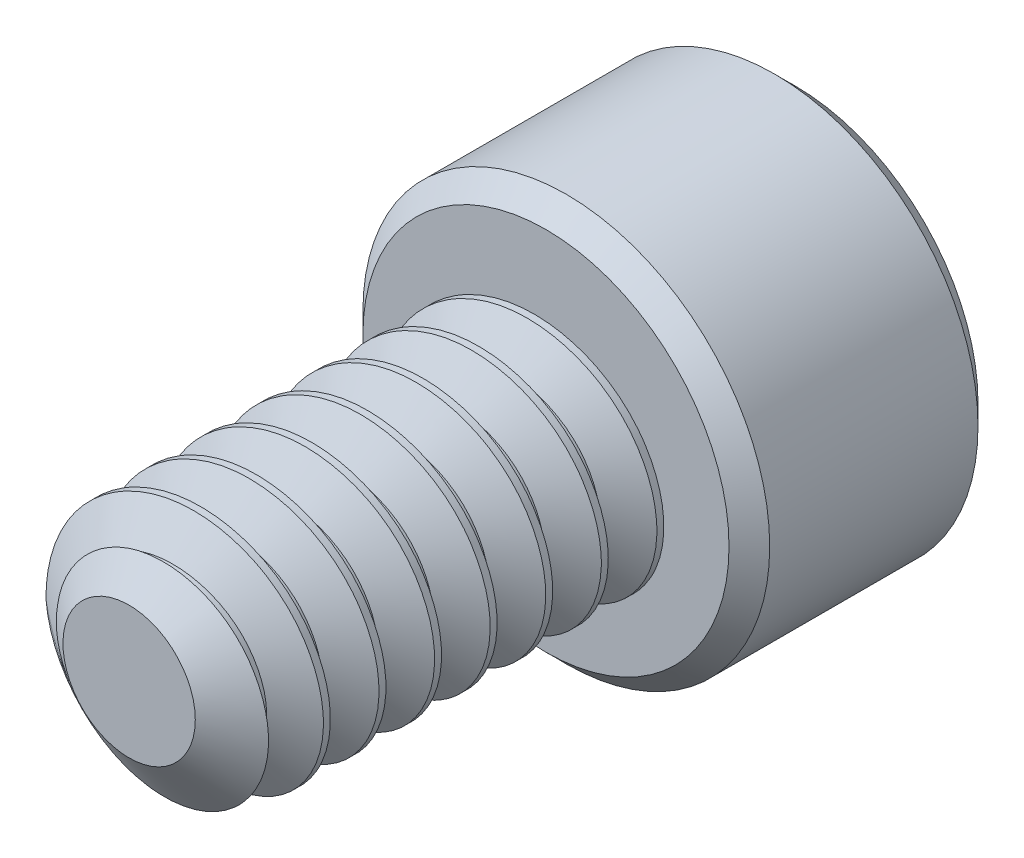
ISO-10303-21;
HEADER;
FILE_DESCRIPTION(('STEP AP214'),'2;1');
FILE_NAME('part.step','',(''),(''),'','','');
FILE_SCHEMA(('AUTOMOTIVE_DESIGN { 1 0 10303 214 1 1 1 1 }'));
ENDSEC;
DATA;
#1=APPLICATION_CONTEXT('core data for automotive mechanical design processes');
#2=APPLICATION_PROTOCOL_DEFINITION('international standard','automotive_design',2000,#1);
#3=PRODUCT_CONTEXT('',#1,'mechanical');
#4=PRODUCT('Part','Part','',(#3));
#5=PRODUCT_RELATED_PRODUCT_CATEGORY('part','',(#4));
#6=PRODUCT_DEFINITION_FORMATION('','',#4);
#7=PRODUCT_DEFINITION_CONTEXT('part definition',#1,'design');
#8=PRODUCT_DEFINITION('design','',#6,#7);
#9=PRODUCT_DEFINITION_SHAPE('','',#8);
#10=(LENGTH_UNIT() NAMED_UNIT(*) SI_UNIT(.MILLI.,.METRE.));
#11=(NAMED_UNIT(*) PLANE_ANGLE_UNIT() SI_UNIT($,.RADIAN.));
#12=(NAMED_UNIT(*) SI_UNIT($,.STERADIAN.) SOLID_ANGLE_UNIT());
#13=UNCERTAINTY_MEASURE_WITH_UNIT(LENGTH_MEASURE(1.E-05),#10,'distance_accuracy_value','');
#14=(GEOMETRIC_REPRESENTATION_CONTEXT(3) GLOBAL_UNCERTAINTY_ASSIGNED_CONTEXT((#13)) GLOBAL_UNIT_ASSIGNED_CONTEXT((#10,
#11,#12)) REPRESENTATION_CONTEXT('',''));
#15=CARTESIAN_POINT('',(0.,0.,0.));
#16=DIRECTION('',(0.,0.,1.));
#17=DIRECTION('',(1.,0.,0.));
#18=AXIS2_PLACEMENT_3D('',#15,#16,#17);
#19=CARTESIAN_POINT('',(-3.5527136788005E-12,0.,-4.76250000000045));
#20=DIRECTION('',(0.,0.,0.999999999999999));
#21=DIRECTION('',(1.,0.,0.));
#22=AXIS2_PLACEMENT_3D('',#19,#20,#21);
#23=CYLINDRICAL_SURFACE('',#22,1.4224);
#24=CARTESIAN_POINT('',(-2.66453525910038E-12,1.42239999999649,1.19062500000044));
#25=CARTESIAN_POINT('',(0.821223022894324,1.42240000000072,1.13770833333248));
#26=CARTESIAN_POINT('',(1.23183453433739,0.711200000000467,1.08479166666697));
#27=CARTESIAN_POINT('',(1.64244604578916,-1.02558009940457E-12,1.0318749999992));
#28=CARTESIAN_POINT('',(1.23183453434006,-0.711200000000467,0.978958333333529));
#29=CARTESIAN_POINT('',(0.821223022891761,-1.4223999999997,0.926041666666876));
#30=CARTESIAN_POINT('',(-3.5527136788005E-12,-1.42239999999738,0.873125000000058));
#31=CARTESIAN_POINT('',(-0.821223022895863,-1.42240000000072,0.820208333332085));
#32=CARTESIAN_POINT('',(-1.23183453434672,-0.711200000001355,0.767291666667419));
#33=CARTESIAN_POINT('',(-1.64244604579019,-1.02558009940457E-12,0.714374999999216));
#34=CARTESIAN_POINT('',(-1.23183453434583,0.711199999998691,0.661458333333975));
#35=CARTESIAN_POINT('',(-0.821223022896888,1.4223999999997,0.608541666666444));
#36=CARTESIAN_POINT('',(-3.99680288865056E-12,1.42239999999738,0.555625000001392));
#37=CARTESIAN_POINT('',(0.821223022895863,1.4223999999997,0.502708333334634));
#38=CARTESIAN_POINT('',(1.23183453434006,0.711199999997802,0.449791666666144));
#39=CARTESIAN_POINT('',(1.64244604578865,-1.02558009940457E-12,0.39687499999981));
#40=CARTESIAN_POINT('',(1.2318345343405,-0.711200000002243,0.343958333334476));
#41=CARTESIAN_POINT('',(0.821223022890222,-1.42240000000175,0.291041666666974));
#42=CARTESIAN_POINT('',(-1.33226762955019E-12,-1.42240000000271,0.238125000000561));
#43=CARTESIAN_POINT('',(-0.821223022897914,-1.42240000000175,0.185208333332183));
#44=CARTESIAN_POINT('',(-1.23183453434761,-0.711200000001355,0.132291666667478));
#45=CARTESIAN_POINT('',(-1.64244604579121,2.05116019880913E-12,0.0793749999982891));
#46=CARTESIAN_POINT('',(-1.23183453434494,0.711200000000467,0.0264583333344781));
#47=CARTESIAN_POINT('',(-0.821223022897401,1.42240000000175,-0.0264583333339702));
#48=CARTESIAN_POINT('',(-2.22044604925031E-12,1.42239999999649,-0.0793750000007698));
#49=CARTESIAN_POINT('',(0.821223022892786,1.4224000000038,-0.132291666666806));
#50=CARTESIAN_POINT('',(1.23183453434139,0.711199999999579,-0.185208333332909));
#51=CARTESIAN_POINT('',(1.64244604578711,-2.05116019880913E-12,-0.238125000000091));
#52=CARTESIAN_POINT('',(1.2318345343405,-0.711200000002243,-0.291041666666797));
#53=CARTESIAN_POINT('',(0.821223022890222,-1.42240000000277,-0.343958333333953));
#54=CARTESIAN_POINT('',(-1.77635683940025E-12,-1.42240000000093,-0.39687499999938));
#55=CARTESIAN_POINT('',(-0.82122302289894,-1.42240000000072,-0.44979166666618));
#56=CARTESIAN_POINT('',(-1.23183453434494,-0.711200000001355,-0.502708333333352));
#57=CARTESIAN_POINT('',(-1.64244604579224,2.05116019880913E-12,-0.555625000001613));
#58=CARTESIAN_POINT('',(-1.2318345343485,0.711199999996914,-0.608541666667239));
#59=CARTESIAN_POINT('',(-0.82122302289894,1.4223999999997,-0.661458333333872));
#60=CARTESIAN_POINT('',(-3.5527136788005E-12,1.42239999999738,-0.714375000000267));
#61=CARTESIAN_POINT('',(0.821223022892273,1.42240000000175,-0.767291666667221));
#62=CARTESIAN_POINT('',(1.23183453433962,0.711200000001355,-0.82020833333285));
#63=CARTESIAN_POINT('',(1.64244604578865,0.,-0.873125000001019));
#64=CARTESIAN_POINT('',(1.23183453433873,-0.711199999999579,-0.926041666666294));
#65=CARTESIAN_POINT('',(0.821223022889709,-1.42240000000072,-0.978958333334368));
#66=CARTESIAN_POINT('',(-4.88498130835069E-12,-1.42240000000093,-1.03187500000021));
#67=CARTESIAN_POINT('',(-0.821223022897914,-1.42240000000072,-1.08479166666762));
#68=CARTESIAN_POINT('',(-1.23183453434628,-0.711200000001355,-1.13770833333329));
#69=CARTESIAN_POINT('',(-1.64244604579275,5.12790049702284E-12,-1.19062499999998));
#70=CARTESIAN_POINT('',(-1.2318345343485,0.711199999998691,-1.24354166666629));
#71=CARTESIAN_POINT('',(-0.82122302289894,1.42240000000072,-1.29645833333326));
#72=CARTESIAN_POINT('',(-5.32907051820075E-12,1.42239999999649,-1.34937499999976));
#73=CARTESIAN_POINT('',(0.821223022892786,1.42240000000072,-1.40229166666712));
#74=CARTESIAN_POINT('',(1.23183453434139,0.711199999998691,-1.45520833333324));
#75=CARTESIAN_POINT('',(1.64244604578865,-2.05116019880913E-12,-1.50812500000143));
#76=CARTESIAN_POINT('',(1.23183453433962,-0.711200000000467,-1.5610416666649));
#77=CARTESIAN_POINT('',(0.821223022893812,-1.42239999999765,-1.61395833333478));
#78=CARTESIAN_POINT('',(-4.44089209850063E-12,-1.42239999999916,-1.66687499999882));
#79=CARTESIAN_POINT('',(-0.821223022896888,-1.4223999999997,-1.71979166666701));
#80=CARTESIAN_POINT('',(-1.23183453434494,-0.711199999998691,-1.77270833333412));
#81=CARTESIAN_POINT('',(-1.64244604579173,3.0767402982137E-12,-1.8256250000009));
#82=CARTESIAN_POINT('',(-1.23183453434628,0.711199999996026,-1.87854166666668));
#83=CARTESIAN_POINT('',(-0.821223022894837,1.42240000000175,-1.93145833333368));
#84=CARTESIAN_POINT('',(-4.44089209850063E-12,1.42239999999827,-1.98437499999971));
#85=CARTESIAN_POINT('',(0.821223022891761,1.42240000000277,-2.03729166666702));
#86=CARTESIAN_POINT('',(1.23183453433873,0.711199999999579,-2.09020833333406));
#87=CARTESIAN_POINT('',(1.64244604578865,0.,-2.14312500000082));
#88=CARTESIAN_POINT('',(1.23183453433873,-0.711200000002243,-2.19604166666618));
#89=CARTESIAN_POINT('',(0.821223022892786,-1.42239999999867,-2.24895833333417));
#90=CARTESIAN_POINT('',(-3.10862446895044E-12,-1.42240000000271,-2.30187499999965));
#91=CARTESIAN_POINT('',(-0.821223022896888,-1.42239999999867,-2.35479166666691));
#92=CARTESIAN_POINT('',(-1.23183453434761,-0.711200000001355,-2.40770833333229));
#93=CARTESIAN_POINT('',(-1.6424460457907,4.10232039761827E-12,-2.46062500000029));
#94=CARTESIAN_POINT('',(-1.23183453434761,0.711199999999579,-2.51354166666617));
#95=CARTESIAN_POINT('',(-0.821223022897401,1.42240000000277,-2.56645833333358));
#96=CARTESIAN_POINT('',(-3.10862446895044E-12,1.42239999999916,-2.61937500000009));
#97=CARTESIAN_POINT('',(0.821223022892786,1.42240000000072,-2.67229166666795));
#98=CARTESIAN_POINT('',(1.23183453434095,0.711200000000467,-2.72520833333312));
#99=CARTESIAN_POINT('',(1.64244604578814,0.,-2.77812500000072));
#100=CARTESIAN_POINT('',(1.2318345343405,-0.711199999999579,-2.83104166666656));
#101=CARTESIAN_POINT('',(0.821223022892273,-1.42240000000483,-2.88395833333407));
#102=CARTESIAN_POINT('',(-1.77635683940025E-12,-1.42240000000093,-2.93687500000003));
#103=CARTESIAN_POINT('',(-0.821223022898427,-1.42240000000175,-2.9897916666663));
#104=CARTESIAN_POINT('',(-1.2318345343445,-0.711199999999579,-3.04270833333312));
#105=CARTESIAN_POINT('',(-1.64244604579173,3.0767402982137E-12,-3.09562500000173));
#106=CARTESIAN_POINT('',(-1.23183453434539,0.71119999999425,-3.148541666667));
#107=CARTESIAN_POINT('',(-0.821223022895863,1.42239999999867,-3.20145833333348));
#108=CARTESIAN_POINT('',(-1.33226762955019E-12,1.42239999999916,-3.25437500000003));
#109=CARTESIAN_POINT('',(0.821223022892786,1.42240000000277,-3.30729166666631));
#110=CARTESIAN_POINT('',(1.2318345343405,0.711200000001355,-3.36020833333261));
#111=CARTESIAN_POINT('',(1.64244604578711,-1.02558009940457E-12,-3.41312500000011));
#112=CARTESIAN_POINT('',(1.23183453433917,-0.711200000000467,-3.46604166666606));
#113=CARTESIAN_POINT('',(0.821223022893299,-1.42239999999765,-3.51895833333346));
#114=CARTESIAN_POINT('',(-2.66453525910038E-12,-1.42240000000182,-3.57187500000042));
#115=CARTESIAN_POINT('',(-0.821223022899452,-1.42239999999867,-3.62479166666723));
#116=CARTESIAN_POINT('',(-1.23183453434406,-0.711200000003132,-3.67770833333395));
#117=CARTESIAN_POINT('',(-1.64244604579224,1.02558009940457E-12,-3.73062500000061));
#118=CARTESIAN_POINT('',(-1.23183453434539,0.711199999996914,-3.78354166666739));
#119=CARTESIAN_POINT('',(-0.82122302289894,1.42240000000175,-3.83645833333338));
#120=CARTESIAN_POINT('',(-3.10862446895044E-12,1.42239999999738,-3.88937499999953));
#121=CARTESIAN_POINT('',(0.821223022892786,1.42240000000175,-3.94229166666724));
#122=CARTESIAN_POINT('',(1.23183453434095,0.711199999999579,-3.995208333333));
#123=CARTESIAN_POINT('',(1.64244604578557,0.,-4.0481249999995));
#124=CARTESIAN_POINT('',(1.23183453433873,-0.711199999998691,-4.10104166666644));
#125=CARTESIAN_POINT('',(0.821223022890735,-1.4223999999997,-4.15395833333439));
#126=CARTESIAN_POINT('',(-3.5527136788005E-12,-1.42239999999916,-4.2068750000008));
#127=CARTESIAN_POINT('',(-0.821223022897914,-1.4224000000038,-4.25979166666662));
#128=CARTESIAN_POINT('',(-1.23183453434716,-0.711200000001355,-4.31270833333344));
#129=CARTESIAN_POINT('',(-1.6424460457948,2.05116019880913E-12,-4.36562500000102));
#130=CARTESIAN_POINT('',(-1.23183453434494,0.711199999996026,-4.41854166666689));
#131=CARTESIAN_POINT('',(-0.82122302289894,1.42240000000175,-4.47145833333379));
#132=CARTESIAN_POINT('',(-4.88498130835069E-12,1.42239999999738,-4.52437499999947));
#133=CARTESIAN_POINT('',(0.821223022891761,1.42240000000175,-4.57729166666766));
#134=CARTESIAN_POINT('',(1.23183453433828,0.711199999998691,-4.63020833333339));
#135=CARTESIAN_POINT('',(1.64244604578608,1.02558009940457E-12,-4.68312500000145));
#136=CARTESIAN_POINT('',(1.23183453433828,-0.711200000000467,-4.73604166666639));
#137=CARTESIAN_POINT('',(0.821223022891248,-1.42239999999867,-4.78895833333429));
#138=CARTESIAN_POINT('',(-4.88498130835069E-12,-1.42239999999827,-4.8418750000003));
#139=CARTESIAN_POINT('',(-0.821223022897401,-1.42240000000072,-4.89479166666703));
#140=CARTESIAN_POINT('',(-1.23183453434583,-0.711200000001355,-4.94770833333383));
#141=CARTESIAN_POINT('',(-1.6424460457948,-1.02558009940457E-12,-5.00062500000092));
#142=CARTESIAN_POINT('',(-1.23183453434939,0.711199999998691,-5.0535416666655));
#143=CARTESIAN_POINT('',(-0.821223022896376,1.42240000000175,-5.1064583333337));
#144=CARTESIAN_POINT('',(-3.10862446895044E-12,1.42239999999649,-5.15937499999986));
#145=(BOUNDED_CURVE() B_SPLINE_CURVE(2,(#24,#25,#26,#27,#28,#29,#30,#31,#32,#33,#34,#35,#36,#37,
#38,#39,#40,#41,#42,#43,#44,#45,#46,#47,#48,#49,#50,#51,#52,#53,#54,#55,#56,#57,#58,#59,#60,#61,
#62,#63,#64,#65,#66,#67,#68,#69,#70,#71,#72,#73,#74,#75,#76,#77,#78,#79,#80,#81,#82,#83,#84,#85,
#86,#87,#88,#89,#90,#91,#92,#93,#94,#95,#96,#97,#98,#99,#100,#101,#102,#103,#104,#105,#106,#107,
#108,#109,#110,#111,#112,#113,#114,#115,#116,#117,#118,#119,#120,#121,#122,#123,#124,#125,#126,
#127,#128,#129,#130,#131,#132,#133,#134,#135,#136,#137,#138,#139,#140,#141,#142,#143,#144),
.UNSPECIFIED.,.F.,.F.) B_SPLINE_CURVE_WITH_KNOTS((3,2,2,2,2,2,2,2,2,2,2,2,2,2,2,2,2,2,2,2,2,2,2,
2,2,2,2,2,2,2,2,2,2,2,2,2,2,2,2,2,2,2,2,2,2,2,2,2,2,2,2,2,2,2,2,2,2,2,2,2,3),(0.,
0.0166666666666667,0.0333333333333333,0.05,0.0666666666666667,0.0833333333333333,0.1,
0.116666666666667,0.133333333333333,0.15,0.166666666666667,0.183333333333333,0.2,
0.216666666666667,0.233333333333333,0.25,0.266666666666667,0.283333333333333,0.3,
0.316666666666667,0.333333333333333,0.35,0.366666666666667,0.383333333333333,0.4,
0.416666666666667,0.433333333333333,0.45,0.466666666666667,0.483333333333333,0.5,
0.516666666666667,0.533333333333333,0.55,0.566666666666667,0.583333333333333,0.6,
0.616666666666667,0.633333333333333,0.65,0.666666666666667,0.683333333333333,0.7,
0.716666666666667,0.733333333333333,0.75,0.766666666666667,0.783333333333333,0.8,
0.816666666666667,0.833333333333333,0.85,0.866666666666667,0.883333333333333,0.9,
0.916666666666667,0.933333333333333,0.95,0.966666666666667,0.983333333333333,1.),
.UNSPECIFIED.) CURVE() GEOMETRIC_REPRESENTATION_ITEM() RATIONAL_B_SPLINE_CURVE((1.,
0.866025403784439,1.,0.866025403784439,1.,0.866025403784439,1.,0.866025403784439,1.,
0.866025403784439,1.,0.866025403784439,1.,0.866025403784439,1.,0.866025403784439,1.,
0.866025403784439,1.,0.866025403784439,1.,0.866025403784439,1.,0.866025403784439,1.,
0.866025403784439,1.,0.866025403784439,1.,0.866025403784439,1.,0.866025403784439,1.,
0.866025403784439,1.,0.866025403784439,1.,0.866025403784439,1.,0.866025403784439,1.,
0.866025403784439,1.,0.866025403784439,1.,0.866025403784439,1.,0.866025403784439,1.,
0.866025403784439,1.,0.866025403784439,1.,0.866025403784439,1.,0.866025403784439,1.,
0.866025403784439,1.,0.866025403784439,1.,0.866025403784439,1.,0.866025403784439,1.,
0.866025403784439,1.,0.866025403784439,1.,0.866025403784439,1.,0.866025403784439,1.,
0.866025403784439,1.,0.866025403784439,1.,0.866025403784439,1.,0.866025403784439,1.,
0.866025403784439,1.,0.866025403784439,1.,0.866025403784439,1.,0.866025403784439,1.,
0.866025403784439,1.,0.866025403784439,1.,0.866025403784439,1.,0.866025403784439,1.,
0.866025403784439,1.,0.866025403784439,1.,0.866025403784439,1.,0.866025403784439,1.,
0.866025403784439,1.,0.866025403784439,1.,0.866025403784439,1.,0.866025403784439,1.,
0.866025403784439,1.,0.866025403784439,1.,0.866025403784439,1.,0.866025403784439,1.)) REPRESENTATION_ITEM(''));
#146=CARTESIAN_POINT('',(-0.898334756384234,-1.1028220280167,-0.466649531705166));
#147=VERTEX_POINT('',#146);
#148=CARTESIAN_POINT('',(0.996575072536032,-1.01491865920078,-4.7625));
#149=VERTEX_POINT('',#148);
#150=EDGE_CURVE('E283',#147,#149,#145,.T.);
#151=ORIENTED_EDGE('',*,*,#150,.F.);
#152=CARTESIAN_POINT('',(-2.22044604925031E-12,-8.88178419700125E-13,-0.466649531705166));
#153=DIRECTION('',(0.,0.,0.999999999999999));
#154=DIRECTION('',(1.,0.,0.));
#155=AXIS2_PLACEMENT_3D('',#152,#153,#154);
#156=CIRCLE('',#155,1.4224);
#157=CARTESIAN_POINT('',(-1.4165355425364,-0.129030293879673,-0.46664953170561));
#158=VERTEX_POINT('',#157);
#159=EDGE_CURVE('E276',#158,#147,#156,.T.);
#160=ORIENTED_EDGE('',*,*,#159,.F.);
#161=CARTESIAN_POINT('',(-3.99680288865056E-12,1.42239999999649,0.635000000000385));
#162=CARTESIAN_POINT('',(0.821223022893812,1.4223999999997,0.582083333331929));
#163=CARTESIAN_POINT('',(1.23183453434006,0.711200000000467,0.529166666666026));
#164=CARTESIAN_POINT('',(1.64244604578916,-5.12790049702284E-12,0.47624999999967));
#165=CARTESIAN_POINT('',(1.2318345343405,-0.711200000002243,0.423333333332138));
#166=CARTESIAN_POINT('',(0.821223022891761,-1.42240000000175,0.370416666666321));
#167=CARTESIAN_POINT('',(-2.22044604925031E-12,-1.42240000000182,0.317500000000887));
#168=CARTESIAN_POINT('',(-0.821223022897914,-1.42240000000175,0.264583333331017));
#169=CARTESIAN_POINT('',(-1.2318345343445,-0.711199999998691,0.211666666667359));
#170=CARTESIAN_POINT('',(-1.64244604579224,0.,0.1587500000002));
#171=CARTESIAN_POINT('',(-1.23183453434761,0.711199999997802,0.10583333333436));
#172=CARTESIAN_POINT('',(-0.821223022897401,1.42239999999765,0.0529166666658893));
#173=CARTESIAN_POINT('',(-3.99680288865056E-12,1.42239999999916,-4.44089209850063E-13));
#174=CARTESIAN_POINT('',(0.821223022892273,1.4224000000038,-0.0529166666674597));
#175=CARTESIAN_POINT('',(1.2318345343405,0.711200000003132,-0.105833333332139));
#176=CARTESIAN_POINT('',(1.64244604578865,-1.02558009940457E-12,-0.158749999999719));
#177=CARTESIAN_POINT('',(1.23183453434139,-0.711199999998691,-0.211666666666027));
#178=CARTESIAN_POINT('',(0.821223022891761,-1.42240000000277,-0.264583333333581));
#179=CARTESIAN_POINT('',(-1.33226762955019E-12,-1.42240000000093,-0.317499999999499));
#180=CARTESIAN_POINT('',(-0.82122302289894,-1.42240000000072,-0.370416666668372));
#181=CARTESIAN_POINT('',(-1.23183453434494,-0.711200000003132,-0.42333333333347));
#182=CARTESIAN_POINT('',(-1.64244604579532,-1.02558009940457E-12,-0.476250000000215));
#183=CARTESIAN_POINT('',(-1.23183453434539,0.711199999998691,-0.529166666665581));
#184=CARTESIAN_POINT('',(-0.821223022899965,1.42239999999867,-0.582083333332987));
#185=CARTESIAN_POINT('',(-3.10862446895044E-12,1.42239999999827,-0.634999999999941));
#186=CARTESIAN_POINT('',(0.821223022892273,1.42240000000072,-0.687916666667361));
#187=CARTESIAN_POINT('',(1.23183453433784,0.711199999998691,-0.740833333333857));
#188=CARTESIAN_POINT('',(1.64244604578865,0.,-0.793750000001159));
#189=CARTESIAN_POINT('',(1.2318345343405,-0.711199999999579,-0.846666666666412));
#190=CARTESIAN_POINT('',(0.821223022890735,-1.42240000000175,-0.899583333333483));
#191=CARTESIAN_POINT('',(-2.66453525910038E-12,-1.42240000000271,-0.952500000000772));
#192=CARTESIAN_POINT('',(-0.821223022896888,-1.4223999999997,-1.00541666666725));
#193=CARTESIAN_POINT('',(-1.23183453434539,-0.711200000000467,-1.05833333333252));
#194=CARTESIAN_POINT('',(-1.64244604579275,2.05116019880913E-12,-1.11125000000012));
#195=CARTESIAN_POINT('',(-1.2318345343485,0.711199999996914,-1.16416666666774));
#196=CARTESIAN_POINT('',(-0.821223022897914,1.42239999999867,-1.21708333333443));
#197=CARTESIAN_POINT('',(-2.22044604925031E-12,1.42239999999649,-1.27000000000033));
#198=CARTESIAN_POINT('',(0.821223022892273,1.42240000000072,-1.3229166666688));
#199=CARTESIAN_POINT('',(1.23183453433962,0.711200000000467,-1.37583333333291));
#200=CARTESIAN_POINT('',(1.64244604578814,-1.02558009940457E-12,-1.42875000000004));
#201=CARTESIAN_POINT('',(1.2318345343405,-0.711199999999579,-1.48166666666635));
#202=CARTESIAN_POINT('',(0.821223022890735,-1.42240000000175,-1.53458333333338));
#203=CARTESIAN_POINT('',(-2.66453525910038E-12,-1.42240000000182,-1.58750000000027));
#204=CARTESIAN_POINT('',(-0.821223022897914,-1.42240000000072,-1.64041666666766));
#205=CARTESIAN_POINT('',(-1.23183453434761,-0.711200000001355,-1.69333333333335));
#206=CARTESIAN_POINT('',(-1.6424460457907,4.10232039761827E-12,-1.74625000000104));
#207=CARTESIAN_POINT('',(-1.23183453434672,0.711199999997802,-1.7991666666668));
#208=CARTESIAN_POINT('',(-0.82122302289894,1.4223999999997,-1.8520833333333));
#209=CARTESIAN_POINT('',(-2.66453525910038E-12,1.42240000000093,-1.90500000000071));
#210=CARTESIAN_POINT('',(0.821223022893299,1.42240000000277,-1.95791666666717));
#211=CARTESIAN_POINT('',(1.2318345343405,0.711199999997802,-2.01083333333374));
#212=CARTESIAN_POINT('',(1.6424460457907,-2.05116019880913E-12,-2.06375000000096));
#213=CARTESIAN_POINT('',(1.2318345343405,-0.711200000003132,-2.11666666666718));
#214=CARTESIAN_POINT('',(0.821223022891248,-1.42240000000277,-2.16958333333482));
#215=CARTESIAN_POINT('',(-3.10862446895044E-12,-1.42240000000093,-2.22249999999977));
#216=CARTESIAN_POINT('',(-0.821223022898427,-1.42240000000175,-2.27541666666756));
#217=CARTESIAN_POINT('',(-1.23183453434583,-0.711200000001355,-2.32833333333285));
#218=CARTESIAN_POINT('',(-1.64244604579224,3.0767402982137E-12,-2.38124999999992));
#219=CARTESIAN_POINT('',(-1.23183453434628,0.711199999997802,-2.43416666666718));
#220=CARTESIAN_POINT('',(-0.821223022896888,1.42240000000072,-2.48708333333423));
#221=CARTESIAN_POINT('',(-3.99680288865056E-12,1.42239999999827,-2.53999999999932));
#222=CARTESIAN_POINT('',(0.821223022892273,1.4223999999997,-2.59291666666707));
#223=CARTESIAN_POINT('',(1.23183453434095,0.711199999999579,-2.64583333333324));
#224=CARTESIAN_POINT('',(1.64244604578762,-1.02558009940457E-12,-2.69874999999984));
#225=CARTESIAN_POINT('',(1.23183453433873,-0.711199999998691,-2.75166666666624));
#226=CARTESIAN_POINT('',(0.82122302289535,-1.42239999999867,-2.80458333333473));
#227=CARTESIAN_POINT('',(-3.10862446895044E-12,-1.42239999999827,-2.85749999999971));
#228=CARTESIAN_POINT('',(-0.821223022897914,-1.42240000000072,-2.91041666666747));
#229=CARTESIAN_POINT('',(-1.23183453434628,-0.711199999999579,-2.96333333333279));
#230=CARTESIAN_POINT('',(-1.64244604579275,1.02558009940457E-12,-3.01624999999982));
#231=CARTESIAN_POINT('',(-1.23183453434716,0.711199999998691,-3.06916666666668));
#232=CARTESIAN_POINT('',(-0.821223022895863,1.42240000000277,-3.12208333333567));
#233=CARTESIAN_POINT('',(-3.10862446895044E-12,1.42239999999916,-3.17499999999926));
#234=CARTESIAN_POINT('',(0.821223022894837,1.42240000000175,-3.22791666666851));
#235=CARTESIAN_POINT('',(1.23183453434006,0.711199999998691,-3.28083333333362));
#236=CARTESIAN_POINT('',(1.64244604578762,3.0767402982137E-12,-3.33374999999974));
#237=CARTESIAN_POINT('',(1.2318345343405,-0.711199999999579,-3.38666666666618));
#238=CARTESIAN_POINT('',(0.821223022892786,-1.42240000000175,-3.43958333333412));
#239=CARTESIAN_POINT('',(-3.10862446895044E-12,-1.42240000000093,-3.49249999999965));
#240=CARTESIAN_POINT('',(-0.821223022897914,-1.42240000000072,-3.54541666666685));
#241=CARTESIAN_POINT('',(-1.23183453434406,-0.711199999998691,-3.59833333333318));
#242=CARTESIAN_POINT('',(-1.64244604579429,2.05116019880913E-12,-3.65125000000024));
#243=CARTESIAN_POINT('',(-1.23183453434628,0.711199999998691,-3.70416666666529));
#244=CARTESIAN_POINT('',(-0.821223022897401,1.4223999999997,-3.75708333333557));
#245=CARTESIAN_POINT('',(-2.22044604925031E-12,1.42240000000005,-3.80999999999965));
#246=CARTESIAN_POINT('',(0.821223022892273,1.42240000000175,-3.86291666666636));
#247=CARTESIAN_POINT('',(1.23183453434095,0.711199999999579,-3.91583333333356));
#248=CARTESIAN_POINT('',(1.64244604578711,2.05116019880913E-12,-3.96875000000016));
#249=CARTESIAN_POINT('',(1.23183453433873,-0.711200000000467,-4.02166666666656));
#250=CARTESIAN_POINT('',(0.821223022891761,-1.4223999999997,-4.07458333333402));
#251=CARTESIAN_POINT('',(-3.10862446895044E-12,-1.42240000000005,-4.12749999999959));
#252=CARTESIAN_POINT('',(-0.821223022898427,-1.42240000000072,-4.18041666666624));
#253=CARTESIAN_POINT('',(-1.23183453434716,-0.711200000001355,-4.23333333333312));
#254=CARTESIAN_POINT('',(-1.64244604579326,1.02558009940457E-12,-4.28625000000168));
#255=CARTESIAN_POINT('',(-1.23183453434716,0.711199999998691,-4.33916666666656));
#256=CARTESIAN_POINT('',(-0.821223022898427,1.4223999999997,-4.39208333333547));
#257=CARTESIAN_POINT('',(-4.88498130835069E-12,1.42240000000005,-4.44500000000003));
#258=CARTESIAN_POINT('',(0.821223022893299,1.42240000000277,-4.49791666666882));
#259=CARTESIAN_POINT('',(1.23183453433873,0.711200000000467,-4.55083333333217));
#260=CARTESIAN_POINT('',(1.64244604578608,-1.02558009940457E-12,-4.60374999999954));
#261=CARTESIAN_POINT('',(1.23183453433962,-0.711199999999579,-4.65666666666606));
#262=CARTESIAN_POINT('',(0.821223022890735,-1.42239999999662,-4.70958333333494));
#263=CARTESIAN_POINT('',(-3.10862446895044E-12,-1.42239999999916,-4.76250000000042));
#264=CARTESIAN_POINT('',(-0.821223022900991,-1.42240000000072,-4.81541666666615));
#265=CARTESIAN_POINT('',(-1.23183453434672,-0.711200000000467,-4.86833333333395));
#266=CARTESIAN_POINT('',(-1.64244604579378,5.12790049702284E-12,-4.92125000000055));
#267=CARTESIAN_POINT('',(-1.23183453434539,0.711200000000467,-4.97416666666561));
#268=CARTESIAN_POINT('',(-0.821223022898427,1.42240000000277,-5.02708333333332));
#269=CARTESIAN_POINT('',(-4.88498130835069E-12,1.42239999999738,-5.08000000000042));
#270=CARTESIAN_POINT('',(0.821223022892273,1.42239999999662,-5.13291666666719));
#271=CARTESIAN_POINT('',(1.23183453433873,0.711199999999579,-5.185833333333));
#272=CARTESIAN_POINT('',(1.64244604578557,0.,-5.23875000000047));
#273=CARTESIAN_POINT('',(1.23183453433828,-0.711200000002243,-5.291666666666));
#274=CARTESIAN_POINT('',(0.821223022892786,-1.42240000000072,-5.34458333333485));
#275=CARTESIAN_POINT('',(-3.99680288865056E-12,-1.42239999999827,-5.39749999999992));
#276=CARTESIAN_POINT('',(-0.821223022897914,-1.4223999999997,-5.45041666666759));
#277=CARTESIAN_POINT('',(-1.23183453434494,-0.711200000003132,-5.50333333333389));
#278=CARTESIAN_POINT('',(-1.64244604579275,1.02558009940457E-12,-5.55624999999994));
#279=CARTESIAN_POINT('',(-1.23183453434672,0.711199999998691,-5.60916666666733));
#280=CARTESIAN_POINT('',(-0.821223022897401,1.4223999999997,-5.66208333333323));
#281=CARTESIAN_POINT('',(-2.22044604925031E-12,1.42239999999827,-5.71499999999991));
#282=(BOUNDED_CURVE() B_SPLINE_CURVE(2,(#161,#162,#163,#164,#165,#166,#167,#168,#169,#170,#171,
#172,#173,#174,#175,#176,#177,#178,#179,#180,#181,#182,#183,#184,#185,#186,#187,#188,#189,#190,
#191,#192,#193,#194,#195,#196,#197,#198,#199,#200,#201,#202,#203,#204,#205,#206,#207,#208,#209,
#210,#211,#212,#213,#214,#215,#216,#217,#218,#219,#220,#221,#222,#223,#224,#225,#226,#227,#228,
#229,#230,#231,#232,#233,#234,#235,#236,#237,#238,#239,#240,#241,#242,#243,#244,#245,#246,#247,
#248,#249,#250,#251,#252,#253,#254,#255,#256,#257,#258,#259,#260,#261,#262,#263,#264,#265,#266,
#267,#268,#269,#270,#271,#272,#273,#274,#275,#276,#277,#278,#279,#280,#281),.UNSPECIFIED.,.F.,
.F.) B_SPLINE_CURVE_WITH_KNOTS((3,2,2,2,2,2,2,2,2,2,2,2,2,2,2,2,2,2,2,2,2,2,2,2,2,2,2,2,2,2,2,2,
2,2,2,2,2,2,2,2,2,2,2,2,2,2,2,2,2,2,2,2,2,2,2,2,2,2,2,2,3),(0.,0.0166666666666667,
0.0333333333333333,0.05,0.0666666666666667,0.0833333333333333,0.1,0.116666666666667,
0.133333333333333,0.15,0.166666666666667,0.183333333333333,0.2,0.216666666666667,
0.233333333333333,0.25,0.266666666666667,0.283333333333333,0.3,0.316666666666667,
0.333333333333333,0.35,0.366666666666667,0.383333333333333,0.4,0.416666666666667,
0.433333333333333,0.45,0.466666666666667,0.483333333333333,0.5,0.516666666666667,
0.533333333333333,0.55,0.566666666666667,0.583333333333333,0.6,0.616666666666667,
0.633333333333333,0.65,0.666666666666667,0.683333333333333,0.7,0.716666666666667,
0.733333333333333,0.75,0.766666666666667,0.783333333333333,0.8,0.816666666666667,
0.833333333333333,0.85,0.866666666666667,0.883333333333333,0.9,0.916666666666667,
0.933333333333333,0.95,0.966666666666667,0.983333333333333,1.),
.UNSPECIFIED.) CURVE() GEOMETRIC_REPRESENTATION_ITEM() RATIONAL_B_SPLINE_CURVE((1.,
0.866025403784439,1.,0.866025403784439,1.,0.866025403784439,1.,0.866025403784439,1.,
0.866025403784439,1.,0.866025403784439,1.,0.866025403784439,1.,0.866025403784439,1.,
0.866025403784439,1.,0.866025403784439,1.,0.866025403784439,1.,0.866025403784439,1.,
0.866025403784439,1.,0.866025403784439,1.,0.866025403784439,1.,0.866025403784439,1.,
0.866025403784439,1.,0.866025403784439,1.,0.866025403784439,1.,0.866025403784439,1.,
0.866025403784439,1.,0.866025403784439,1.,0.866025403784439,1.,0.866025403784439,1.,
0.866025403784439,1.,0.866025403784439,1.,0.866025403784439,1.,0.866025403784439,1.,
0.866025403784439,1.,0.866025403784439,1.,0.866025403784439,1.,0.866025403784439,1.,
0.866025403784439,1.,0.866025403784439,1.,0.866025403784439,1.,0.866025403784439,1.,
0.866025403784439,1.,0.866025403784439,1.,0.866025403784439,1.,0.866025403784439,1.,
0.866025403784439,1.,0.866025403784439,1.,0.866025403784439,1.,0.866025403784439,1.,
0.866025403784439,1.,0.866025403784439,1.,0.866025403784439,1.,0.866025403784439,1.,
0.866025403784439,1.,0.866025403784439,1.,0.866025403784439,1.,0.866025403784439,1.,
0.866025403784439,1.,0.866025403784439,1.,0.866025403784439,1.,0.866025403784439,1.,
0.866025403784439,1.,0.866025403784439,1.,0.866025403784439,1.,0.866025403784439,1.)) REPRESENTATION_ITEM(''));
#283=CARTESIAN_POINT('',(-3.10862446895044E-12,-1.42239999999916,-4.76250000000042));
#284=VERTEX_POINT('',#283);
#285=EDGE_CURVE('E275',#158,#284,#282,.T.);
#286=ORIENTED_EDGE('',*,*,#285,.T.);
#287=CARTESIAN_POINT('',(-3.5527136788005E-12,0.,-4.76250000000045));
#288=DIRECTION('',(0.,0.,0.999999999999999));
#289=DIRECTION('',(1.,0.,0.));
#290=AXIS2_PLACEMENT_3D('',#287,#288,#289);
#291=CIRCLE('',#290,1.4224);
#292=EDGE_CURVE('E256',#284,#149,#291,.T.);
#293=ORIENTED_EDGE('',*,*,#292,.T.);
#294=EDGE_LOOP('',(#151,#160,#286,#293));
#295=FACE_BOUND('',#294,.T.);
#296=ADVANCED_FACE('F36',(#295),#23,.T.);
#297=CARTESIAN_POINT('',(-2.66453525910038E-12,1.42239999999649,1.19062500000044));
#298=CARTESIAN_POINT('',(0.821223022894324,1.42240000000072,1.13770833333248));
#299=CARTESIAN_POINT('',(1.23183453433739,0.711200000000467,1.08479166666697));
#300=CARTESIAN_POINT('',(1.64244604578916,-1.02558009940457E-12,1.0318749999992));
#301=CARTESIAN_POINT('',(1.23183453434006,-0.711200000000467,0.978958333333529));
#302=CARTESIAN_POINT('',(0.821223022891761,-1.4223999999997,0.926041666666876));
#303=CARTESIAN_POINT('',(-3.5527136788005E-12,-1.42239999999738,0.873125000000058));
#304=CARTESIAN_POINT('',(-0.821223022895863,-1.42240000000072,0.820208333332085));
#305=CARTESIAN_POINT('',(-1.23183453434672,-0.711200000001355,0.767291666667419));
#306=CARTESIAN_POINT('',(-1.64244604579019,-1.02558009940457E-12,0.714374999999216));
#307=CARTESIAN_POINT('',(-1.23183453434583,0.711199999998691,0.661458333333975));
#308=CARTESIAN_POINT('',(-0.821223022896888,1.4223999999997,0.608541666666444));
#309=CARTESIAN_POINT('',(-3.99680288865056E-12,1.42239999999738,0.555625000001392));
#310=CARTESIAN_POINT('',(0.821223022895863,1.4223999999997,0.502708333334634));
#311=CARTESIAN_POINT('',(1.23183453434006,0.711199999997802,0.449791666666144));
#312=CARTESIAN_POINT('',(1.64244604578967,-3.0767402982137E-12,0.396874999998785));
#313=CARTESIAN_POINT('',(1.23183453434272,-0.711199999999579,0.343958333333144));
#314=CARTESIAN_POINT('',(0.821223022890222,-1.42240000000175,0.291041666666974));
#315=CARTESIAN_POINT('',(-1.33226762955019E-12,-1.42240000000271,0.238125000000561));
#316=CARTESIAN_POINT('',(-0.821223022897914,-1.42240000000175,0.185208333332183));
#317=CARTESIAN_POINT('',(-1.23183453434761,-0.711200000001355,0.132291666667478));
#318=CARTESIAN_POINT('',(-1.64244604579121,2.05116019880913E-12,0.0793749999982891));
#319=CARTESIAN_POINT('',(-1.23183453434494,0.711200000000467,0.0264583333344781));
#320=CARTESIAN_POINT('',(-0.821223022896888,1.4223999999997,-0.026458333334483));
#321=CARTESIAN_POINT('',(-2.22044604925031E-12,1.42239999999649,-0.0793750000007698));
#322=CARTESIAN_POINT('',(0.821223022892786,1.4224000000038,-0.132291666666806));
#323=CARTESIAN_POINT('',(1.23183453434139,0.711199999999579,-0.185208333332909));
#324=CARTESIAN_POINT('',(1.64244604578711,-2.05116019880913E-12,-0.238125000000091));
#325=CARTESIAN_POINT('',(1.2318345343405,-0.711200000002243,-0.291041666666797));
#326=CARTESIAN_POINT('',(0.821223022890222,-1.42240000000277,-0.343958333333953));
#327=CARTESIAN_POINT('',(-1.77635683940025E-12,-1.42240000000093,-0.39687499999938));
#328=CARTESIAN_POINT('',(-0.82122302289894,-1.42240000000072,-0.44979166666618));
#329=CARTESIAN_POINT('',(-1.23183453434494,-0.711200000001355,-0.502708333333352));
#330=CARTESIAN_POINT('',(-1.64244604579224,2.05116019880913E-12,-0.555625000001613));
#331=CARTESIAN_POINT('',(-1.2318345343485,0.711199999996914,-0.608541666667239));
#332=CARTESIAN_POINT('',(-0.82122302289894,1.4223999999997,-0.661458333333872));
#333=CARTESIAN_POINT('',(-3.5527136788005E-12,1.42239999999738,-0.714375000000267));
#334=CARTESIAN_POINT('',(0.821223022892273,1.42240000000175,-0.767291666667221));
#335=CARTESIAN_POINT('',(1.23183453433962,0.711200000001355,-0.82020833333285));
#336=CARTESIAN_POINT('',(1.64244604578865,0.,-0.873125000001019));
#337=CARTESIAN_POINT('',(1.23183453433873,-0.711199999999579,-0.926041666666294));
#338=CARTESIAN_POINT('',(0.821223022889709,-1.42240000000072,-0.978958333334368));
#339=CARTESIAN_POINT('',(-4.88498130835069E-12,-1.42240000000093,-1.03187500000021));
#340=CARTESIAN_POINT('',(-0.821223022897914,-1.42240000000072,-1.08479166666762));
#341=CARTESIAN_POINT('',(-1.23183453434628,-0.711200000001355,-1.13770833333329));
#342=CARTESIAN_POINT('',(-1.64244604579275,5.12790049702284E-12,-1.19062499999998));
#343=CARTESIAN_POINT('',(-1.2318345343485,0.711199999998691,-1.24354166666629));
#344=CARTESIAN_POINT('',(-0.821223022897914,1.42239999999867,-1.29645833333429));
#345=CARTESIAN_POINT('',(-3.10862446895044E-12,1.42239999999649,-1.34937499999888));
#346=CARTESIAN_POINT('',(0.821223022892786,1.42240000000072,-1.40229166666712));
#347=CARTESIAN_POINT('',(1.23183453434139,0.711199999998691,-1.45520833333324));
#348=CARTESIAN_POINT('',(1.64244604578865,-2.05116019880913E-12,-1.50812500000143));
#349=CARTESIAN_POINT('',(1.23183453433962,-0.711200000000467,-1.5610416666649));
#350=CARTESIAN_POINT('',(0.821223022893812,-1.42239999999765,-1.61395833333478));
#351=CARTESIAN_POINT('',(-4.44089209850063E-12,-1.42239999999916,-1.66687499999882));
#352=CARTESIAN_POINT('',(-0.821223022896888,-1.4223999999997,-1.71979166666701));
#353=CARTESIAN_POINT('',(-1.23183453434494,-0.711199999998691,-1.77270833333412));
#354=CARTESIAN_POINT('',(-1.64244604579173,3.0767402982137E-12,-1.8256250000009));
#355=CARTESIAN_POINT('',(-1.23183453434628,0.711199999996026,-1.87854166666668));
#356=CARTESIAN_POINT('',(-0.821223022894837,1.42240000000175,-1.93145833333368));
#357=CARTESIAN_POINT('',(-4.44089209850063E-12,1.42239999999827,-1.98437499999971));
#358=CARTESIAN_POINT('',(0.821223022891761,1.42240000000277,-2.03729166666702));
#359=CARTESIAN_POINT('',(1.23183453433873,0.711199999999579,-2.09020833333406));
#360=CARTESIAN_POINT('',(1.64244604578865,0.,-2.14312500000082));
#361=CARTESIAN_POINT('',(1.23183453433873,-0.711200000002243,-2.19604166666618));
#362=CARTESIAN_POINT('',(0.821223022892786,-1.42239999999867,-2.24895833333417));
#363=CARTESIAN_POINT('',(-3.10862446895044E-12,-1.42240000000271,-2.30187499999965));
#364=CARTESIAN_POINT('',(-0.821223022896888,-1.42239999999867,-2.35479166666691));
#365=CARTESIAN_POINT('',(-1.23183453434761,-0.711200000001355,-2.40770833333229));
#366=CARTESIAN_POINT('',(-1.6424460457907,4.10232039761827E-12,-2.46062500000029));
#367=CARTESIAN_POINT('',(-1.2318345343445,0.711200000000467,-2.51354166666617));
#368=CARTESIAN_POINT('',(-0.821223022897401,1.42240000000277,-2.56645833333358));
#369=CARTESIAN_POINT('',(-3.10862446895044E-12,1.42239999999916,-2.61937500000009));
#370=CARTESIAN_POINT('',(0.821223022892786,1.42240000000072,-2.67229166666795));
#371=CARTESIAN_POINT('',(1.23183453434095,0.711200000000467,-2.72520833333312));
#372=CARTESIAN_POINT('',(1.64244604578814,0.,-2.77812500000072));
#373=CARTESIAN_POINT('',(1.2318345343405,-0.711199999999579,-2.83104166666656));
#374=CARTESIAN_POINT('',(0.821223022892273,-1.42240000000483,-2.88395833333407));
#375=CARTESIAN_POINT('',(-1.77635683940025E-12,-1.42240000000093,-2.93687500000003));
#376=CARTESIAN_POINT('',(-0.821223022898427,-1.42240000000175,-2.9897916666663));
#377=CARTESIAN_POINT('',(-1.2318345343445,-0.711199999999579,-3.04270833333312));
#378=CARTESIAN_POINT('',(-1.64244604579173,3.0767402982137E-12,-3.09562500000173));
#379=CARTESIAN_POINT('',(-1.23183453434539,0.71119999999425,-3.148541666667));
#380=CARTESIAN_POINT('',(-0.821223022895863,1.42239999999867,-3.20145833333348));
#381=CARTESIAN_POINT('',(-1.33226762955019E-12,1.42239999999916,-3.25437500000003));
#382=CARTESIAN_POINT('',(0.821223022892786,1.42240000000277,-3.30729166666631));
#383=CARTESIAN_POINT('',(1.2318345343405,0.711200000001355,-3.36020833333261));
#384=CARTESIAN_POINT('',(1.64244604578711,-1.02558009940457E-12,-3.41312500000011));
#385=CARTESIAN_POINT('',(1.23183453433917,-0.711200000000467,-3.46604166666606));
#386=CARTESIAN_POINT('',(0.821223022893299,-1.42239999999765,-3.51895833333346));
#387=CARTESIAN_POINT('',(-2.66453525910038E-12,-1.42240000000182,-3.57187500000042));
#388=CARTESIAN_POINT('',(-0.821223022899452,-1.42239999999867,-3.62479166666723));
#389=CARTESIAN_POINT('',(-1.23183453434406,-0.711200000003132,-3.67770833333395));
#390=CARTESIAN_POINT('',(-1.64244604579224,1.02558009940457E-12,-3.73062500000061));
#391=CARTESIAN_POINT('',(-1.23183453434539,0.711199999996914,-3.78354166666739));
#392=CARTESIAN_POINT('',(-0.82122302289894,1.42240000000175,-3.83645833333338));
#393=CARTESIAN_POINT('',(-3.10862446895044E-12,1.42239999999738,-3.88937499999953));
#394=CARTESIAN_POINT('',(0.821223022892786,1.42240000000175,-3.94229166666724));
#395=CARTESIAN_POINT('',(1.23183453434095,0.711199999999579,-3.995208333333));
#396=CARTESIAN_POINT('',(1.64244604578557,0.,-4.0481249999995));
#397=CARTESIAN_POINT('',(1.23183453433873,-0.711199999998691,-4.10104166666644));
#398=CARTESIAN_POINT('',(0.821223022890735,-1.42240000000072,-4.15395833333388));
#399=CARTESIAN_POINT('',(-3.5527136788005E-12,-1.42239999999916,-4.2068750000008));
#400=CARTESIAN_POINT('',(-0.821223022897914,-1.4224000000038,-4.25979166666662));
#401=CARTESIAN_POINT('',(-1.23183453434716,-0.711200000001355,-4.31270833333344));
#402=CARTESIAN_POINT('',(-1.6424460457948,2.05116019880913E-12,-4.36562500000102));
#403=CARTESIAN_POINT('',(-1.23183453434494,0.711199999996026,-4.41854166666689));
#404=CARTESIAN_POINT('',(-0.82122302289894,1.42240000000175,-4.47145833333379));
#405=CARTESIAN_POINT('',(-4.88498130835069E-12,1.42239999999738,-4.52437499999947));
#406=CARTESIAN_POINT('',(0.821223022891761,1.42240000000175,-4.57729166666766));
#407=CARTESIAN_POINT('',(1.23183453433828,0.711199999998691,-4.63020833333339));
#408=CARTESIAN_POINT('',(1.64244604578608,1.02558009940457E-12,-4.68312500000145));
#409=CARTESIAN_POINT('',(1.23183453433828,-0.711200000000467,-4.73604166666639));
#410=CARTESIAN_POINT('',(0.821223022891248,-1.42239999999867,-4.78895833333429));
#411=CARTESIAN_POINT('',(-5.32907051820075E-12,-1.42239999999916,-4.8418750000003));
#412=CARTESIAN_POINT('',(-0.821223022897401,-1.42240000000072,-4.89479166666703));
#413=CARTESIAN_POINT('',(-1.23183453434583,-0.711200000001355,-4.94770833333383));
#414=CARTESIAN_POINT('',(-1.6424460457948,-1.02558009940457E-12,-5.00062500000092));
#415=CARTESIAN_POINT('',(-1.23183453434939,0.711199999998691,-5.0535416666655));
#416=CARTESIAN_POINT('',(-0.821223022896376,1.42240000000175,-5.1064583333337));
#417=CARTESIAN_POINT('',(-3.10862446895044E-12,1.42239999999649,-5.15937499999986));
#418=CARTESIAN_POINT('',(0.,1.00995540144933,0.95249999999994));
#419=CARTESIAN_POINT('',(0.583098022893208,1.00995540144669,0.899583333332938));
#420=CARTESIAN_POINT('',(0.874647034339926,0.504977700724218,0.846666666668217));
#421=CARTESIAN_POINT('',(1.16619604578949,0.,0.793749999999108));
#422=CARTESIAN_POINT('',(0.874647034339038,-0.504977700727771,0.740833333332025));
#423=CARTESIAN_POINT('',(0.583098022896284,-1.00995540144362,0.687916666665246));
#424=CARTESIAN_POINT('',(-2.22044604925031E-12,-1.00995540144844,0.634999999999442));
#425=CARTESIAN_POINT('',(-0.583098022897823,-1.00995540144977,0.582083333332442));
#426=CARTESIAN_POINT('',(-0.874647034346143,-0.504977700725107,0.529166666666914));
#427=CARTESIAN_POINT('',(-1.16619604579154,-1.02558009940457E-12,0.476249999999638));
#428=CARTESIAN_POINT('',(-0.874647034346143,0.504977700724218,0.423333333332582));
#429=CARTESIAN_POINT('',(-0.583098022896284,1.00995540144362,0.370416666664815));
#430=CARTESIAN_POINT('',(-2.22044604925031E-12,1.00995540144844,0.317500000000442));
#431=CARTESIAN_POINT('',(0.583098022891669,1.00995540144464,0.264583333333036));
#432=CARTESIAN_POINT('',(0.87464703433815,0.504977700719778,0.211666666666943));
#433=CARTESIAN_POINT('',(1.16619604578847,-2.05116019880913E-12,0.158749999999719));
#434=CARTESIAN_POINT('',(0.87464703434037,-0.504977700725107,0.105833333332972));
#435=CARTESIAN_POINT('',(0.58309802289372,-1.00995540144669,0.0529166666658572));
#436=CARTESIAN_POINT('',(-1.33226762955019E-12,-1.00995540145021,3.88578058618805E-13));
#437=CARTESIAN_POINT('',(-0.583098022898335,-1.00995540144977,-0.0529166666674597));
#438=CARTESIAN_POINT('',(-0.874647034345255,-0.50497770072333,-0.105833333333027));
#439=CARTESIAN_POINT('',(-1.16619604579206,2.05116019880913E-12,-0.158750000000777));
#440=CARTESIAN_POINT('',(-0.874647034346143,0.504977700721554,-0.211666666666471));
#441=CARTESIAN_POINT('',(-0.583098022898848,1.00995540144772,-0.264583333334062));
#442=CARTESIAN_POINT('',(-2.66453525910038E-12,1.00995540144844,-0.317499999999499));
#443=CARTESIAN_POINT('',(0.583098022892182,1.00995540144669,-0.370416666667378));
#444=CARTESIAN_POINT('',(0.87464703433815,0.504977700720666,-0.42333333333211));
#445=CARTESIAN_POINT('',(1.16619604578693,1.02558009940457E-12,-0.476250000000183));
#446=CARTESIAN_POINT('',(0.874647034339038,-0.504977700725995,-0.529166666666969));
#447=CARTESIAN_POINT('',(0.583098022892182,-1.00995540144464,-0.582083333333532));
#448=CARTESIAN_POINT('',(-2.66453525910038E-12,-1.00995540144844,-0.634999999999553));
#449=CARTESIAN_POINT('',(-0.583098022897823,-1.00995540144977,-0.687916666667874));
#450=CARTESIAN_POINT('',(-0.874647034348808,-0.504977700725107,-0.740833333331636));
#451=CARTESIAN_POINT('',(-1.16619604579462,-2.05116019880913E-12,-0.793750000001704));
#452=CARTESIAN_POINT('',(-0.874647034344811,0.504977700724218,-0.846666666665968));
#453=CARTESIAN_POINT('',(-0.583098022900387,1.00995540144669,-0.899583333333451));
#454=CARTESIAN_POINT('',(-1.33226762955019E-12,1.00995540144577,-0.952500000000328));
#455=CARTESIAN_POINT('',(0.583098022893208,1.00995540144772,-1.00541666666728));
#456=CARTESIAN_POINT('',(0.874647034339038,0.504977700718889,-1.05833333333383));
#457=CARTESIAN_POINT('',(1.16619604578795,0.,-1.1112500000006));
#458=CARTESIAN_POINT('',(0.874647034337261,-0.50497770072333,-1.16416666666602));
#459=CARTESIAN_POINT('',(0.583098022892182,-1.00995540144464,-1.21708333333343));
#460=CARTESIAN_POINT('',(-3.5527136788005E-12,-1.00995540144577,-1.26999999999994));
#461=CARTESIAN_POINT('',(-0.583098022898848,-1.00995540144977,-1.32291666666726));
#462=CARTESIAN_POINT('',(-0.874647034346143,-0.504977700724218,-1.3758333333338));
#463=CARTESIAN_POINT('',(-1.16619604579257,1.02558009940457E-12,-1.42874999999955));
#464=CARTESIAN_POINT('',(-0.874647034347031,0.504977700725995,-1.48166666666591));
#465=CARTESIAN_POINT('',(-0.583098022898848,1.00995540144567,-1.53458333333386));
#466=CARTESIAN_POINT('',(-3.99680288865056E-12,1.00995540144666,-1.58749999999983));
#467=CARTESIAN_POINT('',(0.583098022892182,1.00995540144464,-1.64041666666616));
#468=CARTESIAN_POINT('',(0.874647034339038,0.504977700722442,-1.69333333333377));
#469=CARTESIAN_POINT('',(1.16619604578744,-1.02558009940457E-12,-1.74625000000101));
#470=CARTESIAN_POINT('',(0.87464703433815,-0.504977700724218,-1.79916666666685));
#471=CARTESIAN_POINT('',(0.583098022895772,-1.00995540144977,-1.85208333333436));
#472=CARTESIAN_POINT('',(-2.22044604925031E-12,-1.00995540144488,-1.90500000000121));
#473=CARTESIAN_POINT('',(-0.583098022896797,-1.00995540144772,-1.95791666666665));
#474=CARTESIAN_POINT('',(-0.874647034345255,-0.50497770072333,-2.01083333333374));
#475=CARTESIAN_POINT('',(-1.16619604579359,0.,-2.06375000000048));
#476=CARTESIAN_POINT('',(-0.874647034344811,0.504977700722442,-2.11666666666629));
#477=CARTESIAN_POINT('',(-0.583098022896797,1.00995540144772,-2.16958333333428));
#478=CARTESIAN_POINT('',(-3.99680288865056E-12,1.00995540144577,-2.22249999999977));
#479=CARTESIAN_POINT('',(0.583098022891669,1.00995540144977,-2.27541666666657));
#480=CARTESIAN_POINT('',(0.87464703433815,0.504977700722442,-2.32833333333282));
#481=CARTESIAN_POINT('',(1.16619604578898,1.02558009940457E-12,-2.38124999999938));
#482=CARTESIAN_POINT('',(0.87464703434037,-0.504977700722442,-2.43416666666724));
#483=CARTESIAN_POINT('',(0.583098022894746,-1.00995540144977,-2.48708333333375));
#484=CARTESIAN_POINT('',(-4.44089209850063E-13,-1.00995540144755,-2.53999999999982));
#485=CARTESIAN_POINT('',(-0.583098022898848,-1.00995540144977,-2.59291666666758));
#486=CARTESIAN_POINT('',(-0.874647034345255,-0.504977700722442,-2.64583333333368));
#487=CARTESIAN_POINT('',(-1.16619604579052,2.05116019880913E-12,-2.69875000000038));
#488=CARTESIAN_POINT('',(-0.874647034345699,0.504977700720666,-2.75166666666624));
#489=CARTESIAN_POINT('',(-0.583098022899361,1.00995540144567,-2.80458333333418));
#490=CARTESIAN_POINT('',(-2.22044604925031E-12,1.009955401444,-2.85749999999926));
#491=CARTESIAN_POINT('',(0.58309802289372,1.00995540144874,-2.9104166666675));
#492=CARTESIAN_POINT('',(0.874647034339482,0.504977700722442,-2.96333333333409));
#493=CARTESIAN_POINT('',(1.16619604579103,3.0767402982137E-12,-3.01625000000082));
#494=CARTESIAN_POINT('',(0.874647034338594,-0.504977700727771,-3.06916666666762));
#495=CARTESIAN_POINT('',(0.583098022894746,-1.00995540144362,-3.12208333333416));
#496=CARTESIAN_POINT('',(-8.88178419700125E-13,-1.00995540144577,-3.17499999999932));
#497=CARTESIAN_POINT('',(-0.583098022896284,-1.00995540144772,-3.22791666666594));
#498=CARTESIAN_POINT('',(-0.874647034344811,-0.504977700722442,-3.28083333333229));
#499=CARTESIAN_POINT('',(-1.16619604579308,1.02558009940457E-12,-3.33374999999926));
#500=CARTESIAN_POINT('',(-0.874647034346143,0.504977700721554,-3.38666666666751));
#501=CARTESIAN_POINT('',(-0.583098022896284,1.00995540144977,-3.43958333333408));
#502=CARTESIAN_POINT('',(-3.99680288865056E-12,1.00995540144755,-3.49250000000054));
#503=CARTESIAN_POINT('',(0.58309802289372,1.00995540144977,-3.5454166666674));
#504=CARTESIAN_POINT('',(0.874647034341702,0.50497770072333,-3.59833333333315));
#505=CARTESIAN_POINT('',(1.16619604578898,1.02558009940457E-12,-3.65124999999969));
#506=CARTESIAN_POINT('',(0.874647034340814,-0.504977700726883,-3.70416666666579));
#507=CARTESIAN_POINT('',(0.583098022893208,-1.00995540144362,-3.75708333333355));
#508=CARTESIAN_POINT('',(-2.22044604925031E-12,-1.00995540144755,-3.81000000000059));
#509=CARTESIAN_POINT('',(-0.58309802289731,-1.00995540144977,-3.86291666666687));
#510=CARTESIAN_POINT('',(-0.874647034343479,-0.504977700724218,-3.91583333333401));
#511=CARTESIAN_POINT('',(-1.16619604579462,0.,-3.96875000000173));
#512=CARTESIAN_POINT('',(-0.874647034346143,0.50497770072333,-4.02166666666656));
#513=CARTESIAN_POINT('',(-0.583098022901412,1.00995540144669,-4.07458333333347));
#514=CARTESIAN_POINT('',(-1.77635683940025E-12,1.00995540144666,-4.12749999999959));
#515=CARTESIAN_POINT('',(0.583098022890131,1.00995540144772,-4.1804166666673));
#516=CARTESIAN_POINT('',(0.874647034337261,0.504977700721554,-4.23333333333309));
#517=CARTESIAN_POINT('',(1.16619604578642,1.02558009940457E-12,-4.28625000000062));
#518=CARTESIAN_POINT('',(0.874647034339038,-0.504977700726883,-4.33916666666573));
#519=CARTESIAN_POINT('',(0.583098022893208,-1.00995540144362,-4.39208333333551));
#520=CARTESIAN_POINT('',(-3.5527136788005E-12,-1.00995540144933,-4.4449999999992));
#521=CARTESIAN_POINT('',(-0.5830980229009,-1.00995540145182,-4.4979166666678));
#522=CARTESIAN_POINT('',(-0.874647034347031,-0.504977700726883,-4.55083333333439));
#523=CARTESIAN_POINT('',(-1.16619604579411,0.,-4.60375000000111));
#524=CARTESIAN_POINT('',(-0.874647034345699,0.50497770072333,-4.65666666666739));
#525=CARTESIAN_POINT('',(-0.583098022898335,1.00995540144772,-4.70958333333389));
#526=CARTESIAN_POINT('',(-5.32907051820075E-12,1.00995540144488,-4.76249999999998));
#527=CARTESIAN_POINT('',(0.583098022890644,1.00995540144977,-4.8154166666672));
#528=CARTESIAN_POINT('',(0.874647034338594,0.504977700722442,-4.86833333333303));
#529=CARTESIAN_POINT('',(1.16619604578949,2.05116019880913E-12,-4.92124999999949));
#530=CARTESIAN_POINT('',(0.874647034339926,-0.504977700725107,-4.974166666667));
#531=CARTESIAN_POINT('',(0.583098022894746,-1.00995540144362,-5.02708333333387));
#532=CARTESIAN_POINT('',(-2.66453525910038E-12,-1.00995540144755,-5.08000000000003));
#533=CARTESIAN_POINT('',(-0.583098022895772,-1.00995540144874,-5.13291666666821));
#534=CARTESIAN_POINT('',(-0.874647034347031,-0.504977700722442,-5.18583333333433));
#535=CARTESIAN_POINT('',(-1.16619604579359,-2.05116019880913E-12,-5.23875000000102));
#536=CARTESIAN_POINT('',(-0.87464703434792,0.504977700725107,-5.29166666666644));
#537=CARTESIAN_POINT('',(-0.58309802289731,1.00995540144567,-5.34458333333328));
#538=CARTESIAN_POINT('',(-3.5527136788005E-12,1.009955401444,-5.39749999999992));
#539=(BOUNDED_SURFACE() B_SPLINE_SURFACE(1,2,((#297,#298,#299,#300,#301,#302,#303,#304,#305,
#306,#307,#308,#309,#310,#311,#312,#313,#314,#315,#316,#317,#318,#319,#320,#321,#322,#323,#324,
#325,#326,#327,#328,#329,#330,#331,#332,#333,#334,#335,#336,#337,#338,#339,#340,#341,#342,#343,
#344,#345,#346,#347,#348,#349,#350,#351,#352,#353,#354,#355,#356,#357,#358,#359,#360,#361,#362,
#363,#364,#365,#366,#367,#368,#369,#370,#371,#372,#373,#374,#375,#376,#377,#378,#379,#380,#381,
#382,#383,#384,#385,#386,#387,#388,#389,#390,#391,#392,#393,#394,#395,#396,#397,#398,#399,#400,
#401,#402,#403,#404,#405,#406,#407,#408,#409,#410,#411,#412,#413,#414,#415,#416,#417),(#418,
#419,#420,#421,#422,#423,#424,#425,#426,#427,#428,#429,#430,#431,#432,#433,#434,#435,#436,#437,
#438,#439,#440,#441,#442,#443,#444,#445,#446,#447,#448,#449,#450,#451,#452,#453,#454,#455,#456,
#457,#458,#459,#460,#461,#462,#463,#464,#465,#466,#467,#468,#469,#470,#471,#472,#473,#474,#475,
#476,#477,#478,#479,#480,#481,#482,#483,#484,#485,#486,#487,#488,#489,#490,#491,#492,#493,#494,
#495,#496,#497,#498,#499,#500,#501,#502,#503,#504,#505,#506,#507,#508,#509,#510,#511,#512,#513,
#514,#515,#516,#517,#518,#519,#520,#521,#522,#523,#524,#525,#526,#527,#528,#529,#530,#531,#532,
#533,#534,#535,#536,#537,#538)),.UNSPECIFIED.,.F.,.F.,.F.) B_SPLINE_SURFACE_WITH_KNOTS((2,2),(3,
2,2,2,2,2,2,2,2,2,2,2,2,2,2,2,2,2,2,2,2,2,2,2,2,2,2,2,2,2,2,2,2,2,2,2,2,2,2,2,2,2,2,2,2,2,2,2,2,
2,2,2,2,2,2,2,2,2,2,2,3),(0.,1.),(0.,0.0166666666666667,0.0333333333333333,0.05,
0.0666666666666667,0.0833333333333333,0.1,0.116666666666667,0.133333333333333,0.15,
0.166666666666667,0.183333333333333,0.2,0.216666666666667,0.233333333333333,0.25,
0.266666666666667,0.283333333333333,0.3,0.316666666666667,0.333333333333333,0.35,
0.366666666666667,0.383333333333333,0.4,0.416666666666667,0.433333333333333,0.45,
0.466666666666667,0.483333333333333,0.5,0.516666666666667,0.533333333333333,0.55,
0.566666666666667,0.583333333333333,0.6,0.616666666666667,0.633333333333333,0.65,
0.666666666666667,0.683333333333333,0.7,0.716666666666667,0.733333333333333,0.75,
0.766666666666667,0.783333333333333,0.8,0.816666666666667,0.833333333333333,0.85,
0.866666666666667,0.883333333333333,0.9,0.916666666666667,0.933333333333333,0.95,
0.966666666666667,0.983333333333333,1.),
.UNSPECIFIED.) GEOMETRIC_REPRESENTATION_ITEM() RATIONAL_B_SPLINE_SURFACE(((1.,0.866025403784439,
1.,0.866025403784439,1.,0.866025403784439,1.,0.866025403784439,1.,0.866025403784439,1.,
0.866025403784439,1.,0.866025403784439,1.,0.866025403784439,1.,0.866025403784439,1.,
0.866025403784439,1.,0.866025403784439,1.,0.866025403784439,1.,0.866025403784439,1.,
0.866025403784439,1.,0.866025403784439,1.,0.866025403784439,1.,0.866025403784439,1.,
0.866025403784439,1.,0.866025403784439,1.,0.866025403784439,1.,0.866025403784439,1.,
0.866025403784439,1.,0.866025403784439,1.,0.866025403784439,1.,0.866025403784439,1.,
0.866025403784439,1.,0.866025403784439,1.,0.866025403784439,1.,0.866025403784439,1.,
0.866025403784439,1.,0.866025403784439,1.,0.866025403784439,1.,0.866025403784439,1.,
0.866025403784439,1.,0.866025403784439,1.,0.866025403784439,1.,0.866025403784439,1.,
0.866025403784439,1.,0.866025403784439,1.,0.866025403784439,1.,0.866025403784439,1.,
0.866025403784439,1.,0.866025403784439,1.,0.866025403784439,1.,0.866025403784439,1.,
0.866025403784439,1.,0.866025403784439,1.,0.866025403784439,1.,0.866025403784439,1.,
0.866025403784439,1.,0.866025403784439,1.,0.866025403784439,1.,0.866025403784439,1.,
0.866025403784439,1.,0.866025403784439,1.,0.866025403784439,1.,0.866025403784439,1.,
0.866025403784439,1.,0.866025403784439,1.,0.866025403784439,1.),(1.,0.866025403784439,1.,
0.866025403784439,1.,0.866025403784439,1.,0.866025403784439,1.,0.866025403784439,1.,
0.866025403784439,1.,0.866025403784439,1.,0.866025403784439,1.,0.866025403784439,1.,
0.866025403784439,1.,0.866025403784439,1.,0.866025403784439,1.,0.866025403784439,1.,
0.866025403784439,1.,0.866025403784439,1.,0.866025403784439,1.,0.866025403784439,1.,
0.866025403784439,1.,0.866025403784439,1.,0.866025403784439,1.,0.866025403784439,1.,
0.866025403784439,1.,0.866025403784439,1.,0.866025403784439,1.,0.866025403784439,1.,
0.866025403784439,1.,0.866025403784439,1.,0.866025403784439,1.,0.866025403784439,1.,
0.866025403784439,1.,0.866025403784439,1.,0.866025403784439,1.,0.866025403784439,1.,
0.866025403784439,1.,0.866025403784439,1.,0.866025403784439,1.,0.866025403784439,1.,
0.866025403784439,1.,0.866025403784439,1.,0.866025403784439,1.,0.866025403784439,1.,
0.866025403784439,1.,0.866025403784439,1.,0.866025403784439,1.,0.866025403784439,1.,
0.866025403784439,1.,0.866025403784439,1.,0.866025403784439,1.,0.866025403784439,1.,
0.866025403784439,1.,0.866025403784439,1.,0.866025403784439,1.,0.866025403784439,1.,
0.866025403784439,1.,0.866025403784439,1.,0.866025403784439,1.,0.866025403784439,1.,
0.866025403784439,1.,0.866025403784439,1.,0.866025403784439,1.))) REPRESENTATION_ITEM('') SURFACE());
#540=CARTESIAN_POINT('',(-0.898334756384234,-1.1028220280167,-0.466649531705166));
#541=CARTESIAN_POINT('',(-0.866250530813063,-1.12602616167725,-0.465058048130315));
#542=CARTESIAN_POINT('',(-0.833200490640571,-1.14786417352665,-0.463452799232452));
#543=CARTESIAN_POINT('',(-0.765379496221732,-1.18867876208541,-0.460224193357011));
#544=CARTESIAN_POINT('',(-0.730608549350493,-1.20765535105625,-0.458600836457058));
#545=CARTESIAN_POINT('',(-0.624083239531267,-1.26007327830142,-0.453720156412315));
#546=CARTESIAN_POINT('',(-0.550067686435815,-1.28903793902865,-0.450449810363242));
#547=CARTESIAN_POINT('',(-0.398209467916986,-1.33410395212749,-0.443976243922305));
#548=CARTESIAN_POINT('',(-0.320366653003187,-1.35020480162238,-0.44077302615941));
#549=CARTESIAN_POINT('',(-0.202488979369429,-1.36437938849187,-0.436088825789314));
#550=CARTESIAN_POINT('',(-0.16299797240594,-1.36744084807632,-0.434547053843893));
#551=CARTESIAN_POINT('',(-0.0838813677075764,-1.37024061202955,-0.431525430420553));
#552=CARTESIAN_POINT('',(-0.0442557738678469,-1.36997901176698,-0.430045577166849));
#553=CARTESIAN_POINT('',(0.0151080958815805,-1.3670436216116,-0.427846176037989));
#554=CARTESIAN_POINT('',(0.0349164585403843,-1.36563686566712,-0.427115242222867));
#555=CARTESIAN_POINT('',(0.074447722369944,-1.36192536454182,-0.425627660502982));
#556=CARTESIAN_POINT('',(0.0941706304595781,-1.35962069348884,-0.424871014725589));
#557=CARTESIAN_POINT('',(0.153145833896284,-1.35138614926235,-0.422577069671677));
#558=CARTESIAN_POINT('',(0.192214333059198,-1.34413526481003,-0.421015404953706));
#559=CARTESIAN_POINT('',(0.308160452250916,-1.31715707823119,-0.416241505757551));
#560=CARTESIAN_POINT('',(0.383886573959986,-1.29219886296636,-0.412936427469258));
#561=CARTESIAN_POINT('',(0.525208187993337,-1.23106366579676,-0.406389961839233));
#562=CARTESIAN_POINT('',(0.59113901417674,-1.19565117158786,-0.403156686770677));
#563=CARTESIAN_POINT('',(0.71612451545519,-1.11423862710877,-0.396649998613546));
#564=CARTESIAN_POINT('',(0.775177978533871,-1.06823671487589,-0.393376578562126));
#565=CARTESIAN_POINT('',(0.884657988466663,-0.966975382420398,-0.386886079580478));
#566=CARTESIAN_POINT('',(0.935094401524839,-0.91172669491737,-0.383668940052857));
#567=CARTESIAN_POINT('',(1.00321609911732,-0.82316041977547,-0.378961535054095));
#568=CARTESIAN_POINT('',(1.02467528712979,-0.79267542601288,-0.377411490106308));
#569=CARTESIAN_POINT('',(1.06495702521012,-0.7299909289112,-0.374359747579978));
#570=CARTESIAN_POINT('',(1.08377953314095,-0.69779139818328,-0.372858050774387));
#571=CARTESIAN_POINT('',(1.10995601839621,-0.648349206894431,-0.370654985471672));
#572=CARTESIAN_POINT('',(1.11835052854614,-0.631650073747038,-0.369927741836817));
#573=CARTESIAN_POINT('',(1.13437263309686,-0.597889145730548,-0.368449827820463));
#574=CARTESIAN_POINT('',(1.14200026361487,-0.580827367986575,-0.36769915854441));
#575=CARTESIAN_POINT('',(1.16371622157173,-0.529157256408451,-0.365421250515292));
#576=CARTESIAN_POINT('',(1.17664299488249,-0.494054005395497,-0.363867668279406));
#577=CARTESIAN_POINT('',(1.19927080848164,-0.422847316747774,-0.360698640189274));
#578=CARTESIAN_POINT('',(1.20897344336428,-0.386744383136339,-0.359083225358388));
#579=CARTESIAN_POINT('',(1.22508798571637,-0.313821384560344,-0.355802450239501));
#580=CARTESIAN_POINT('',(1.23149977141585,-0.277001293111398,-0.354137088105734));
#581=CARTESIAN_POINT('',(1.24512810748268,-0.170407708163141,-0.349287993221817));
#582=CARTESIAN_POINT('',(1.24812119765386,-0.100046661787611,-0.346053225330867));
#583=CARTESIAN_POINT('',(1.24219063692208,0.0401400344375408,-0.339535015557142));
#584=CARTESIAN_POINT('',(1.23326432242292,0.109965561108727,-0.336251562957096));
#585=CARTESIAN_POINT('',(1.20379952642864,0.246848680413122,-0.329740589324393));
#586=CARTESIAN_POINT('',(1.18331247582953,0.313917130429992,-0.326512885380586));
#587=CARTESIAN_POINT('',(1.14438792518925,0.411160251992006,-0.321781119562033));
#588=CARTESIAN_POINT('',(1.13003951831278,0.443027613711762,-0.320221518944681));
#589=CARTESIAN_POINT('',(1.09870376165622,0.505451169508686,-0.317148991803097));
#590=CARTESIAN_POINT('',(1.08171627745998,0.536007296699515,-0.315636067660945));
#591=CARTESIAN_POINT('',(1.04517218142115,0.595673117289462,-0.312668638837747));
#592=CARTESIAN_POINT('',(1.02560811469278,0.624778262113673,-0.311214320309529));
#593=CARTESIAN_POINT('',(0.983906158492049,0.6810766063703,-0.308209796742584));
#594=CARTESIAN_POINT('',(0.961768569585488,0.708270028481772,-0.306659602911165));
#595=CARTESIAN_POINT('',(0.915142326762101,0.760530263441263,-0.303501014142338));
#596=CARTESIAN_POINT('',(0.890654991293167,0.785598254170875,-0.301892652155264));
#597=CARTESIAN_POINT('',(0.83951959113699,0.833409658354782,-0.298621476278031));
#598=CARTESIAN_POINT('',(0.812871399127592,0.85615293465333,-0.296958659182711));
#599=CARTESIAN_POINT('',(0.733410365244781,0.917959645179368,-0.292116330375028));
#600=CARTESIAN_POINT('',(0.678106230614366,0.953890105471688,-0.28888282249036));
#601=CARTESIAN_POINT('',(0.562224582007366,1.01584878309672,-0.2823546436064));
#602=CARTESIAN_POINT('',(0.501645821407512,1.04187465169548,-0.279059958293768));
#603=CARTESIAN_POINT('',(0.377446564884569,1.0831357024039,-0.272533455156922));
#604=CARTESIAN_POINT('',(0.313853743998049,1.09845415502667,-0.269301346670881));
#605=CARTESIAN_POINT('',(0.184961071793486,1.1181626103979,-0.262953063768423));
#606=CARTESIAN_POINT('',(0.119661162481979,1.12255224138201,-0.259836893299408));
#607=CARTESIAN_POINT('',(0.0218043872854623,1.12092856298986,-0.255371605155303));
#608=CARTESIAN_POINT('',(-0.010861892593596,1.11900764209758,-0.253915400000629));
#609=CARTESIAN_POINT('',(-0.0758877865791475,1.11219636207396,-0.250919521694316));
#610=CARTESIAN_POINT('',(-0.108247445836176,1.10730644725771,-0.249379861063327));
#611=CARTESIAN_POINT('',(-0.172364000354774,1.09460840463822,-0.246235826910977));
#612=CARTESIAN_POINT('',(-0.204121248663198,1.08680204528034,-0.244631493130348));
#613=CARTESIAN_POINT('',(-0.266786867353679,1.0683381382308,-0.241366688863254));
#614=CARTESIAN_POINT('',(-0.297695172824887,1.05768037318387,-0.23970621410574));
#615=CARTESIAN_POINT('',(-0.384941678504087,1.02306212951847,-0.234870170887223));
#616=CARTESIAN_POINT('',(-0.439937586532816,0.995608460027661,-0.231636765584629));
#617=CARTESIAN_POINT('',(-0.544430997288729,0.931767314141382,-0.225100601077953));
#618=CARTESIAN_POINT('',(-0.593927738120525,0.895378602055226,-0.221797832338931));
#619=CARTESIAN_POINT('',(-0.685494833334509,0.815155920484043,-0.215252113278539));
#620=CARTESIAN_POINT('',(-0.727645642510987,0.771414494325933,-0.212008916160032));
#621=CARTESIAN_POINT('',(-0.784893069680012,0.700995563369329,-0.20723669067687));
#622=CARTESIAN_POINT('',(-0.802991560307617,0.676699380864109,-0.205660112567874));
#623=CARTESIAN_POINT('',(-0.837079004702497,0.626662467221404,-0.20254956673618));
#624=CARTESIAN_POINT('',(-0.8530685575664,0.600922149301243,-0.20101558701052));
#625=CARTESIAN_POINT('',(-0.875409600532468,0.561322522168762,-0.198753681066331));
#626=CARTESIAN_POINT('',(-0.882596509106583,0.547927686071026,-0.198004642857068));
#627=CARTESIAN_POINT('',(-0.896395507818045,0.520847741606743,-0.196522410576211));
#628=CARTESIAN_POINT('',(-0.90300778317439,0.507162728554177,-0.195789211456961));
#629=CARTESIAN_POINT('',(-0.921885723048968,0.46567767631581,-0.193554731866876));
#630=CARTESIAN_POINT('',(-0.933194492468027,0.437444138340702,-0.192018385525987));
#631=CARTESIAN_POINT('',(-0.963097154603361,0.351528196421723,-0.187316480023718));
#632=CARTESIAN_POINT('',(-0.977789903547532,0.292415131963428,-0.184046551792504));
#633=CARTESIAN_POINT('',(-0.98953517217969,0.215862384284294,-0.179748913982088));
#634=CARTESIAN_POINT('',(-0.991669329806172,0.199094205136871,-0.178803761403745));
#635=CARTESIAN_POINT('',(-0.993367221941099,0.182295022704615,-0.177852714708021));
#636=B_SPLINE_CURVE_WITH_KNOTS('',3,(#540,#541,#542,#543,#544,#545,#546,#547,#548,#549,#550,
#551,#552,#553,#554,#555,#556,#557,#558,#559,#560,#561,#562,#563,#564,#565,#566,#567,#568,#569,
#570,#571,#572,#573,#574,#575,#576,#577,#578,#579,#580,#581,#582,#583,#584,#585,#586,#587,#588,
#589,#590,#591,#592,#593,#594,#595,#596,#597,#598,#599,#600,#601,#602,#603,#604,#605,#606,#607,
#608,#609,#610,#611,#612,#613,#614,#615,#616,#617,#618,#619,#620,#621,#622,#623,#624,#625,#626,
#627,#628,#629,#630,#631,#632,#633,#634,#635),.UNSPECIFIED.,.F.,.F.,(4,2,2,2,2,2,2,2,2,2,2,2,2,
2,2,2,2,2,2,2,2,2,2,2,2,2,2,2,2,2,2,2,2,2,2,2,2,2,2,2,2,2,2,2,2,2,2,4),(0.,0.118813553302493,
0.237626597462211,0.475074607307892,0.712531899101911,0.831336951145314,0.950138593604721,
1.009737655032,1.06933179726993,1.18849096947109,1.42648972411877,1.6501832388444,
1.87391611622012,2.09739108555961,2.2092227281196,2.32105615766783,2.37715450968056,
2.43325021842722,2.54540730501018,2.65750883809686,2.76961451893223,2.98001270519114,
3.19045791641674,3.39997420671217,3.50482210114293,3.60967533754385,3.71483890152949,
3.81999019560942,3.92508283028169,4.03018166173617,4.22724327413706,4.42435158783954,
4.61990942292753,4.81547391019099,4.91363527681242,5.01178195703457,5.10986922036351,
5.20796396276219,5.3916488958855,5.57535924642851,5.75691016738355,5.84783605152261,
5.93873604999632,5.98438428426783,6.0300177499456,6.12127267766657,6.30304907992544,
6.35381220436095),.UNSPECIFIED.);
#637=CARTESIAN_POINT('',(-0.993367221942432,0.182295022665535,-0.177852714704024));
#638=VERTEX_POINT('',#637);
#639=EDGE_CURVE('E265',#147,#638,#636,.T.);
#640=CARTESIAN_POINT('',(-5.32907051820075E-12,1.00995540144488,-4.76249999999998));
#641=CARTESIAN_POINT('',(0.0302640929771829,1.01471251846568,-4.76250000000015));
#642=CARTESIAN_POINT('',(0.0607142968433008,1.01819379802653,-4.76250000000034));
#643=CARTESIAN_POINT('',(0.121798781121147,1.02258275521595,-4.76250000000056));
#644=CARTESIAN_POINT('',(0.152433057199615,1.02349049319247,-4.76250000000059));
#645=CARTESIAN_POINT('',(0.244255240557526,1.02232172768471,-4.76250000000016));
#646=CARTESIAN_POINT('',(0.305439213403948,1.01636525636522,-4.76249999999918));
#647=CARTESIAN_POINT('',(0.42588580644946,0.994242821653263,-4.76249999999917));
#648=CARTESIAN_POINT('',(0.485148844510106,0.978079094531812,-4.76250000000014));
#649=CARTESIAN_POINT('',(0.600100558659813,0.936024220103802,-4.76250000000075));
#650=CARTESIAN_POINT('',(0.655790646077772,0.910136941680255,-4.76250000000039));
#651=CARTESIAN_POINT('',(0.761993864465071,0.849431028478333,-4.7625000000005));
#652=CARTESIAN_POINT('',(0.812510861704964,0.814619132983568,-4.76250000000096));
#653=CARTESIAN_POINT('',(0.907056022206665,0.737019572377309,-4.76249999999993));
#654=CARTESIAN_POINT('',(0.951084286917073,0.694232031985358,-4.76249999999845));
#655=CARTESIAN_POINT('',(1.00126764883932,0.636604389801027,-4.76249999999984));
#656=CARTESIAN_POINT('',(1.01108593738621,0.624840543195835,-4.76250000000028));
#657=CARTESIAN_POINT('',(1.03022036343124,0.600911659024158,-4.76250000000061));
#658=CARTESIAN_POINT('',(1.03953655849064,0.588746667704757,-4.76250000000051));
#659=CARTESIAN_POINT('',(1.0668314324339,0.551762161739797,-4.76250000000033));
#660=CARTESIAN_POINT('',(1.08415436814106,0.526455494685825,-4.76250000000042));
#661=CARTESIAN_POINT('',(1.11693846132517,0.474634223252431,-4.76250000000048));
#662=CARTESIAN_POINT('',(1.13239810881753,0.448118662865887,-4.76250000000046));
#663=CARTESIAN_POINT('',(1.16136141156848,0.394052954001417,-4.76250000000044));
#664=CARTESIAN_POINT('',(1.17486532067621,0.366502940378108,-4.76250000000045));
#665=CARTESIAN_POINT('',(1.21568473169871,0.274968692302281,-4.76250000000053));
#666=CARTESIAN_POINT('',(1.23881964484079,0.20905163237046,-4.76250000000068));
#667=CARTESIAN_POINT('',(1.27398937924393,0.074386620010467,-4.76250000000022));
#668=CARTESIAN_POINT('',(1.28602648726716,0.00563925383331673,-4.76249999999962));
#669=CARTESIAN_POINT('',(1.29889041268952,-0.134890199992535,-4.76249999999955));
#670=CARTESIAN_POINT('',(1.29939417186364,-0.206703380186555,-4.76250000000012));
#671=CARTESIAN_POINT('',(1.29114910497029,-0.313631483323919,-4.76250000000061));
#672=CARTESIAN_POINT('',(1.28689850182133,-0.349150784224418,-4.76250000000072));
#673=CARTESIAN_POINT('',(1.27543319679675,-0.419739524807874,-4.76250000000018));
#674=CARTESIAN_POINT('',(1.26821664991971,-0.454808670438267,-4.76249999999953));
#675=CARTESIAN_POINT('',(1.25085813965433,-0.524257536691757,-4.76249999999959));
#676=CARTESIAN_POINT('',(1.2407130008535,-0.558636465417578,-4.76250000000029));
#677=CARTESIAN_POINT('',(1.22337280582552,-0.609481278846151,-4.76250000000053));
#678=CARTESIAN_POINT('',(1.21723642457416,-0.6263148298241,-4.76250000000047));
#679=CARTESIAN_POINT('',(1.20425028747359,-0.659705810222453,-4.76250000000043));
#680=CARTESIAN_POINT('',(1.19740051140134,-0.676263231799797,-4.76250000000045));
#681=CARTESIAN_POINT('',(1.18306909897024,-0.709098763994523,-4.76250000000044));
#682=CARTESIAN_POINT('',(1.17558753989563,-0.725376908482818,-4.76250000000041));
#683=CARTESIAN_POINT('',(1.1600391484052,-0.757650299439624,-4.76250000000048));
#684=CARTESIAN_POINT('',(1.15197230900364,-0.773645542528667,-4.76250000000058));
#685=CARTESIAN_POINT('',(1.12690140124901,-0.821155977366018,-4.76250000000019));
#686=CARTESIAN_POINT('',(1.10901877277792,-0.852214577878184,-4.76249999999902));
#687=CARTESIAN_POINT('',(1.0756686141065,-0.905502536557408,-4.76249999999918));
#688=CARTESIAN_POINT('',(1.06067953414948,-0.928034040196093,-4.76249999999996));
#689=CARTESIAN_POINT('',(1.02951325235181,-0.972169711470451,-4.76250000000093));
#690=CARTESIAN_POINT('',(1.0133393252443,-0.99377619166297,-4.76250000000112));
#691=CARTESIAN_POINT('',(0.996575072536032,-1.01491865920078,-4.7625));
#692=B_SPLINE_CURVE_WITH_KNOTS('',3,(#640,#641,#642,#643,#644,#645,#646,#647,#648,#649,#650,
#651,#652,#653,#654,#655,#656,#657,#658,#659,#660,#661,#662,#663,#664,#665,#666,#667,#668,#669,
#670,#671,#672,#673,#674,#675,#676,#677,#678,#679,#680,#681,#682,#683,#684,#685,#686,#687,#688,
#689,#690,#691),.UNSPECIFIED.,.F.,.F.,(4,2,2,2,2,2,2,2,2,2,2,2,2,2,2,2,2,2,2,2,2,2,2,2,2,4),(0.,
0.0918513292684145,0.183700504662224,0.367168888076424,0.550597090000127,0.733952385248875,
0.917169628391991,1.10038400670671,1.14634530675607,1.19230132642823,1.28422273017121,
1.37621813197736,1.46820158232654,1.67673798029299,1.8852313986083,2.099557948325,
2.20677340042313,2.31405564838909,2.42145466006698,2.47519252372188,2.52893191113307,
2.5826647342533,2.63639819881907,2.74380404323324,2.82495062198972,2.90588082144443),.UNSPECIFIED.);
#693=CARTESIAN_POINT('',(-5.32907051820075E-12,1.00995540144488,-4.76249999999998));
#694=VERTEX_POINT('',#693);
#695=EDGE_CURVE('E250',#694,#149,#692,.T.);
#696=CARTESIAN_POINT('',(0.,1.00995540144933,0.95249999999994));
#697=CARTESIAN_POINT('',(0.583098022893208,1.00995540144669,0.899583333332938));
#698=CARTESIAN_POINT('',(0.874647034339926,0.504977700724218,0.846666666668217));
#699=CARTESIAN_POINT('',(1.16619604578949,0.,0.793749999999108));
#700=CARTESIAN_POINT('',(0.874647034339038,-0.504977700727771,0.740833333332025));
#701=CARTESIAN_POINT('',(0.583098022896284,-1.00995540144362,0.687916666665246));
#702=CARTESIAN_POINT('',(-2.22044604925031E-12,-1.00995540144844,0.634999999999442));
#703=CARTESIAN_POINT('',(-0.583098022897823,-1.00995540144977,0.582083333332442));
#704=CARTESIAN_POINT('',(-0.874647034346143,-0.504977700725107,0.529166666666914));
#705=CARTESIAN_POINT('',(-1.16619604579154,-1.02558009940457E-12,0.476249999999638));
#706=CARTESIAN_POINT('',(-0.874647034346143,0.504977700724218,0.423333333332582));
#707=CARTESIAN_POINT('',(-0.583098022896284,1.00995540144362,0.370416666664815));
#708=CARTESIAN_POINT('',(-2.22044604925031E-12,1.00995540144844,0.317500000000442));
#709=CARTESIAN_POINT('',(0.583098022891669,1.00995540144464,0.264583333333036));
#710=CARTESIAN_POINT('',(0.87464703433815,0.504977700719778,0.211666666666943));
#711=CARTESIAN_POINT('',(1.16619604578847,-2.05116019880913E-12,0.158749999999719));
#712=CARTESIAN_POINT('',(0.87464703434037,-0.504977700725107,0.105833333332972));
#713=CARTESIAN_POINT('',(0.58309802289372,-1.00995540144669,0.0529166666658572));
#714=CARTESIAN_POINT('',(-1.33226762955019E-12,-1.00995540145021,3.88578058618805E-13));
#715=CARTESIAN_POINT('',(-0.583098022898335,-1.00995540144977,-0.0529166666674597));
#716=CARTESIAN_POINT('',(-0.874647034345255,-0.50497770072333,-0.105833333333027));
#717=CARTESIAN_POINT('',(-1.16619604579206,2.05116019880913E-12,-0.158750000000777));
#718=CARTESIAN_POINT('',(-0.874647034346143,0.504977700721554,-0.211666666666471));
#719=CARTESIAN_POINT('',(-0.583098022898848,1.00995540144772,-0.264583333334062));
#720=CARTESIAN_POINT('',(-2.66453525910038E-12,1.00995540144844,-0.317499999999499));
#721=CARTESIAN_POINT('',(0.583098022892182,1.00995540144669,-0.370416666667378));
#722=CARTESIAN_POINT('',(0.87464703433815,0.504977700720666,-0.42333333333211));
#723=CARTESIAN_POINT('',(1.16619604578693,1.02558009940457E-12,-0.476250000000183));
#724=CARTESIAN_POINT('',(0.874647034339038,-0.504977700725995,-0.529166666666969));
#725=CARTESIAN_POINT('',(0.583098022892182,-1.00995540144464,-0.582083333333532));
#726=CARTESIAN_POINT('',(-2.66453525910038E-12,-1.00995540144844,-0.634999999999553));
#727=CARTESIAN_POINT('',(-0.583098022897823,-1.00995540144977,-0.687916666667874));
#728=CARTESIAN_POINT('',(-0.874647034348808,-0.504977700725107,-0.740833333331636));
#729=CARTESIAN_POINT('',(-1.16619604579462,-2.05116019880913E-12,-0.793750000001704));
#730=CARTESIAN_POINT('',(-0.874647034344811,0.504977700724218,-0.846666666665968));
#731=CARTESIAN_POINT('',(-0.583098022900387,1.00995540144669,-0.899583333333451));
#732=CARTESIAN_POINT('',(-1.33226762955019E-12,1.00995540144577,-0.952500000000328));
#733=CARTESIAN_POINT('',(0.583098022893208,1.00995540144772,-1.00541666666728));
#734=CARTESIAN_POINT('',(0.874647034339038,0.504977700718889,-1.05833333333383));
#735=CARTESIAN_POINT('',(1.16619604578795,0.,-1.1112500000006));
#736=CARTESIAN_POINT('',(0.874647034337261,-0.50497770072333,-1.16416666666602));
#737=CARTESIAN_POINT('',(0.583098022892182,-1.00995540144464,-1.21708333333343));
#738=CARTESIAN_POINT('',(-3.99680288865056E-12,-1.00995540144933,-1.26999999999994));
#739=CARTESIAN_POINT('',(-0.583098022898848,-1.00995540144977,-1.32291666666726));
#740=CARTESIAN_POINT('',(-0.874647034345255,-0.50497770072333,-1.37583333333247));
#741=CARTESIAN_POINT('',(-1.16619604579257,1.02558009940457E-12,-1.42874999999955));
#742=CARTESIAN_POINT('',(-0.874647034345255,0.504977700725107,-1.48166666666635));
#743=CARTESIAN_POINT('',(-0.583098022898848,1.00995540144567,-1.53458333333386));
#744=CARTESIAN_POINT('',(-3.99680288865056E-12,1.00995540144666,-1.58749999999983));
#745=CARTESIAN_POINT('',(0.583098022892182,1.00995540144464,-1.64041666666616));
#746=CARTESIAN_POINT('',(0.874647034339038,0.504977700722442,-1.69333333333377));
#747=CARTESIAN_POINT('',(1.16619604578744,-1.02558009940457E-12,-1.74625000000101));
#748=CARTESIAN_POINT('',(0.87464703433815,-0.504977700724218,-1.79916666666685));
#749=CARTESIAN_POINT('',(0.583098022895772,-1.00995540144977,-1.85208333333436));
#750=CARTESIAN_POINT('',(-2.22044604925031E-12,-1.00995540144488,-1.90500000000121));
#751=CARTESIAN_POINT('',(-0.583098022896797,-1.00995540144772,-1.95791666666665));
#752=CARTESIAN_POINT('',(-0.874647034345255,-0.50497770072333,-2.01083333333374));
#753=CARTESIAN_POINT('',(-1.16619604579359,0.,-2.06375000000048));
#754=CARTESIAN_POINT('',(-0.874647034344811,0.504977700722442,-2.11666666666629));
#755=CARTESIAN_POINT('',(-0.583098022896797,1.00995540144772,-2.16958333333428));
#756=CARTESIAN_POINT('',(-3.99680288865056E-12,1.00995540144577,-2.22249999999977));
#757=CARTESIAN_POINT('',(0.583098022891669,1.00995540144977,-2.27541666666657));
#758=CARTESIAN_POINT('',(0.87464703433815,0.504977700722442,-2.32833333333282));
#759=CARTESIAN_POINT('',(1.16619604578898,1.02558009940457E-12,-2.38124999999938));
#760=CARTESIAN_POINT('',(0.87464703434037,-0.504977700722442,-2.43416666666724));
#761=CARTESIAN_POINT('',(0.583098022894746,-1.00995540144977,-2.48708333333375));
#762=CARTESIAN_POINT('',(-4.44089209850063E-13,-1.00995540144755,-2.53999999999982));
#763=CARTESIAN_POINT('',(-0.583098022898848,-1.00995540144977,-2.59291666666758));
#764=CARTESIAN_POINT('',(-0.874647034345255,-0.504977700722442,-2.64583333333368));
#765=CARTESIAN_POINT('',(-1.16619604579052,2.05116019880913E-12,-2.69875000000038));
#766=CARTESIAN_POINT('',(-0.874647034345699,0.504977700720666,-2.75166666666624));
#767=CARTESIAN_POINT('',(-0.583098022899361,1.00995540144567,-2.80458333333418));
#768=CARTESIAN_POINT('',(-2.22044604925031E-12,1.009955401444,-2.85749999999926));
#769=CARTESIAN_POINT('',(0.58309802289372,1.00995540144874,-2.9104166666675));
#770=CARTESIAN_POINT('',(0.874647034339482,0.504977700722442,-2.96333333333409));
#771=CARTESIAN_POINT('',(1.16619604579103,3.0767402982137E-12,-3.01625000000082));
#772=CARTESIAN_POINT('',(0.874647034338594,-0.504977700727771,-3.06916666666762));
#773=CARTESIAN_POINT('',(0.583098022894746,-1.00995540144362,-3.12208333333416));
#774=CARTESIAN_POINT('',(-8.88178419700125E-13,-1.00995540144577,-3.17499999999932));
#775=CARTESIAN_POINT('',(-0.583098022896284,-1.00995540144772,-3.22791666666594));
#776=CARTESIAN_POINT('',(-0.874647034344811,-0.504977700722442,-3.28083333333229));
#777=CARTESIAN_POINT('',(-1.16619604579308,1.02558009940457E-12,-3.33374999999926));
#778=CARTESIAN_POINT('',(-0.874647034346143,0.504977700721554,-3.38666666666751));
#779=CARTESIAN_POINT('',(-0.583098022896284,1.00995540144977,-3.43958333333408));
#780=CARTESIAN_POINT('',(-3.99680288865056E-12,1.00995540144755,-3.49250000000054));
#781=CARTESIAN_POINT('',(0.58309802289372,1.00995540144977,-3.5454166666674));
#782=CARTESIAN_POINT('',(0.874647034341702,0.50497770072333,-3.59833333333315));
#783=CARTESIAN_POINT('',(1.16619604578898,1.02558009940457E-12,-3.65124999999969));
#784=CARTESIAN_POINT('',(0.874647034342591,-0.50497770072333,-3.70416666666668));
#785=CARTESIAN_POINT('',(0.583098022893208,-1.00995540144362,-3.75708333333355));
#786=CARTESIAN_POINT('',(-2.22044604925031E-12,-1.00995540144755,-3.81000000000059));
#787=CARTESIAN_POINT('',(-0.58309802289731,-1.00995540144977,-3.86291666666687));
#788=CARTESIAN_POINT('',(-0.874647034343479,-0.504977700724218,-3.91583333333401));
#789=CARTESIAN_POINT('',(-1.16619604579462,0.,-3.96875000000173));
#790=CARTESIAN_POINT('',(-0.874647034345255,0.50497770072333,-4.02166666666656));
#791=CARTESIAN_POINT('',(-0.583098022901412,1.00995540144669,-4.07458333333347));
#792=CARTESIAN_POINT('',(-3.10862446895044E-12,1.00995540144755,-4.1274999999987));
#793=CARTESIAN_POINT('',(0.583098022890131,1.00995540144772,-4.1804166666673));
#794=CARTESIAN_POINT('',(0.874647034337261,0.504977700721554,-4.23333333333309));
#795=CARTESIAN_POINT('',(1.16619604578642,1.02558009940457E-12,-4.28625000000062));
#796=CARTESIAN_POINT('',(0.874647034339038,-0.504977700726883,-4.33916666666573));
#797=CARTESIAN_POINT('',(0.583098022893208,-1.00995540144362,-4.39208333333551));
#798=CARTESIAN_POINT('',(-3.5527136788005E-12,-1.00995540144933,-4.4449999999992));
#799=CARTESIAN_POINT('',(-0.5830980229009,-1.00995540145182,-4.4979166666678));
#800=CARTESIAN_POINT('',(-0.874647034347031,-0.504977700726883,-4.55083333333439));
#801=CARTESIAN_POINT('',(-1.16619604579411,0.,-4.60375000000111));
#802=CARTESIAN_POINT('',(-0.874647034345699,0.50497770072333,-4.65666666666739));
#803=CARTESIAN_POINT('',(-0.5830980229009,1.00995540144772,-4.70958333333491));
#804=CARTESIAN_POINT('',(-5.32907051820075E-12,1.00995540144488,-4.76249999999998));
#805=CARTESIAN_POINT('',(0.583098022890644,1.00995540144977,-4.8154166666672));
#806=CARTESIAN_POINT('',(0.874647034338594,0.504977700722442,-4.86833333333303));
#807=CARTESIAN_POINT('',(1.16619604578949,2.05116019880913E-12,-4.92124999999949));
#808=CARTESIAN_POINT('',(0.874647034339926,-0.504977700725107,-4.974166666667));
#809=CARTESIAN_POINT('',(0.583098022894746,-1.00995540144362,-5.02708333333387));
#810=CARTESIAN_POINT('',(-3.10862446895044E-12,-1.00995540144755,-5.07999999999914));
#811=CARTESIAN_POINT('',(-0.583098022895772,-1.00995540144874,-5.13291666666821));
#812=CARTESIAN_POINT('',(-0.874647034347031,-0.504977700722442,-5.18583333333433));
#813=CARTESIAN_POINT('',(-1.16619604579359,-2.05116019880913E-12,-5.23875000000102));
#814=CARTESIAN_POINT('',(-0.87464703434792,0.504977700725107,-5.29166666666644));
#815=CARTESIAN_POINT('',(-0.58309802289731,1.00995540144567,-5.34458333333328));
#816=CARTESIAN_POINT('',(-3.5527136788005E-12,1.009955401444,-5.39749999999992));
#817=(BOUNDED_CURVE() B_SPLINE_CURVE(2,(#696,#697,#698,#699,#700,#701,#702,#703,#704,#705,#706,
#707,#708,#709,#710,#711,#712,#713,#714,#715,#716,#717,#718,#719,#720,#721,#722,#723,#724,#725,
#726,#727,#728,#729,#730,#731,#732,#733,#734,#735,#736,#737,#738,#739,#740,#741,#742,#743,#744,
#745,#746,#747,#748,#749,#750,#751,#752,#753,#754,#755,#756,#757,#758,#759,#760,#761,#762,#763,
#764,#765,#766,#767,#768,#769,#770,#771,#772,#773,#774,#775,#776,#777,#778,#779,#780,#781,#782,
#783,#784,#785,#786,#787,#788,#789,#790,#791,#792,#793,#794,#795,#796,#797,#798,#799,#800,#801,
#802,#803,#804,#805,#806,#807,#808,#809,#810,#811,#812,#813,#814,#815,#816),.UNSPECIFIED.,.F.,
.F.) B_SPLINE_CURVE_WITH_KNOTS((3,2,2,2,2,2,2,2,2,2,2,2,2,2,2,2,2,2,2,2,2,2,2,2,2,2,2,2,2,2,2,2,
2,2,2,2,2,2,2,2,2,2,2,2,2,2,2,2,2,2,2,2,2,2,2,2,2,2,2,2,3),(0.,0.0166666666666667,
0.0333333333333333,0.05,0.0666666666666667,0.0833333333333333,0.1,0.116666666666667,
0.133333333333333,0.15,0.166666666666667,0.183333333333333,0.2,0.216666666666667,
0.233333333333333,0.25,0.266666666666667,0.283333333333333,0.3,0.316666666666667,
0.333333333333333,0.35,0.366666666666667,0.383333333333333,0.4,0.416666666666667,
0.433333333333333,0.45,0.466666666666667,0.483333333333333,0.5,0.516666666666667,
0.533333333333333,0.55,0.566666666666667,0.583333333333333,0.6,0.616666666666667,
0.633333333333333,0.65,0.666666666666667,0.683333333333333,0.7,0.716666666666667,
0.733333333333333,0.75,0.766666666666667,0.783333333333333,0.8,0.816666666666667,
0.833333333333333,0.85,0.866666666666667,0.883333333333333,0.9,0.916666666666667,
0.933333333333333,0.95,0.966666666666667,0.983333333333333,1.),
.UNSPECIFIED.) CURVE() GEOMETRIC_REPRESENTATION_ITEM() RATIONAL_B_SPLINE_CURVE((1.,
0.866025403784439,1.,0.866025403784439,1.,0.866025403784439,1.,0.866025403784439,1.,
0.866025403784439,1.,0.866025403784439,1.,0.866025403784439,1.,0.866025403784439,1.,
0.866025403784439,1.,0.866025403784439,1.,0.866025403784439,1.,0.866025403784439,1.,
0.866025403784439,1.,0.866025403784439,1.,0.866025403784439,1.,0.866025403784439,1.,
0.866025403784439,1.,0.866025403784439,1.,0.866025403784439,1.,0.866025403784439,1.,
0.866025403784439,1.,0.866025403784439,1.,0.866025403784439,1.,0.866025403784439,1.,
0.866025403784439,1.,0.866025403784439,1.,0.866025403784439,1.,0.866025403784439,1.,
0.866025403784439,1.,0.866025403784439,1.,0.866025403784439,1.,0.866025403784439,1.,
0.866025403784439,1.,0.866025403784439,1.,0.866025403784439,1.,0.866025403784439,1.,
0.866025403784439,1.,0.866025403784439,1.,0.866025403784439,1.,0.866025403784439,1.,
0.866025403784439,1.,0.866025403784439,1.,0.866025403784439,1.,0.866025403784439,1.,
0.866025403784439,1.,0.866025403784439,1.,0.866025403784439,1.,0.866025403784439,1.,
0.866025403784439,1.,0.866025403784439,1.,0.866025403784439,1.,0.866025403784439,1.,
0.866025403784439,1.,0.866025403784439,1.,0.866025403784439,1.,0.866025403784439,1.,
0.866025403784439,1.,0.866025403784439,1.,0.866025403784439,1.,0.866025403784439,1.)) REPRESENTATION_ITEM(''));
#818=EDGE_CURVE('E291',#638,#694,#817,.T.);
#819=ORIENTED_EDGE('',*,*,#639,.F.);
#820=ORIENTED_EDGE('',*,*,#150,.T.);
#821=ORIENTED_EDGE('',*,*,#695,.F.);
#822=ORIENTED_EDGE('',*,*,#818,.F.);
#823=EDGE_LOOP('',(#819,#820,#821,#822));
#824=FACE_BOUND('',#823,.T.);
#825=ADVANCED_FACE('F221',(#824),#539,.F.);
#826=CARTESIAN_POINT('',(-2.22044604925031E-12,1.00995540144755,0.873125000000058));
#827=CARTESIAN_POINT('',(0.583098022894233,1.00995540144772,0.820208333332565));
#828=CARTESIAN_POINT('',(0.874647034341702,0.50497770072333,0.767291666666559));
#829=CARTESIAN_POINT('',(1.16619604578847,-1.02558009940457E-12,0.714375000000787));
#830=CARTESIAN_POINT('',(0.874647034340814,-0.504977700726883,0.661458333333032));
#831=CARTESIAN_POINT('',(0.583098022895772,-1.00995540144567,0.608541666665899));
#832=CARTESIAN_POINT('',(0.,-1.00995540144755,0.555624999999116));
#833=CARTESIAN_POINT('',(-0.583098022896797,-1.00995540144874,0.502708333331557));
#834=CARTESIAN_POINT('',(-0.874647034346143,-0.504977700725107,0.449791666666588));
#835=CARTESIAN_POINT('',(-1.16619604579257,0.,0.396874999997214));
#836=CARTESIAN_POINT('',(-0.874647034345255,0.504977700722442,0.3439583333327));
#837=CARTESIAN_POINT('',(-0.583098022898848,1.00995540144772,0.291041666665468));
#838=CARTESIAN_POINT('',(-2.66453525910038E-12,1.00995540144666,0.238125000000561));
#839=CARTESIAN_POINT('',(0.58309802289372,1.00995540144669,0.185208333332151));
#840=CARTESIAN_POINT('',(0.874647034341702,0.504977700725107,0.13229166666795));
#841=CARTESIAN_POINT('',(1.16619604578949,0.,0.0793749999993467));
#842=CARTESIAN_POINT('',(0.87464703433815,-0.504977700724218,0.0264583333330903));
#843=CARTESIAN_POINT('',(0.583098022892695,-1.00995540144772,-0.0264583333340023));
#844=CARTESIAN_POINT('',(-2.22044604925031E-12,-1.00995540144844,-0.079374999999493));
#845=CARTESIAN_POINT('',(-0.583098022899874,-1.00995540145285,-0.132291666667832));
#846=CARTESIAN_POINT('',(-0.874647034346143,-0.504977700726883,-0.185208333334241));
#847=CARTESIAN_POINT('',(-1.16619604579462,1.02558009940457E-12,-0.238125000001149));
#848=CARTESIAN_POINT('',(-0.874647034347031,0.50497770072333,-0.291041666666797));
#849=CARTESIAN_POINT('',(-0.583098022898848,1.00995540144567,-0.343958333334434));
#850=CARTESIAN_POINT('',(-8.88178419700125E-13,1.00995540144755,-0.396874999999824));
#851=CARTESIAN_POINT('',(0.583098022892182,1.00995540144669,-0.449791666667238));
#852=CARTESIAN_POINT('',(0.874647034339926,0.504977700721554,-0.502708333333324));
#853=CARTESIAN_POINT('',(1.16619604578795,2.05116019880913E-12,-0.555625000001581));
#854=CARTESIAN_POINT('',(0.874647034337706,-0.504977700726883,-0.608541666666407));
#855=CARTESIAN_POINT('',(0.583098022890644,-1.00995540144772,-0.661458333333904));
#856=CARTESIAN_POINT('',(-2.22044604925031E-12,-1.00995540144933,-0.714375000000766));
#857=CARTESIAN_POINT('',(-0.583098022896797,-1.00995540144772,-0.767291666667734));
#858=CARTESIAN_POINT('',(-0.874647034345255,-0.504977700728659,-0.820208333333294));
#859=CARTESIAN_POINT('',(-1.16619604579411,0.,-0.873125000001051));
#860=CARTESIAN_POINT('',(-0.874647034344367,0.504977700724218,-0.926041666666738));
#861=CARTESIAN_POINT('',(-0.583098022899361,1.00995540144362,-0.978958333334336));
#862=CARTESIAN_POINT('',(-2.66453525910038E-12,1.00995540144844,-1.03187499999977));
#863=CARTESIAN_POINT('',(0.583098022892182,1.00995540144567,-1.08479166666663));
#864=CARTESIAN_POINT('',(0.874647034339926,0.504977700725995,-1.13770833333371));
#865=CARTESIAN_POINT('',(1.16619604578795,-2.05116019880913E-12,-1.19062499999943));
#866=CARTESIAN_POINT('',(0.874647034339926,-0.504977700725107,-1.24354166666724));
#867=CARTESIAN_POINT('',(0.583098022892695,-1.00995540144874,-1.29645833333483));
#868=CARTESIAN_POINT('',(-2.22044604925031E-12,-1.00995540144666,-1.34937499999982));
#869=CARTESIAN_POINT('',(-0.583098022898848,-1.00995540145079,-1.40229166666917));
#870=CARTESIAN_POINT('',(-0.874647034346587,-0.504977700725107,-1.45520833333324));
#871=CARTESIAN_POINT('',(-1.16619604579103,4.10232039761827E-12,-1.50812500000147));
#872=CARTESIAN_POINT('',(-0.874647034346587,0.504977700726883,-1.56104166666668));
#873=CARTESIAN_POINT('',(-0.583098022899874,1.00995540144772,-1.61395833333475));
#874=CARTESIAN_POINT('',(-1.77635683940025E-12,1.00995540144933,-1.66687499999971));
#875=CARTESIAN_POINT('',(0.583098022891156,1.00995540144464,-1.71979166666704));
#876=CARTESIAN_POINT('',(0.874647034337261,0.504977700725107,-1.77270833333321));
#877=CARTESIAN_POINT('',(1.16619604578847,-2.05116019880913E-12,-1.82562500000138));
#878=CARTESIAN_POINT('',(0.874647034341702,-0.50497770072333,-1.87854166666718));
#879=CARTESIAN_POINT('',(0.583098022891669,-1.00995540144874,-1.93145833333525));
#880=CARTESIAN_POINT('',(-2.22044604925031E-12,-1.00995540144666,-1.98437499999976));
#881=CARTESIAN_POINT('',(-0.58309802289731,-1.00995540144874,-2.03729166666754));
#882=CARTESIAN_POINT('',(-0.87464703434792,-0.504977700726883,-2.09020833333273));
#883=CARTESIAN_POINT('',(-1.16619604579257,2.05116019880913E-12,-2.14312500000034));
#884=CARTESIAN_POINT('',(-0.874647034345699,0.504977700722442,-2.19604166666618));
#885=CARTESIAN_POINT('',(-0.583098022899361,1.00995540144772,-2.24895833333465));
#886=CARTESIAN_POINT('',(-2.66453525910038E-12,1.00995540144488,-2.30187500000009));
#887=CARTESIAN_POINT('',(0.583098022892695,1.00995540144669,-2.35479166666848));
#888=CARTESIAN_POINT('',(0.874647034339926,0.504977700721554,-2.40770833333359));
#889=CARTESIAN_POINT('',(1.16619604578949,1.02558009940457E-12,-2.46062499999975));
#890=CARTESIAN_POINT('',(0.874647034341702,-0.504977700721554,-2.51354166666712));
#891=CARTESIAN_POINT('',(0.583098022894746,-1.00995540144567,-2.56645833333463));
#892=CARTESIAN_POINT('',(-1.33226762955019E-12,-1.00995540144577,-2.61937500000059));
#893=CARTESIAN_POINT('',(-0.58309802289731,-1.00995540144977,-2.67229166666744));
#894=CARTESIAN_POINT('',(-0.874647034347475,-0.504977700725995,-2.72520833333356));
#895=CARTESIAN_POINT('',(-1.16619604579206,2.05116019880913E-12,-2.77812500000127));
#896=CARTESIAN_POINT('',(-0.874647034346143,0.504977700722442,-2.83104166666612));
#897=CARTESIAN_POINT('',(-0.583098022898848,1.00995540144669,-2.8839583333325));
#898=CARTESIAN_POINT('',(-3.10862446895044E-12,1.00995540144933,-2.93687500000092));
#899=CARTESIAN_POINT('',(0.583098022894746,1.00995540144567,-2.98979166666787));
#900=CARTESIAN_POINT('',(0.874647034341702,0.504977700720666,-3.04270833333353));
#901=CARTESIAN_POINT('',(1.16619604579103,0.,-3.09562500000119));
#902=CARTESIAN_POINT('',(0.874647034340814,-0.50497770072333,-3.14854166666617));
#903=CARTESIAN_POINT('',(0.583098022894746,-1.00995540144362,-3.20145833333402));
#904=CARTESIAN_POINT('',(-1.77635683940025E-12,-1.00995540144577,-3.25437499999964));
#905=CARTESIAN_POINT('',(-0.583098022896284,-1.00995540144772,-3.30729166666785));
#906=CARTESIAN_POINT('',(-0.874647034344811,-0.504977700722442,-3.36020833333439));
#907=CARTESIAN_POINT('',(-1.16619604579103,1.02558009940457E-12,-3.41312500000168));
#908=CARTESIAN_POINT('',(-0.874647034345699,0.504977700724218,-3.46604166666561));
#909=CARTESIAN_POINT('',(-0.583098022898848,1.00995540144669,-3.51895833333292));
#910=CARTESIAN_POINT('',(-1.77635683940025E-12,1.00995540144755,-3.57187499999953));
#911=CARTESIAN_POINT('',(0.583098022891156,1.00995540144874,-3.62479166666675));
#912=CARTESIAN_POINT('',(0.874647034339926,0.504977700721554,-3.67770833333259));
#913=CARTESIAN_POINT('',(1.16619604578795,2.05116019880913E-12,-3.73062500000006));
#914=CARTESIAN_POINT('',(0.874647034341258,-0.50497770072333,-3.783541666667));
#915=CARTESIAN_POINT('',(0.583098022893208,-1.00995540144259,-3.83645833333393));
#916=CARTESIAN_POINT('',(-3.99680288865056E-12,-1.00995540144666,-3.88937500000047));
#917=CARTESIAN_POINT('',(-0.583098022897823,-1.00995540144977,-3.94229166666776));
#918=CARTESIAN_POINT('',(-0.874647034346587,-0.504977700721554,-3.995208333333));
#919=CARTESIAN_POINT('',(-1.16619604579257,2.05116019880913E-12,-4.04812500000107));
#920=CARTESIAN_POINT('',(-0.874647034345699,0.504977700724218,-4.10104166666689));
#921=CARTESIAN_POINT('',(-0.583098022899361,1.00995540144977,-4.15395833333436));
#922=CARTESIAN_POINT('',(-3.10862446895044E-12,1.00995540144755,-4.2068750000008));
#923=CARTESIAN_POINT('',(0.583098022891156,1.00995540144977,-4.25979166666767));
#924=CARTESIAN_POINT('',(0.874647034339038,0.504977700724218,-4.31270833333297));
#925=CARTESIAN_POINT('',(1.16619604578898,3.0767402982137E-12,-4.3656250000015));
#926=CARTESIAN_POINT('',(0.874647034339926,-0.504977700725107,-4.4185416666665));
#927=CARTESIAN_POINT('',(0.58309802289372,-1.00995540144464,-4.47145833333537));
#928=CARTESIAN_POINT('',(-4.44089209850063E-12,-1.00995540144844,-4.52437500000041));
#929=CARTESIAN_POINT('',(-0.583098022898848,-1.00995540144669,-4.57729166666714));
#930=CARTESIAN_POINT('',(-0.874647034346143,-0.504977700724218,-4.63020833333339));
#931=CARTESIAN_POINT('',(-1.16619604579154,1.02558009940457E-12,-4.68312500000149));
#932=CARTESIAN_POINT('',(-0.87464703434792,0.504977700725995,-4.73604166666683));
#933=CARTESIAN_POINT('',(-0.583098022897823,1.00995540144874,-4.78895833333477));
#934=CARTESIAN_POINT('',(-2.22044604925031E-12,1.00995540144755,-4.84187499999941));
#935=CARTESIAN_POINT('',(0.583098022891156,1.00995540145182,-4.89479166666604));
#936=CARTESIAN_POINT('',(0.874647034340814,0.504977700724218,-4.94770833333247));
#937=CARTESIAN_POINT('',(1.16619604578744,2.05116019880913E-12,-5.00062500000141));
#938=CARTESIAN_POINT('',(0.874647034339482,-0.504977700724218,-5.05354166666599));
#939=CARTESIAN_POINT('',(0.583098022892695,-1.00995540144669,-5.10645833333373));
#940=CARTESIAN_POINT('',(-2.66453525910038E-12,-1.00995540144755,-5.15937500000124));
#941=CARTESIAN_POINT('',(-0.583098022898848,-1.00995540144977,-5.21229166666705));
#942=CARTESIAN_POINT('',(-0.874647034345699,-0.504977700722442,-5.26520833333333));
#943=CARTESIAN_POINT('',(-1.16619604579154,1.02558009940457E-12,-5.31812499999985));
#944=CARTESIAN_POINT('',(-0.874647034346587,0.504977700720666,-5.37104166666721));
#945=CARTESIAN_POINT('',(-0.583098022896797,1.00995540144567,-5.42395833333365));
#946=CARTESIAN_POINT('',(-4.88498130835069E-12,1.00995540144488,-5.47687499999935));
#947=CARTESIAN_POINT('',(-3.99680288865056E-12,1.42239999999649,0.635000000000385));
#948=CARTESIAN_POINT('',(0.821223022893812,1.4223999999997,0.582083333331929));
#949=CARTESIAN_POINT('',(1.23183453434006,0.711200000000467,0.529166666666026));
#950=CARTESIAN_POINT('',(1.64244604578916,-5.12790049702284E-12,0.47624999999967));
#951=CARTESIAN_POINT('',(1.2318345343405,-0.711200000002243,0.423333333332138));
#952=CARTESIAN_POINT('',(0.821223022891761,-1.42240000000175,0.370416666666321));
#953=CARTESIAN_POINT('',(-2.22044604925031E-12,-1.42240000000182,0.317500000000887));
#954=CARTESIAN_POINT('',(-0.821223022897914,-1.42240000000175,0.264583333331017));
#955=CARTESIAN_POINT('',(-1.2318345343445,-0.711199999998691,0.211666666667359));
#956=CARTESIAN_POINT('',(-1.64244604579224,0.,0.1587500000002));
#957=CARTESIAN_POINT('',(-1.23183453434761,0.711199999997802,0.10583333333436));
#958=CARTESIAN_POINT('',(-0.821223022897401,1.42239999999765,0.0529166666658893));
#959=CARTESIAN_POINT('',(-3.99680288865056E-12,1.42239999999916,-4.44089209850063E-13));
#960=CARTESIAN_POINT('',(0.821223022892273,1.4224000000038,-0.0529166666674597));
#961=CARTESIAN_POINT('',(1.2318345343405,0.711200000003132,-0.105833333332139));
#962=CARTESIAN_POINT('',(1.64244604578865,-1.02558009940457E-12,-0.158749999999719));
#963=CARTESIAN_POINT('',(1.23183453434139,-0.711199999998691,-0.211666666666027));
#964=CARTESIAN_POINT('',(0.821223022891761,-1.42240000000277,-0.264583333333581));
#965=CARTESIAN_POINT('',(-1.33226762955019E-12,-1.42240000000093,-0.317499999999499));
#966=CARTESIAN_POINT('',(-0.82122302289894,-1.42240000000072,-0.370416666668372));
#967=CARTESIAN_POINT('',(-1.23183453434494,-0.711200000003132,-0.42333333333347));
#968=CARTESIAN_POINT('',(-1.64244604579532,-1.02558009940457E-12,-0.476250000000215));
#969=CARTESIAN_POINT('',(-1.23183453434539,0.711199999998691,-0.529166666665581));
#970=CARTESIAN_POINT('',(-0.821223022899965,1.42239999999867,-0.582083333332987));
#971=CARTESIAN_POINT('',(-3.10862446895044E-12,1.42239999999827,-0.634999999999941));
#972=CARTESIAN_POINT('',(0.821223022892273,1.42240000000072,-0.687916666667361));
#973=CARTESIAN_POINT('',(1.23183453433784,0.711199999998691,-0.740833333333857));
#974=CARTESIAN_POINT('',(1.64244604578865,0.,-0.793750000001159));
#975=CARTESIAN_POINT('',(1.2318345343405,-0.711199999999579,-0.846666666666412));
#976=CARTESIAN_POINT('',(0.821223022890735,-1.42240000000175,-0.899583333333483));
#977=CARTESIAN_POINT('',(-2.66453525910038E-12,-1.42240000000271,-0.952500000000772));
#978=CARTESIAN_POINT('',(-0.821223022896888,-1.4223999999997,-1.00541666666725));
#979=CARTESIAN_POINT('',(-1.23183453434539,-0.711200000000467,-1.05833333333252));
#980=CARTESIAN_POINT('',(-1.64244604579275,2.05116019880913E-12,-1.11125000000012));
#981=CARTESIAN_POINT('',(-1.2318345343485,0.711199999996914,-1.16416666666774));
#982=CARTESIAN_POINT('',(-0.821223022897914,1.42239999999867,-1.21708333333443));
#983=CARTESIAN_POINT('',(-2.22044604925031E-12,1.42239999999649,-1.27000000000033));
#984=CARTESIAN_POINT('',(0.821223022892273,1.42240000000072,-1.3229166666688));
#985=CARTESIAN_POINT('',(1.23183453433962,0.711200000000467,-1.37583333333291));
#986=CARTESIAN_POINT('',(1.64244604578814,-1.02558009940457E-12,-1.42875000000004));
#987=CARTESIAN_POINT('',(1.23183453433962,-0.711199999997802,-1.4816666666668));
#988=CARTESIAN_POINT('',(0.821223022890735,-1.42240000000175,-1.53458333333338));
#989=CARTESIAN_POINT('',(-2.66453525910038E-12,-1.42240000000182,-1.58750000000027));
#990=CARTESIAN_POINT('',(-0.821223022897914,-1.42240000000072,-1.64041666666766));
#991=CARTESIAN_POINT('',(-1.23183453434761,-0.711200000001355,-1.69333333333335));
#992=CARTESIAN_POINT('',(-1.6424460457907,4.10232039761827E-12,-1.74625000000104));
#993=CARTESIAN_POINT('',(-1.23183453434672,0.711199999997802,-1.7991666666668));
#994=CARTESIAN_POINT('',(-0.82122302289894,1.4223999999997,-1.8520833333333));
#995=CARTESIAN_POINT('',(-2.66453525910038E-12,1.42240000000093,-1.90500000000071));
#996=CARTESIAN_POINT('',(0.821223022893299,1.42240000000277,-1.95791666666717));
#997=CARTESIAN_POINT('',(1.2318345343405,0.711199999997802,-2.01083333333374));
#998=CARTESIAN_POINT('',(1.6424460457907,-2.05116019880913E-12,-2.06375000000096));
#999=CARTESIAN_POINT('',(1.2318345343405,-0.711200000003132,-2.11666666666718));
#1000=CARTESIAN_POINT('',(0.821223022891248,-1.42240000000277,-2.16958333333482));
#1001=CARTESIAN_POINT('',(-3.10862446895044E-12,-1.42240000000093,-2.22249999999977));
#1002=CARTESIAN_POINT('',(-0.821223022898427,-1.42240000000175,-2.27541666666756));
#1003=CARTESIAN_POINT('',(-1.23183453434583,-0.711200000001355,-2.32833333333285));
#1004=CARTESIAN_POINT('',(-1.64244604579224,3.0767402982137E-12,-2.38124999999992));
#1005=CARTESIAN_POINT('',(-1.23183453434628,0.711199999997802,-2.43416666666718));
#1006=CARTESIAN_POINT('',(-0.821223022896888,1.42240000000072,-2.48708333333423));
#1007=CARTESIAN_POINT('',(-3.99680288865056E-12,1.42239999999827,-2.53999999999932));
#1008=CARTESIAN_POINT('',(0.821223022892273,1.4223999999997,-2.59291666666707));
#1009=CARTESIAN_POINT('',(1.23183453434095,0.711199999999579,-2.64583333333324));
#1010=CARTESIAN_POINT('',(1.64244604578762,-1.02558009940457E-12,-2.69874999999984));
#1011=CARTESIAN_POINT('',(1.23183453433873,-0.711199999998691,-2.75166666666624));
#1012=CARTESIAN_POINT('',(0.82122302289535,-1.42239999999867,-2.80458333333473));
#1013=CARTESIAN_POINT('',(-3.10862446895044E-12,-1.42239999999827,-2.85749999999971));
#1014=CARTESIAN_POINT('',(-0.821223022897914,-1.42240000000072,-2.91041666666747));
#1015=CARTESIAN_POINT('',(-1.23183453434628,-0.711199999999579,-2.96333333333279));
#1016=CARTESIAN_POINT('',(-1.64244604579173,3.0767402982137E-12,-3.01625000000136));
#1017=CARTESIAN_POINT('',(-1.23183453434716,0.711199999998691,-3.06916666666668));
#1018=CARTESIAN_POINT('',(-0.821223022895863,1.42240000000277,-3.12208333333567));
#1019=CARTESIAN_POINT('',(-3.10862446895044E-12,1.42239999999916,-3.17499999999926));
#1020=CARTESIAN_POINT('',(0.821223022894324,1.42239999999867,-3.22791666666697));
#1021=CARTESIAN_POINT('',(1.23183453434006,0.711199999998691,-3.28083333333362));
#1022=CARTESIAN_POINT('',(1.64244604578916,-1.02558009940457E-12,-3.33374999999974));
#1023=CARTESIAN_POINT('',(1.2318345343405,-0.711199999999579,-3.38666666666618));
#1024=CARTESIAN_POINT('',(0.821223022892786,-1.42240000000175,-3.43958333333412));
#1025=CARTESIAN_POINT('',(-3.10862446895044E-12,-1.42240000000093,-3.49249999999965));
#1026=CARTESIAN_POINT('',(-0.821223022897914,-1.42240000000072,-3.54541666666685));
#1027=CARTESIAN_POINT('',(-1.23183453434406,-0.711199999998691,-3.59833333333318));
#1028=CARTESIAN_POINT('',(-1.64244604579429,2.05116019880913E-12,-3.65125000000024));
#1029=CARTESIAN_POINT('',(-1.23183453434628,0.711199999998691,-3.70416666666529));
#1030=CARTESIAN_POINT('',(-0.821223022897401,1.4223999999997,-3.75708333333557));
#1031=CARTESIAN_POINT('',(-2.22044604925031E-12,1.42240000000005,-3.80999999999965));
#1032=CARTESIAN_POINT('',(0.821223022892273,1.42240000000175,-3.86291666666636));
#1033=CARTESIAN_POINT('',(1.23183453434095,0.711199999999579,-3.91583333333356));
#1034=CARTESIAN_POINT('',(1.64244604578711,2.05116019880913E-12,-3.96875000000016));
#1035=CARTESIAN_POINT('',(1.23183453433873,-0.711200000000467,-4.02166666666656));
#1036=CARTESIAN_POINT('',(0.821223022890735,-1.42239999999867,-4.07458333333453));
#1037=CARTESIAN_POINT('',(-3.10862446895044E-12,-1.42240000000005,-4.12749999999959));
#1038=CARTESIAN_POINT('',(-0.821223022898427,-1.42240000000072,-4.18041666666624));
#1039=CARTESIAN_POINT('',(-1.23183453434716,-0.711200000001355,-4.23333333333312));
#1040=CARTESIAN_POINT('',(-1.64244604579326,1.02558009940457E-12,-4.28625000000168));
#1041=CARTESIAN_POINT('',(-1.2318345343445,0.711199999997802,-4.33916666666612));
#1042=CARTESIAN_POINT('',(-0.821223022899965,1.42240000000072,-4.39208333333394));
#1043=CARTESIAN_POINT('',(-4.88498130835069E-12,1.42240000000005,-4.44500000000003));
#1044=CARTESIAN_POINT('',(0.821223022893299,1.42240000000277,-4.49791666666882));
#1045=CARTESIAN_POINT('',(1.23183453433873,0.711200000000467,-4.55083333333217));
#1046=CARTESIAN_POINT('',(1.64244604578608,-1.02558009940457E-12,-4.60374999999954));
#1047=CARTESIAN_POINT('',(1.23183453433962,-0.711199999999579,-4.65666666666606));
#1048=CARTESIAN_POINT('',(0.821223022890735,-1.42239999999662,-4.70958333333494));
#1049=CARTESIAN_POINT('',(-3.10862446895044E-12,-1.42239999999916,-4.76250000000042));
#1050=CARTESIAN_POINT('',(-0.821223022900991,-1.42240000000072,-4.81541666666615));
#1051=CARTESIAN_POINT('',(-1.23183453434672,-0.711200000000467,-4.86833333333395));
#1052=CARTESIAN_POINT('',(-1.64244604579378,5.12790049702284E-12,-4.92125000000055));
#1053=CARTESIAN_POINT('',(-1.23183453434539,0.711200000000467,-4.97416666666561));
#1054=CARTESIAN_POINT('',(-0.821223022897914,1.42240000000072,-5.02708333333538));
#1055=CARTESIAN_POINT('',(-4.88498130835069E-12,1.42239999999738,-5.08000000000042));
#1056=CARTESIAN_POINT('',(0.821223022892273,1.42239999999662,-5.13291666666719));
#1057=CARTESIAN_POINT('',(1.23183453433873,0.711199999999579,-5.185833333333));
#1058=CARTESIAN_POINT('',(1.64244604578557,0.,-5.23875000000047));
#1059=CARTESIAN_POINT('',(1.23183453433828,-0.711200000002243,-5.291666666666));
#1060=CARTESIAN_POINT('',(0.821223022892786,-1.42240000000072,-5.34458333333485));
#1061=CARTESIAN_POINT('',(-3.99680288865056E-12,-1.42239999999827,-5.39749999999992));
#1062=CARTESIAN_POINT('',(-0.821223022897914,-1.4223999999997,-5.45041666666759));
#1063=CARTESIAN_POINT('',(-1.23183453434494,-0.711200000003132,-5.50333333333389));
#1064=CARTESIAN_POINT('',(-1.64244604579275,1.02558009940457E-12,-5.55624999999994));
#1065=CARTESIAN_POINT('',(-1.23183453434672,0.711199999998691,-5.60916666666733));
#1066=CARTESIAN_POINT('',(-0.821223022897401,1.4223999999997,-5.66208333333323));
#1067=CARTESIAN_POINT('',(-2.22044604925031E-12,1.42239999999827,-5.71499999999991));
#1068=(BOUNDED_SURFACE() B_SPLINE_SURFACE(1,2,((#826,#827,#828,#829,#830,#831,#832,#833,#834,
#835,#836,#837,#838,#839,#840,#841,#842,#843,#844,#845,#846,#847,#848,#849,#850,#851,#852,#853,
#854,#855,#856,#857,#858,#859,#860,#861,#862,#863,#864,#865,#866,#867,#868,#869,#870,#871,#872,
#873,#874,#875,#876,#877,#878,#879,#880,#881,#882,#883,#884,#885,#886,#887,#888,#889,#890,#891,
#892,#893,#894,#895,#896,#897,#898,#899,#900,#901,#902,#903,#904,#905,#906,#907,#908,#909,#910,
#911,#912,#913,#914,#915,#916,#917,#918,#919,#920,#921,#922,#923,#924,#925,#926,#927,#928,#929,
#930,#931,#932,#933,#934,#935,#936,#937,#938,#939,#940,#941,#942,#943,#944,#945,#946),(#947,
#948,#949,#950,#951,#952,#953,#954,#955,#956,#957,#958,#959,#960,#961,#962,#963,#964,#965,#966,
#967,#968,#969,#970,#971,#972,#973,#974,#975,#976,#977,#978,#979,#980,#981,#982,#983,#984,#985,
#986,#987,#988,#989,#990,#991,#992,#993,#994,#995,#996,#997,#998,#999,#1000,#1001,#1002,#1003,
#1004,#1005,#1006,#1007,#1008,#1009,#1010,#1011,#1012,#1013,#1014,#1015,#1016,#1017,#1018,#1019,
#1020,#1021,#1022,#1023,#1024,#1025,#1026,#1027,#1028,#1029,#1030,#1031,#1032,#1033,#1034,#1035,
#1036,#1037,#1038,#1039,#1040,#1041,#1042,#1043,#1044,#1045,#1046,#1047,#1048,#1049,#1050,#1051,
#1052,#1053,#1054,#1055,#1056,#1057,#1058,#1059,#1060,#1061,#1062,#1063,#1064,#1065,#1066,
#1067)),.UNSPECIFIED.,.F.,.F.,.F.) B_SPLINE_SURFACE_WITH_KNOTS((2,2),(3,2,2,2,2,2,2,2,2,2,2,2,2,
2,2,2,2,2,2,2,2,2,2,2,2,2,2,2,2,2,2,2,2,2,2,2,2,2,2,2,2,2,2,2,2,2,2,2,2,2,2,2,2,2,2,2,2,2,2,2,
3),(0.,1.),(0.,0.0166666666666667,0.0333333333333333,0.05,0.0666666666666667,0.0833333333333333,
0.1,0.116666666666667,0.133333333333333,0.15,0.166666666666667,0.183333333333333,0.2,
0.216666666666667,0.233333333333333,0.25,0.266666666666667,0.283333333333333,0.3,
0.316666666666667,0.333333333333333,0.35,0.366666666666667,0.383333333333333,0.4,
0.416666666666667,0.433333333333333,0.45,0.466666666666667,0.483333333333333,0.5,
0.516666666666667,0.533333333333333,0.55,0.566666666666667,0.583333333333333,0.6,
0.616666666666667,0.633333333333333,0.65,0.666666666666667,0.683333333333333,0.7,
0.716666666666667,0.733333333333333,0.75,0.766666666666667,0.783333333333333,0.8,
0.816666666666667,0.833333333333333,0.85,0.866666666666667,0.883333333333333,0.9,
0.916666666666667,0.933333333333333,0.95,0.966666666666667,0.983333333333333,1.),
.UNSPECIFIED.) GEOMETRIC_REPRESENTATION_ITEM() RATIONAL_B_SPLINE_SURFACE(((1.,0.866025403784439,
1.,0.866025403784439,1.,0.866025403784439,1.,0.866025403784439,1.,0.866025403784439,1.,
0.866025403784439,1.,0.866025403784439,1.,0.866025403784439,1.,0.866025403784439,1.,
0.866025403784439,1.,0.866025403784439,1.,0.866025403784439,1.,0.866025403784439,1.,
0.866025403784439,1.,0.866025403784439,1.,0.866025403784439,1.,0.866025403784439,1.,
0.866025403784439,1.,0.866025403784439,1.,0.866025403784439,1.,0.866025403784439,1.,
0.866025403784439,1.,0.866025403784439,1.,0.866025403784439,1.,0.866025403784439,1.,
0.866025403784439,1.,0.866025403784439,1.,0.866025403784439,1.,0.866025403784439,1.,
0.866025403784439,1.,0.866025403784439,1.,0.866025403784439,1.,0.866025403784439,1.,
0.866025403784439,1.,0.866025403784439,1.,0.866025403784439,1.,0.866025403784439,1.,
0.866025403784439,1.,0.866025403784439,1.,0.866025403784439,1.,0.866025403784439,1.,
0.866025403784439,1.,0.866025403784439,1.,0.866025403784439,1.,0.866025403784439,1.,
0.866025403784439,1.,0.866025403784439,1.,0.866025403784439,1.,0.866025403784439,1.,
0.866025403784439,1.,0.866025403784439,1.,0.866025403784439,1.,0.866025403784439,1.,
0.866025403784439,1.,0.866025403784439,1.,0.866025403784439,1.,0.866025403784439,1.,
0.866025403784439,1.,0.866025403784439,1.,0.866025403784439,1.),(1.,0.866025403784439,1.,
0.866025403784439,1.,0.866025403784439,1.,0.866025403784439,1.,0.866025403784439,1.,
0.866025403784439,1.,0.866025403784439,1.,0.866025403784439,1.,0.866025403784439,1.,
0.866025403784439,1.,0.866025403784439,1.,0.866025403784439,1.,0.866025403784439,1.,
0.866025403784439,1.,0.866025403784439,1.,0.866025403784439,1.,0.866025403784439,1.,
0.866025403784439,1.,0.866025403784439,1.,0.866025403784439,1.,0.866025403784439,1.,
0.866025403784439,1.,0.866025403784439,1.,0.866025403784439,1.,0.866025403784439,1.,
0.866025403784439,1.,0.866025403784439,1.,0.866025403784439,1.,0.866025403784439,1.,
0.866025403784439,1.,0.866025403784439,1.,0.866025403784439,1.,0.866025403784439,1.,
0.866025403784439,1.,0.866025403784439,1.,0.866025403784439,1.,0.866025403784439,1.,
0.866025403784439,1.,0.866025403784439,1.,0.866025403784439,1.,0.866025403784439,1.,
0.866025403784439,1.,0.866025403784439,1.,0.866025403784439,1.,0.866025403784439,1.,
0.866025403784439,1.,0.866025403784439,1.,0.866025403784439,1.,0.866025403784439,1.,
0.866025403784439,1.,0.866025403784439,1.,0.866025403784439,1.,0.866025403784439,1.,
0.866025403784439,1.,0.866025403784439,1.,0.866025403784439,1.,0.866025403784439,1.,
0.866025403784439,1.,0.866025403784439,1.,0.866025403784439,1.))) REPRESENTATION_ITEM('') SURFACE());
#1069=CARTESIAN_POINT('',(-0.832322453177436,-0.572057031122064,-0.177852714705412));
#1070=CARTESIAN_POINT('',(-0.846630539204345,-0.567429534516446,-0.184273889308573));
#1071=CARTESIAN_POINT('',(-0.860840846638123,-0.562390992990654,-0.190623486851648));
#1072=CARTESIAN_POINT('',(-0.888997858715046,-0.551504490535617,-0.203161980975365));
#1073=CARTESIAN_POINT('',(-0.902944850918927,-0.545657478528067,-0.209351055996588));
#1074=CARTESIAN_POINT('',(-0.923635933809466,-0.53628393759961,-0.218509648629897));
#1075=CARTESIAN_POINT('',(-0.930491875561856,-0.533060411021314,-0.221540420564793));
#1076=CARTESIAN_POINT('',(-0.944146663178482,-0.526493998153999,-0.227601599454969));
#1077=CARTESIAN_POINT('',(-0.950945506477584,-0.523151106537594,-0.230632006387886));
#1078=CARTESIAN_POINT('',(-0.971254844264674,-0.512930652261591,-0.239717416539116));
#1079=CARTESIAN_POINT('',(-0.98467382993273,-0.505863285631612,-0.245764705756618));
#1080=CARTESIAN_POINT('',(-1.01448905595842,-0.48945866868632,-0.259307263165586));
#1081=CARTESIAN_POINT('',(-1.03081460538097,-0.479987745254,-0.266796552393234));
#1082=CARTESIAN_POINT('',(-1.06303156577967,-0.460310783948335,-0.281730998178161));
#1083=CARTESIAN_POINT('',(-1.07892304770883,-0.45010486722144,-0.289176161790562));
#1084=CARTESIAN_POINT('',(-1.1259444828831,-0.418393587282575,-0.311455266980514));
#1085=CARTESIAN_POINT('',(-1.15638934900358,-0.39581236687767,-0.326218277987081));
#1086=CARTESIAN_POINT('',(-1.22909656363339,-0.336706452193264,-0.362412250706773));
#1087=CARTESIAN_POINT('',(-1.27016886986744,-0.298624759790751,-0.383707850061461));
#1088=CARTESIAN_POINT('',(-1.34726660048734,-0.217427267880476,-0.425670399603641));
#1089=CARTESIAN_POINT('',(-1.38329687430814,-0.174316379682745,-0.446337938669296));
#1090=CARTESIAN_POINT('',(-1.4165355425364,-0.129030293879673,-0.46664953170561));
#1091=B_SPLINE_CURVE_WITH_KNOTS('',3,(#1069,#1070,#1071,#1072,#1073,#1074,#1075,#1076,#1077,
#1078,#1079,#1080,#1081,#1082,#1083,#1084,#1085,#1086,#1087,#1088,#1089,#1090),.UNSPECIFIED.,
.F.,.F.,(4,2,2,2,2,2,2,2,2,2,4),(0.,0.0490534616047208,0.0980498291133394,0.122527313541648,
0.147005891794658,0.195978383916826,0.256875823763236,0.317763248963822,0.439655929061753,
0.618975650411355,0.798121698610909),.UNSPECIFIED.);
#1092=CARTESIAN_POINT('',(-0.832322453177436,-0.572057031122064,-0.177852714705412));
#1093=VERTEX_POINT('',#1092);
#1094=EDGE_CURVE('E262',#1093,#158,#1091,.T.);
#1095=CARTESIAN_POINT('',(-2.22044604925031E-12,1.00995540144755,0.873125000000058));
#1096=CARTESIAN_POINT('',(0.583098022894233,1.00995540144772,0.820208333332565));
#1097=CARTESIAN_POINT('',(0.874647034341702,0.50497770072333,0.767291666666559));
#1098=CARTESIAN_POINT('',(1.16619604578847,-1.02558009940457E-12,0.714375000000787));
#1099=CARTESIAN_POINT('',(0.874647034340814,-0.504977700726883,0.661458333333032));
#1100=CARTESIAN_POINT('',(0.583098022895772,-1.00995540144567,0.608541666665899));
#1101=CARTESIAN_POINT('',(0.,-1.00995540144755,0.555624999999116));
#1102=CARTESIAN_POINT('',(-0.583098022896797,-1.00995540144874,0.502708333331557));
#1103=CARTESIAN_POINT('',(-0.874647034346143,-0.504977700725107,0.449791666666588));
#1104=CARTESIAN_POINT('',(-1.16619604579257,0.,0.396874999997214));
#1105=CARTESIAN_POINT('',(-0.874647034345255,0.504977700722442,0.3439583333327));
#1106=CARTESIAN_POINT('',(-0.583098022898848,1.00995540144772,0.291041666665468));
#1107=CARTESIAN_POINT('',(-2.66453525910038E-12,1.00995540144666,0.238125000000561));
#1108=CARTESIAN_POINT('',(0.58309802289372,1.00995540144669,0.185208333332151));
#1109=CARTESIAN_POINT('',(0.874647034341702,0.504977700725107,0.13229166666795));
#1110=CARTESIAN_POINT('',(1.16619604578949,0.,0.0793749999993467));
#1111=CARTESIAN_POINT('',(0.87464703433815,-0.504977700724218,0.0264583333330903));
#1112=CARTESIAN_POINT('',(0.583098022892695,-1.00995540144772,-0.0264583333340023));
#1113=CARTESIAN_POINT('',(-2.22044604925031E-12,-1.00995540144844,-0.079374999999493));
#1114=CARTESIAN_POINT('',(-0.583098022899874,-1.00995540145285,-0.132291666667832));
#1115=CARTESIAN_POINT('',(-0.874647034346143,-0.504977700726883,-0.185208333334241));
#1116=CARTESIAN_POINT('',(-1.16619604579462,1.02558009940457E-12,-0.238125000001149));
#1117=CARTESIAN_POINT('',(-0.874647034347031,0.50497770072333,-0.291041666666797));
#1118=CARTESIAN_POINT('',(-0.583098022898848,1.00995540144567,-0.343958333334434));
#1119=CARTESIAN_POINT('',(-8.88178419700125E-13,1.00995540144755,-0.396874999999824));
#1120=CARTESIAN_POINT('',(0.583098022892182,1.00995540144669,-0.449791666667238));
#1121=CARTESIAN_POINT('',(0.874647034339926,0.504977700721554,-0.502708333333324));
#1122=CARTESIAN_POINT('',(1.16619604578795,2.05116019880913E-12,-0.555625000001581));
#1123=CARTESIAN_POINT('',(0.874647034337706,-0.504977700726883,-0.608541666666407));
#1124=CARTESIAN_POINT('',(0.583098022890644,-1.00995540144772,-0.661458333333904));
#1125=CARTESIAN_POINT('',(-2.22044604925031E-12,-1.00995540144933,-0.714375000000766));
#1126=CARTESIAN_POINT('',(-0.583098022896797,-1.00995540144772,-0.767291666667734));
#1127=CARTESIAN_POINT('',(-0.874647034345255,-0.504977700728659,-0.820208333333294));
#1128=CARTESIAN_POINT('',(-1.16619604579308,2.05116019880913E-12,-0.873125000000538));
#1129=CARTESIAN_POINT('',(-0.874647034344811,0.504977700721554,-0.926041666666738));
#1130=CARTESIAN_POINT('',(-0.583098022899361,1.00995540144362,-0.978958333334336));
#1131=CARTESIAN_POINT('',(-2.66453525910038E-12,1.00995540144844,-1.03187499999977));
#1132=CARTESIAN_POINT('',(0.583098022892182,1.00995540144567,-1.08479166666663));
#1133=CARTESIAN_POINT('',(0.874647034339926,0.504977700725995,-1.13770833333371));
#1134=CARTESIAN_POINT('',(1.16619604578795,-2.05116019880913E-12,-1.19062499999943));
#1135=CARTESIAN_POINT('',(0.874647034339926,-0.504977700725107,-1.24354166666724));
#1136=CARTESIAN_POINT('',(0.583098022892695,-1.00995540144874,-1.29645833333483));
#1137=CARTESIAN_POINT('',(-2.22044604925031E-12,-1.00995540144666,-1.34937499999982));
#1138=CARTESIAN_POINT('',(-0.583098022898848,-1.00995540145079,-1.40229166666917));
#1139=CARTESIAN_POINT('',(-0.874647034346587,-0.504977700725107,-1.45520833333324));
#1140=CARTESIAN_POINT('',(-1.16619604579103,4.10232039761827E-12,-1.50812500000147));
#1141=CARTESIAN_POINT('',(-0.874647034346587,0.504977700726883,-1.56104166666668));
#1142=CARTESIAN_POINT('',(-0.583098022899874,1.00995540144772,-1.61395833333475));
#1143=CARTESIAN_POINT('',(-1.77635683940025E-12,1.00995540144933,-1.66687499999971));
#1144=CARTESIAN_POINT('',(0.583098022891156,1.00995540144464,-1.71979166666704));
#1145=CARTESIAN_POINT('',(0.874647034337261,0.504977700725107,-1.77270833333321));
#1146=CARTESIAN_POINT('',(1.16619604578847,-2.05116019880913E-12,-1.82562500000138));
#1147=CARTESIAN_POINT('',(0.874647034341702,-0.50497770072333,-1.87854166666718));
#1148=CARTESIAN_POINT('',(0.58309802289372,-1.00995540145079,-1.93145833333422));
#1149=CARTESIAN_POINT('',(-2.22044604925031E-12,-1.00995540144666,-1.98437499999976));
#1150=CARTESIAN_POINT('',(-0.58309802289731,-1.00995540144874,-2.03729166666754));
#1151=CARTESIAN_POINT('',(-0.87464703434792,-0.504977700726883,-2.09020833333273));
#1152=CARTESIAN_POINT('',(-1.16619604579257,2.05116019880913E-12,-2.14312500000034));
#1153=CARTESIAN_POINT('',(-0.874647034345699,0.504977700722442,-2.19604166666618));
#1154=CARTESIAN_POINT('',(-0.583098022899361,1.00995540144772,-2.24895833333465));
#1155=CARTESIAN_POINT('',(-2.66453525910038E-12,1.00995540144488,-2.30187500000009));
#1156=CARTESIAN_POINT('',(0.583098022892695,1.00995540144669,-2.35479166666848));
#1157=CARTESIAN_POINT('',(0.874647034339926,0.504977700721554,-2.40770833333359));
#1158=CARTESIAN_POINT('',(1.16619604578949,0.,-2.46062500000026));
#1159=CARTESIAN_POINT('',(0.874647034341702,-0.504977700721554,-2.51354166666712));
#1160=CARTESIAN_POINT('',(0.583098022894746,-1.00995540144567,-2.56645833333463));
#1161=CARTESIAN_POINT('',(-1.33226762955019E-12,-1.00995540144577,-2.61937500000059));
#1162=CARTESIAN_POINT('',(-0.58309802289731,-1.00995540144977,-2.67229166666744));
#1163=CARTESIAN_POINT('',(-0.874647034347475,-0.504977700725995,-2.72520833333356));
#1164=CARTESIAN_POINT('',(-1.16619604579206,2.05116019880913E-12,-2.77812500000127));
#1165=CARTESIAN_POINT('',(-0.874647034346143,0.504977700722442,-2.83104166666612));
#1166=CARTESIAN_POINT('',(-0.583098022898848,1.00995540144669,-2.8839583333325));
#1167=CARTESIAN_POINT('',(-3.10862446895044E-12,1.00995540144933,-2.93687500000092));
#1168=CARTESIAN_POINT('',(0.583098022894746,1.00995540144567,-2.98979166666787));
#1169=CARTESIAN_POINT('',(0.874647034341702,0.504977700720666,-3.04270833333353));
#1170=CARTESIAN_POINT('',(1.16619604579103,0.,-3.09562500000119));
#1171=CARTESIAN_POINT('',(0.874647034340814,-0.50497770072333,-3.14854166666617));
#1172=CARTESIAN_POINT('',(0.583098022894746,-1.00995540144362,-3.20145833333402));
#1173=CARTESIAN_POINT('',(-1.77635683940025E-12,-1.00995540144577,-3.25437499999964));
#1174=CARTESIAN_POINT('',(-0.583098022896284,-1.00995540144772,-3.30729166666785));
#1175=CARTESIAN_POINT('',(-0.874647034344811,-0.504977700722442,-3.36020833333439));
#1176=CARTESIAN_POINT('',(-1.16619604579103,1.02558009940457E-12,-3.41312500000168));
#1177=CARTESIAN_POINT('',(-0.874647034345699,0.504977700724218,-3.46604166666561));
#1178=CARTESIAN_POINT('',(-0.583098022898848,1.00995540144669,-3.51895833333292));
#1179=CARTESIAN_POINT('',(-1.77635683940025E-12,1.00995540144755,-3.57187499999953));
#1180=CARTESIAN_POINT('',(0.583098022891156,1.00995540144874,-3.62479166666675));
#1181=CARTESIAN_POINT('',(0.874647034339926,0.504977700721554,-3.67770833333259));
#1182=CARTESIAN_POINT('',(1.16619604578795,2.05116019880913E-12,-3.73062500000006));
#1183=CARTESIAN_POINT('',(0.874647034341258,-0.50497770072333,-3.783541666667));
#1184=CARTESIAN_POINT('',(0.583098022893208,-1.00995540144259,-3.83645833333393));
#1185=CARTESIAN_POINT('',(-3.99680288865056E-12,-1.00995540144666,-3.88937500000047));
#1186=CARTESIAN_POINT('',(-0.583098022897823,-1.00995540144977,-3.94229166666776));
#1187=CARTESIAN_POINT('',(-0.874647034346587,-0.504977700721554,-3.995208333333));
#1188=CARTESIAN_POINT('',(-1.16619604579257,2.05116019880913E-12,-4.04812500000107));
#1189=CARTESIAN_POINT('',(-0.874647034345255,0.504977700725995,-4.10104166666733));
#1190=CARTESIAN_POINT('',(-0.583098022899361,1.00995540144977,-4.15395833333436));
#1191=CARTESIAN_POINT('',(-3.10862446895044E-12,1.00995540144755,-4.2068750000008));
#1192=CARTESIAN_POINT('',(0.583098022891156,1.00995540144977,-4.25979166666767));
#1193=CARTESIAN_POINT('',(0.874647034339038,0.504977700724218,-4.31270833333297));
#1194=CARTESIAN_POINT('',(1.16619604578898,3.0767402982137E-12,-4.3656250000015));
#1195=CARTESIAN_POINT('',(0.874647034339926,-0.504977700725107,-4.4185416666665));
#1196=CARTESIAN_POINT('',(0.58309802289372,-1.00995540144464,-4.47145833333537));
#1197=CARTESIAN_POINT('',(-4.44089209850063E-12,-1.00995540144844,-4.52437500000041));
#1198=CARTESIAN_POINT('',(-0.583098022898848,-1.00995540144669,-4.57729166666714));
#1199=CARTESIAN_POINT('',(-0.874647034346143,-0.504977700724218,-4.63020833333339));
#1200=CARTESIAN_POINT('',(-1.16619604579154,1.02558009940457E-12,-4.68312500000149));
#1201=CARTESIAN_POINT('',(-0.87464703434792,0.504977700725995,-4.73604166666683));
#1202=CARTESIAN_POINT('',(-0.583098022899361,1.00995540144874,-4.78895833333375));
#1203=CARTESIAN_POINT('',(-3.5527136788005E-12,1.00995540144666,-4.84187499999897));
#1204=CARTESIAN_POINT('',(0.583098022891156,1.00995540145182,-4.89479166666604));
#1205=CARTESIAN_POINT('',(0.874647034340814,0.504977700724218,-4.94770833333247));
#1206=CARTESIAN_POINT('',(1.16619604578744,2.05116019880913E-12,-5.00062500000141));
#1207=CARTESIAN_POINT('',(0.874647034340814,-0.504977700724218,-5.05354166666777));
#1208=CARTESIAN_POINT('',(0.583098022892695,-1.00995540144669,-5.10645833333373));
#1209=CARTESIAN_POINT('',(-2.66453525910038E-12,-1.00995540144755,-5.15937500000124));
#1210=CARTESIAN_POINT('',(-0.583098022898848,-1.00995540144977,-5.21229166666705));
#1211=CARTESIAN_POINT('',(-0.874647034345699,-0.504977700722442,-5.26520833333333));
#1212=CARTESIAN_POINT('',(-1.16619604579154,1.02558009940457E-12,-5.31812499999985));
#1213=CARTESIAN_POINT('',(-0.874647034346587,0.504977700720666,-5.37104166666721));
#1214=CARTESIAN_POINT('',(-0.583098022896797,1.00995540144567,-5.42395833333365));
#1215=CARTESIAN_POINT('',(-4.88498130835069E-12,1.00995540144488,-5.47687499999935));
#1216=(BOUNDED_CURVE() B_SPLINE_CURVE(2,(#1095,#1096,#1097,#1098,#1099,#1100,#1101,#1102,#1103,
#1104,#1105,#1106,#1107,#1108,#1109,#1110,#1111,#1112,#1113,#1114,#1115,#1116,#1117,#1118,#1119,
#1120,#1121,#1122,#1123,#1124,#1125,#1126,#1127,#1128,#1129,#1130,#1131,#1132,#1133,#1134,#1135,
#1136,#1137,#1138,#1139,#1140,#1141,#1142,#1143,#1144,#1145,#1146,#1147,#1148,#1149,#1150,#1151,
#1152,#1153,#1154,#1155,#1156,#1157,#1158,#1159,#1160,#1161,#1162,#1163,#1164,#1165,#1166,#1167,
#1168,#1169,#1170,#1171,#1172,#1173,#1174,#1175,#1176,#1177,#1178,#1179,#1180,#1181,#1182,#1183,
#1184,#1185,#1186,#1187,#1188,#1189,#1190,#1191,#1192,#1193,#1194,#1195,#1196,#1197,#1198,#1199,
#1200,#1201,#1202,#1203,#1204,#1205,#1206,#1207,#1208,#1209,#1210,#1211,#1212,#1213,#1214,
#1215),.UNSPECIFIED.,.F.,.F.) B_SPLINE_CURVE_WITH_KNOTS((3,2,2,2,2,2,2,2,2,2,2,2,2,2,2,2,2,2,2,
2,2,2,2,2,2,2,2,2,2,2,2,2,2,2,2,2,2,2,2,2,2,2,2,2,2,2,2,2,2,2,2,2,2,2,2,2,2,2,2,2,3),(0.,
0.0166666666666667,0.0333333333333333,0.05,0.0666666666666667,0.0833333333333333,0.1,
0.116666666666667,0.133333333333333,0.15,0.166666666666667,0.183333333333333,0.2,
0.216666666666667,0.233333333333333,0.25,0.266666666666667,0.283333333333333,0.3,
0.316666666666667,0.333333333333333,0.35,0.366666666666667,0.383333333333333,0.4,
0.416666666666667,0.433333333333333,0.45,0.466666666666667,0.483333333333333,0.5,
0.516666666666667,0.533333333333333,0.55,0.566666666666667,0.583333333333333,0.6,
0.616666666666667,0.633333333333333,0.65,0.666666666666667,0.683333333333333,0.7,
0.716666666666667,0.733333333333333,0.75,0.766666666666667,0.783333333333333,0.8,
0.816666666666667,0.833333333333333,0.85,0.866666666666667,0.883333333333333,0.9,
0.916666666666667,0.933333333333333,0.95,0.966666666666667,0.983333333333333,1.),
.UNSPECIFIED.) CURVE() GEOMETRIC_REPRESENTATION_ITEM() RATIONAL_B_SPLINE_CURVE((1.,
0.866025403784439,1.,0.866025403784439,1.,0.866025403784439,1.,0.866025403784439,1.,
0.866025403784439,1.,0.866025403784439,1.,0.866025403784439,1.,0.866025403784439,1.,
0.866025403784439,1.,0.866025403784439,1.,0.866025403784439,1.,0.866025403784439,1.,
0.866025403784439,1.,0.866025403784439,1.,0.866025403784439,1.,0.866025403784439,1.,
0.866025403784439,1.,0.866025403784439,1.,0.866025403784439,1.,0.866025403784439,1.,
0.866025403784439,1.,0.866025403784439,1.,0.866025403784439,1.,0.866025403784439,1.,
0.866025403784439,1.,0.866025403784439,1.,0.866025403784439,1.,0.866025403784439,1.,
0.866025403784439,1.,0.866025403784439,1.,0.866025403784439,1.,0.866025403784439,1.,
0.866025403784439,1.,0.866025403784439,1.,0.866025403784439,1.,0.866025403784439,1.,
0.866025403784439,1.,0.866025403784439,1.,0.866025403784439,1.,0.866025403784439,1.,
0.866025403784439,1.,0.866025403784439,1.,0.866025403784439,1.,0.866025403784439,1.,
0.866025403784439,1.,0.866025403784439,1.,0.866025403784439,1.,0.866025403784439,1.,
0.866025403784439,1.,0.866025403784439,1.,0.866025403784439,1.,0.866025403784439,1.,
0.866025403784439,1.,0.866025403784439,1.,0.866025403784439,1.,0.866025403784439,1.,
0.866025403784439,1.,0.866025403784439,1.,0.866025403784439,1.,0.866025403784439,1.)) REPRESENTATION_ITEM(''));
#1217=CARTESIAN_POINT('',(-0.707604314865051,0.720628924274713,-4.76250000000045));
#1218=VERTEX_POINT('',#1217);
#1219=EDGE_CURVE('E273',#1093,#1218,#1216,.T.);
#1220=CARTESIAN_POINT('',(-3.10862446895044E-12,-1.42239999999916,-4.76250000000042));
#1221=CARTESIAN_POINT('',(-0.0371249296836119,-1.41825640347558,-4.76250000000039));
#1222=CARTESIAN_POINT('',(-0.0740578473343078,-1.41255030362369,-4.76250000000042));
#1223=CARTESIAN_POINT('',(-0.147311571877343,-1.39804960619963,-4.76250000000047));
#1224=CARTESIAN_POINT('',(-0.183632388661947,-1.38925505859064,-4.7625000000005));
#1225=CARTESIAN_POINT('',(-0.291196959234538,-1.35833330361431,-4.76250000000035));
#1226=CARTESIAN_POINT('',(-0.361188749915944,-1.3316515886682,-4.76249999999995));
#1227=CARTESIAN_POINT('',(-0.495607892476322,-1.26689960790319,-4.76250000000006));
#1228=CARTESIAN_POINT('',(-0.560037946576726,-1.22883491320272,-4.76250000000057));
#1229=CARTESIAN_POINT('',(-0.681549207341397,-1.14238671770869,-4.76250000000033));
#1230=CARTESIAN_POINT('',(-0.738631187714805,-1.09400430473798,-4.76249999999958));
#1231=CARTESIAN_POINT('',(-0.843536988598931,-0.988535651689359,-4.76249999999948));
#1232=CARTESIAN_POINT('',(-0.891407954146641,-0.931496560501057,-4.76250000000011));
#1233=CARTESIAN_POINT('',(-0.955509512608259,-0.840576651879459,-4.76250000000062));
#1234=CARTESIAN_POINT('',(-0.975604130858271,-0.809352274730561,-4.76250000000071));
#1235=CARTESIAN_POINT('',(-1.01308617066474,-0.745304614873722,-4.76250000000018));
#1236=CARTESIAN_POINT('',(-1.03047310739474,-0.712481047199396,-4.76249999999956));
#1237=CARTESIAN_POINT('',(-1.06257839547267,-0.645319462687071,-4.76249999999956));
#1238=CARTESIAN_POINT('',(-1.07728118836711,-0.610973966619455,-4.7625000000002));
#1239=CARTESIAN_POINT('',(-1.10325249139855,-0.541008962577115,-4.7625000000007));
#1240=CARTESIAN_POINT('',(-1.11452210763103,-0.505389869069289,-4.76250000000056));
#1241=CARTESIAN_POINT('',(-1.13351131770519,-0.43328106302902,-4.76250000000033));
#1242=CARTESIAN_POINT('',(-1.14123674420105,-0.396792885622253,-4.76250000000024));
#1243=CARTESIAN_POINT('',(-1.15308255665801,-0.323239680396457,-4.76250000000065));
#1244=CARTESIAN_POINT('',(-1.1572023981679,-0.286174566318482,-4.76250000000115));
#1245=CARTESIAN_POINT('',(-1.16351909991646,-0.183522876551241,-4.76250000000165));
#1246=CARTESIAN_POINT('',(-1.1618781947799,-0.117657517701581,-4.76250000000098));
#1247=CARTESIAN_POINT('',(-1.14724393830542,0.0128281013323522,-4.76249999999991));
#1248=CARTESIAN_POINT('',(-1.13423934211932,0.0774470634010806,-4.76249999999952));
#1249=CARTESIAN_POINT('',(-1.09773504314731,0.201751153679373,-4.7624999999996));
#1250=CARTESIAN_POINT('',(-1.07453508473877,0.261523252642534,-4.76250000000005));
#1251=CARTESIAN_POINT('',(-1.03250922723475,0.347508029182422,-4.76250000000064));
#1252=CARTESIAN_POINT('',(-1.01730382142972,0.375546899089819,-4.76250000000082));
#1253=CARTESIAN_POINT('',(-0.984578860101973,0.430260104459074,-4.76250000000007));
#1254=CARTESIAN_POINT('',(-0.96705904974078,0.456934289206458,-4.76249999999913));
#1255=CARTESIAN_POINT('',(-0.940196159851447,0.494315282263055,-4.76249999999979));
#1256=CARTESIAN_POINT('',(-0.93172097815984,0.505656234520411,-4.76250000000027));
#1257=CARTESIAN_POINT('',(-0.914349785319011,0.528010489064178,-4.76250000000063));
#1258=CARTESIAN_POINT('',(-0.905453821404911,0.53902382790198,-4.76250000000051));
#1259=CARTESIAN_POINT('',(-0.878047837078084,0.571438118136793,-4.76250000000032));
#1260=CARTESIAN_POINT('',(-0.858807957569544,0.592230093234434,-4.76250000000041));
#1261=CARTESIAN_POINT('',(-0.818522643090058,0.63209267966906,-4.76250000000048));
#1262=CARTESIAN_POINT('',(-0.797472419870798,0.651158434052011,-4.76250000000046));
#1263=CARTESIAN_POINT('',(-0.753727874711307,0.687378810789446,-4.76250000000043));
#1264=CARTESIAN_POINT('',(-0.731030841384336,0.70453015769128,-4.76250000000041));
#1265=CARTESIAN_POINT('',(-0.707604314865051,0.720628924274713,-4.76250000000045));
#1266=B_SPLINE_CURVE_WITH_KNOTS('',3,(#1220,#1221,#1222,#1223,#1224,#1225,#1226,#1227,#1228,
#1229,#1230,#1231,#1232,#1233,#1234,#1235,#1236,#1237,#1238,#1239,#1240,#1241,#1242,#1243,#1244,
#1245,#1246,#1247,#1248,#1249,#1250,#1251,#1252,#1253,#1254,#1255,#1256,#1257,#1258,#1259,#1260,
#1261,#1262,#1263,#1264,#1265),.UNSPECIFIED.,.F.,.F.,(4,2,2,2,2,2,2,2,2,2,2,2,2,2,2,2,2,2,2,2,2,
2,4),(0.,0.111998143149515,0.223994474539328,0.447552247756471,0.67100078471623,
0.894425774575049,1.11667486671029,1.22795832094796,1.33926167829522,1.45119102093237,
1.5630842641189,1.67479269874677,1.78651799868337,1.98310918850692,2.17989513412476,
2.37124675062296,2.46684602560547,2.56245583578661,2.60492218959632,2.64738378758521,
2.73224579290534,2.81733959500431,2.90257682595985),.UNSPECIFIED.);
#1267=EDGE_CURVE('E243',#284,#1218,#1266,.T.);
#1268=ORIENTED_EDGE('',*,*,#1094,.F.);
#1269=ORIENTED_EDGE('',*,*,#1219,.T.);
#1270=ORIENTED_EDGE('',*,*,#1267,.F.);
#1271=ORIENTED_EDGE('',*,*,#285,.F.);
#1272=EDGE_LOOP('',(#1268,#1269,#1270,#1271));
#1273=FACE_BOUND('',#1272,.T.);
#1274=ADVANCED_FACE('F227',(#1273),#1068,.F.);
#1275=CARTESIAN_POINT('',(0.,0.,0.));
#1276=DIRECTION('',(0.,0.,-0.999999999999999));
#1277=DIRECTION('',(-1.,0.,0.));
#1278=AXIS2_PLACEMENT_3D('',#1275,#1276,#1277);
#1279=CYLINDRICAL_SURFACE('',#1278,1.00995540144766);
#1280=CARTESIAN_POINT('',(-4.44089209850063E-13,-8.88178419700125E-13,-0.177852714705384));
#1281=DIRECTION('',(0.,0.,-0.999999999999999));
#1282=DIRECTION('',(-1.,0.,0.));
#1283=AXIS2_PLACEMENT_3D('',#1280,#1281,#1282);
#1284=CIRCLE('',#1283,1.00995540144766);
#1285=EDGE_CURVE('E134',#638,#1093,#1284,.F.);
#1286=ORIENTED_EDGE('',*,*,#1285,.F.);
#1287=ORIENTED_EDGE('',*,*,#818,.T.);
#1288=CARTESIAN_POINT('',(-3.5527136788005E-12,0.,-4.76250000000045));
#1289=DIRECTION('',(0.,0.,0.999999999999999));
#1290=DIRECTION('',(1.,0.,0.));
#1291=AXIS2_PLACEMENT_3D('',#1288,#1289,#1290);
#1292=CIRCLE('',#1291,1.00995540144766);
#1293=EDGE_CURVE('E280',#1218,#694,#1292,.F.);
#1294=ORIENTED_EDGE('',*,*,#1293,.F.);
#1295=ORIENTED_EDGE('',*,*,#1219,.F.);
#1296=EDGE_LOOP('',(#1286,#1287,#1294,#1295));
#1297=FACE_BOUND('',#1296,.T.);
#1298=ADVANCED_FACE('F278',(#1297),#1279,.T.);
#1299=CARTESIAN_POINT('',(0.,0.,0.));
#1300=DIRECTION('',(0.,0.,-0.999999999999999));
#1301=DIRECTION('',(-1.,0.,0.));
#1302=AXIS2_PLACEMENT_3D('',#1299,#1300,#1301);
#1303=CONICAL_SURFACE('',#1302,0.75595540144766,0.959931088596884);
#1304=CARTESIAN_POINT('',(0.,0.,0.));
#1305=DIRECTION('',(0.,0.,0.999999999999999));
#1306=DIRECTION('',(1.,0.,0.));
#1307=AXIS2_PLACEMENT_3D('',#1304,#1305,#1306);
#1308=CIRCLE('',#1307,0.75595540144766);
#1309=CARTESIAN_POINT('',(0.755955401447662,0.,0.));
#1310=VERTEX_POINT('',#1309);
#1311=EDGE_CURVE('E486',#1310,#1310,#1308,.T.);
#1312=ORIENTED_EDGE('',*,*,#1311,.F.);
#1313=EDGE_LOOP('',(#1312));
#1314=FACE_BOUND('',#1313,.T.);
#1315=ORIENTED_EDGE('',*,*,#639,.T.);
#1316=ORIENTED_EDGE('',*,*,#1285,.T.);
#1317=ORIENTED_EDGE('',*,*,#1094,.T.);
#1318=ORIENTED_EDGE('',*,*,#159,.T.);
#1319=EDGE_LOOP('',(#1315,#1316,#1317,#1318));
#1320=FACE_BOUND('',#1319,.T.);
#1321=ADVANCED_FACE('F234',(#1314,#1320),#1303,.T.);
#1322=CARTESIAN_POINT('',(0.,0.,0.));
#1323=DIRECTION('',(0.,0.,0.999999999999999));
#1324=DIRECTION('',(1.,0.,0.));
#1325=AXIS2_PLACEMENT_3D('',#1322,#1323,#1324);
#1326=PLANE('',#1325);
#1327=ORIENTED_EDGE('',*,*,#1311,.T.);
#1328=EDGE_LOOP('',(#1327));
#1329=FACE_BOUND('',#1328,.T.);
#1330=ADVANCED_FACE('F218',(#1329),#1326,.T.);
#1331=CARTESIAN_POINT('',(-3.99680288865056E-12,-3.5527136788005E-12,-7.60729999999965));
#1332=DIRECTION('',(0.,0.,0.999999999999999));
#1333=DIRECTION('',(1.,0.,0.));
#1334=AXIS2_PLACEMENT_3D('',#1331,#1332,#1333);
#1335=CYLINDRICAL_SURFACE('',#1334,2.3241);
#1336=CARTESIAN_POINT('',(-3.10862446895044E-12,-5.32907051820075E-12,-7.37488999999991));
#1337=DIRECTION('',(0.,0.,-0.999999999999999));
#1338=DIRECTION('',(-1.,0.,0.));
#1339=AXIS2_PLACEMENT_3D('',#1336,#1337,#1338);
#1340=CIRCLE('',#1339,2.3241);
#1341=CARTESIAN_POINT('',(2.32409999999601,-3.55379977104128E-12,-7.37488999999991));
#1342=VERTEX_POINT('',#1341);
#1343=EDGE_CURVE('E44',#1342,#1342,#1340,.F.);
#1344=CARTESIAN_POINT('',(-3.5527136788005E-12,-2.66453525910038E-12,-4.99491000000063));
#1345=DIRECTION('',(0.,0.,-0.999999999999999));
#1346=DIRECTION('',(-1.,0.,0.));
#1347=AXIS2_PLACEMENT_3D('',#1344,#1345,#1346);
#1348=CIRCLE('',#1347,2.3241);
#1349=CARTESIAN_POINT('',(2.32409999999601,-3.55435259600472E-12,-4.99491000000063));
#1350=VERTEX_POINT('',#1349);
#1351=EDGE_CURVE('E197',#1350,#1350,#1348,.T.);
#1352=CARTESIAN_POINT('',(2.32409999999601,-3.55379977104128E-12,-7.37488999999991));
#1353=CARTESIAN_POINT('',(2.32409999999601,-3.55380552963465E-12,-7.35009854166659));
#1354=CARTESIAN_POINT('',(2.32409999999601,-3.55381128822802E-12,-7.32530708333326));
#1355=CARTESIAN_POINT('',(2.32409999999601,-3.55382280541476E-12,-7.27572416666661));
#1356=CARTESIAN_POINT('',(2.32409999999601,-3.55382856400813E-12,-7.25093270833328));
#1357=CARTESIAN_POINT('',(2.32409999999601,-3.55384008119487E-12,-7.20134979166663));
#1358=CARTESIAN_POINT('',(2.32409999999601,-3.55384583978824E-12,-7.17655833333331));
#1359=CARTESIAN_POINT('',(2.32409999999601,-3.55385735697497E-12,-7.12697541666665));
#1360=CARTESIAN_POINT('',(2.32409999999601,-3.55386311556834E-12,-7.10218395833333));
#1361=CARTESIAN_POINT('',(2.32409999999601,-3.55387463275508E-12,-7.05260104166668));
#1362=CARTESIAN_POINT('',(2.32409999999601,-3.55388039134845E-12,-7.02780958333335));
#1363=CARTESIAN_POINT('',(2.32409999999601,-3.55389190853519E-12,-6.9782266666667));
#1364=CARTESIAN_POINT('',(2.32409999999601,-3.55389766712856E-12,-6.95343520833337));
#1365=CARTESIAN_POINT('',(2.32409999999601,-3.5539091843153E-12,-6.90385229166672));
#1366=CARTESIAN_POINT('',(2.32409999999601,-3.55391494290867E-12,-6.8790608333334));
#1367=CARTESIAN_POINT('',(2.32409999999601,-3.5539264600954E-12,-6.82947791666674));
#1368=CARTESIAN_POINT('',(2.32409999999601,-3.55393221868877E-12,-6.80468645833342));
#1369=CARTESIAN_POINT('',(2.32409999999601,-3.55394373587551E-12,-6.75510354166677));
#1370=CARTESIAN_POINT('',(2.32409999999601,-3.55394949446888E-12,-6.73031208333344));
#1371=CARTESIAN_POINT('',(2.32409999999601,-3.55396101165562E-12,-6.68072916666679));
#1372=CARTESIAN_POINT('',(2.32409999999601,-3.55396677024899E-12,-6.65593770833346));
#1373=CARTESIAN_POINT('',(2.32409999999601,-3.55397828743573E-12,-6.60635479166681));
#1374=CARTESIAN_POINT('',(2.32409999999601,-3.55398404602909E-12,-6.58156333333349));
#1375=CARTESIAN_POINT('',(2.32409999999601,-3.55399556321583E-12,-6.53198041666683));
#1376=CARTESIAN_POINT('',(2.32409999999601,-3.5540013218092E-12,-6.50718895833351));
#1377=CARTESIAN_POINT('',(2.32409999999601,-3.55401283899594E-12,-6.45760604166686));
#1378=CARTESIAN_POINT('',(2.32409999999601,-3.55401859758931E-12,-6.43281458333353));
#1379=CARTESIAN_POINT('',(2.32409999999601,-3.55403011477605E-12,-6.38323166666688));
#1380=CARTESIAN_POINT('',(2.32409999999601,-3.55403587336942E-12,-6.35844020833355));
#1381=CARTESIAN_POINT('',(2.32409999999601,-3.55404739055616E-12,-6.3088572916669));
#1382=CARTESIAN_POINT('',(2.32409999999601,-3.55405314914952E-12,-6.28406583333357));
#1383=CARTESIAN_POINT('',(2.32409999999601,-3.55406466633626E-12,-6.23448291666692));
#1384=CARTESIAN_POINT('',(2.32409999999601,-3.55407042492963E-12,-6.2096914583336));
#1385=CARTESIAN_POINT('',(2.32409999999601,-3.55408194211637E-12,-6.16010854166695));
#1386=CARTESIAN_POINT('',(2.32409999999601,-3.55408770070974E-12,-6.13531708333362));
#1387=CARTESIAN_POINT('',(2.32409999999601,-3.55409921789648E-12,-6.08573416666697));
#1388=CARTESIAN_POINT('',(2.32409999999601,-3.55410497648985E-12,-6.06094270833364));
#1389=CARTESIAN_POINT('',(2.32409999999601,-3.55411649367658E-12,-6.01135979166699));
#1390=CARTESIAN_POINT('',(2.32409999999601,-3.55412225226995E-12,-5.98656833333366));
#1391=CARTESIAN_POINT('',(2.32409999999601,-3.55413376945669E-12,-5.93698541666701));
#1392=CARTESIAN_POINT('',(2.32409999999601,-3.55413952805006E-12,-5.91219395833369));
#1393=CARTESIAN_POINT('',(2.32409999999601,-3.5541510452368E-12,-5.86261104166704));
#1394=CARTESIAN_POINT('',(2.32409999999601,-3.55415680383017E-12,-5.83781958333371));
#1395=CARTESIAN_POINT('',(2.32409999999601,-3.55416832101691E-12,-5.78823666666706));
#1396=CARTESIAN_POINT('',(2.32409999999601,-3.55417407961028E-12,-5.76344520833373));
#1397=CARTESIAN_POINT('',(2.32409999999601,-3.55418559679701E-12,-5.71386229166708));
#1398=CARTESIAN_POINT('',(2.32409999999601,-3.55419135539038E-12,-5.68907083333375));
#1399=CARTESIAN_POINT('',(2.32409999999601,-3.55420287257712E-12,-5.6394879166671));
#1400=CARTESIAN_POINT('',(2.32409999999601,-3.55420863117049E-12,-5.61469645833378));
#1401=CARTESIAN_POINT('',(2.32409999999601,-3.55422014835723E-12,-5.56511354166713));
#1402=CARTESIAN_POINT('',(2.32409999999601,-3.5542259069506E-12,-5.5403220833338));
#1403=CARTESIAN_POINT('',(2.32409999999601,-3.55423742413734E-12,-5.49073916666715));
#1404=CARTESIAN_POINT('',(2.32409999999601,-3.55424318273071E-12,-5.46594770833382));
#1405=CARTESIAN_POINT('',(2.32409999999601,-3.55425469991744E-12,-5.41636479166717));
#1406=CARTESIAN_POINT('',(2.32409999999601,-3.55426045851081E-12,-5.39157333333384));
#1407=CARTESIAN_POINT('',(2.32409999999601,-3.55427197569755E-12,-5.34199041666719));
#1408=CARTESIAN_POINT('',(2.32409999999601,-3.55427773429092E-12,-5.31719895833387));
#1409=CARTESIAN_POINT('',(2.32409999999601,-3.55428925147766E-12,-5.26761604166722));
#1410=CARTESIAN_POINT('',(2.32409999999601,-3.55429501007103E-12,-5.24282458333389));
#1411=CARTESIAN_POINT('',(2.32409999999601,-3.55430652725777E-12,-5.19324166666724));
#1412=CARTESIAN_POINT('',(2.32409999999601,-3.55431228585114E-12,-5.16845020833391));
#1413=CARTESIAN_POINT('',(2.32409999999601,-3.55432380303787E-12,-5.11886729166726));
#1414=CARTESIAN_POINT('',(2.32409999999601,-3.55432956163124E-12,-5.09407583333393));
#1415=CARTESIAN_POINT('',(2.32409999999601,-3.55434107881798E-12,-5.04449291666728));
#1416=CARTESIAN_POINT('',(2.32409999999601,-3.55434683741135E-12,-5.01970145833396));
#1417=CARTESIAN_POINT('',(2.32409999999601,-3.55435259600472E-12,-4.99491000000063));
#1418=B_SPLINE_CURVE_WITH_KNOTS('',3,(#1352,#1353,#1354,#1355,#1356,#1357,#1358,#1359,#1360,
#1361,#1362,#1363,#1364,#1365,#1366,#1367,#1368,#1369,#1370,#1371,#1372,#1373,#1374,#1375,#1376,
#1377,#1378,#1379,#1380,#1381,#1382,#1383,#1384,#1385,#1386,#1387,#1388,#1389,#1390,#1391,#1392,
#1393,#1394,#1395,#1396,#1397,#1398,#1399,#1400,#1401,#1402,#1403,#1404,#1405,#1406,#1407,#1408,
#1409,#1410,#1411,#1412,#1413,#1414,#1415,#1416,#1417),.UNSPECIFIED.,.F.,.F.,(4,2,2,2,2,2,2,2,2,
2,2,2,2,2,2,2,2,2,2,2,2,2,2,2,2,2,2,2,2,2,2,2,4),(0.,0.0743743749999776,0.148748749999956,
0.223123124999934,0.297497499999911,0.371871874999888,0.446246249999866,0.520620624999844,
0.594994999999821,0.669369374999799,0.743743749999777,0.818118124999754,0.892492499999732,
0.966866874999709,1.04124124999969,1.11561562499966,1.18998999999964,1.26436437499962,
1.3387387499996,1.41311312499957,1.48748749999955,1.56186187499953,1.63623624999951,
1.71061062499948,1.78498499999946,1.85935937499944,1.93373374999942,2.0081081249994,
2.08248249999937,2.15685687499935,2.23123124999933,2.30560562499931,2.37997999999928),.UNSPECIFIED.);
#1419=EDGE_CURVE('BSEAM202',#1342,#1350,#1418,.T.);
#1420=ORIENTED_EDGE('',*,*,#1343,.T.);
#1421=ORIENTED_EDGE('',*,*,#1351,.T.);
#1422=ORIENTED_EDGE('',*,*,#1419,.T.);
#1423=ORIENTED_EDGE('',*,*,#1419,.F.);
#1424=EDGE_LOOP('',(#1420,#1422,#1421,#1423));
#1425=FACE_BOUND('',#1424,.T.);
#1426=ADVANCED_FACE('F202',(#1425),#1335,.T.);
#1427=CARTESIAN_POINT('',(-3.99680288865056E-12,-3.5527136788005E-12,-7.60729999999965));
#1428=DIRECTION('',(0.,0.,-0.999999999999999));
#1429=DIRECTION('',(-1.,0.,0.));
#1430=AXIS2_PLACEMENT_3D('',#1427,#1428,#1429);
#1431=PLANE('',#1430);
#1432=CARTESIAN_POINT('',(-3.99680288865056E-12,-3.5527136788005E-12,-7.60729999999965));
#1433=DIRECTION('',(0.,0.,-0.999999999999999));
#1434=DIRECTION('',(-1.,0.,0.));
#1435=AXIS2_PLACEMENT_3D('',#1432,#1433,#1434);
#1436=CIRCLE('',#1435,2.09169);
#1437=CARTESIAN_POINT('',(2.09168999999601,-3.55364257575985E-12,-7.60729999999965));
#1438=VERTEX_POINT('',#1437);
#1439=EDGE_CURVE('E133',#1438,#1438,#1436,.T.);
#1440=ORIENTED_EDGE('',*,*,#1439,.T.);
#1441=EDGE_LOOP('',(#1440));
#1442=FACE_BOUND('',#1441,.T.);
#1443=CARTESIAN_POINT('',(-3.99680288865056E-12,-3.5527136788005E-12,-7.60729999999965));
#1444=DIRECTION('',(0.,0.,-0.999999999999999));
#1445=DIRECTION('',(-1.,0.,0.));
#1446=AXIS2_PLACEMENT_3D('',#1443,#1444,#1445);
#1447=CIRCLE('',#1446,1.3748153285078);
#1448=CARTESIAN_POINT('',(-1.19062500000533,0.687407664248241,-7.60729999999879));
#1449=VERTEX_POINT('',#1448);
#1450=CARTESIAN_POINT('',(-3.5527136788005E-12,1.37481532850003,-7.60729999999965));
#1451=VERTEX_POINT('',#1450);
#1452=EDGE_CURVE('E114',#1449,#1451,#1447,.T.);
#1453=ORIENTED_EDGE('',*,*,#1452,.F.);
#1454=CARTESIAN_POINT('',(-1.19062500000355,-0.687407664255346,-7.60730000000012));
#1455=VERTEX_POINT('',#1454);
#1456=EDGE_CURVE('E50',#1455,#1449,#1447,.T.);
#1457=ORIENTED_EDGE('',*,*,#1456,.F.);
#1458=CARTESIAN_POINT('',(-3.99680288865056E-12,-1.37481532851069,-7.60729999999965));
#1459=VERTEX_POINT('',#1458);
#1460=EDGE_CURVE('E534',#1459,#1455,#1447,.T.);
#1461=ORIENTED_EDGE('',*,*,#1460,.F.);
#1462=CARTESIAN_POINT('',(1.19062499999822,-0.687407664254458,-7.60730000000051));
#1463=VERTEX_POINT('',#1462);
#1464=EDGE_CURVE('E57',#1463,#1459,#1447,.T.);
#1465=ORIENTED_EDGE('',*,*,#1464,.F.);
#1466=CARTESIAN_POINT('',(1.19062499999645,0.687407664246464,-7.60729999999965));
#1467=VERTEX_POINT('',#1466);
#1468=EDGE_CURVE('E155',#1467,#1463,#1447,.T.);
#1469=ORIENTED_EDGE('',*,*,#1468,.F.);
#1470=EDGE_CURVE('E123',#1451,#1467,#1447,.T.);
#1471=ORIENTED_EDGE('',*,*,#1470,.F.);
#1472=EDGE_LOOP('',(#1453,#1457,#1461,#1465,#1469,#1471));
#1473=FACE_BOUND('',#1472,.T.);
#1474=ADVANCED_FACE('F154',(#1442,#1473),#1431,.T.);
#1475=CARTESIAN_POINT('',(-3.5527136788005E-12,0.,-4.76250000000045));
#1476=DIRECTION('',(0.,0.,-0.999999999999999));
#1477=DIRECTION('',(-1.,0.,0.));
#1478=AXIS2_PLACEMENT_3D('',#1475,#1476,#1477);
#1479=PLANE('',#1478);
#1480=CARTESIAN_POINT('',(-3.5527136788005E-12,0.,-4.76250000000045));
#1481=DIRECTION('',(0.,0.,-0.999999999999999));
#1482=DIRECTION('',(-1.,0.,0.));
#1483=AXIS2_PLACEMENT_3D('',#1480,#1481,#1482);
#1484=CIRCLE('',#1483,2.09169);
#1485=CARTESIAN_POINT('',(-2.09169000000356,0.,-4.76250000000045));
#1486=VERTEX_POINT('',#1485);
#1487=EDGE_CURVE('E11',#1486,#1486,#1484,.F.);
#1488=ORIENTED_EDGE('',*,*,#1487,.T.);
#1489=EDGE_LOOP('',(#1488));
#1490=FACE_BOUND('',#1489,.T.);
#1491=ORIENTED_EDGE('',*,*,#292,.F.);
#1492=ORIENTED_EDGE('',*,*,#1267,.T.);
#1493=ORIENTED_EDGE('',*,*,#1293,.T.);
#1494=ORIENTED_EDGE('',*,*,#695,.T.);
#1495=EDGE_LOOP('',(#1491,#1492,#1493,#1494));
#1496=FACE_BOUND('',#1495,.T.);
#1497=ADVANCED_FACE('F211',(#1490,#1496),#1479,.F.);
#1498=CARTESIAN_POINT('',(-3.99680288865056E-12,-3.5527136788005E-12,-7.60729999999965));
#1499=DIRECTION('',(0.,0.,-0.999999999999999));
#1500=DIRECTION('',(-1.,0.,0.));
#1501=AXIS2_PLACEMENT_3D('',#1498,#1499,#1500);
#1502=CONICAL_SURFACE('',#1501,1.3748153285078,0.78539816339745);
#1503=ORIENTED_EDGE('',*,*,#1470,.T.);
#1504=CARTESIAN_POINT('',(-0.000200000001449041,1.37493079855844,-7.60741548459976));
#1505=CARTESIAN_POINT('',(0.0407344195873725,1.3512973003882,-7.58379876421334));
#1506=CARTESIAN_POINT('',(0.0823533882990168,1.32726857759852,-7.56156878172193));
#1507=CARTESIAN_POINT('',(0.167219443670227,1.27827113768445,-7.52086566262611));
#1508=CARTESIAN_POINT('',(0.210474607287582,1.2532977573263,-7.50241518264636));
#1509=CARTESIAN_POINT('',(0.297696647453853,1.20294008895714,-7.47080883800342));
#1510=CARTESIAN_POINT('',(0.341641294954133,1.17756863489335,-7.45757350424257));
#1511=CARTESIAN_POINT('',(0.430498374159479,1.12626697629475,-7.43718145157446));
#1512=CARTESIAN_POINT('',(0.475408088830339,1.10033834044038,-7.43000950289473));
#1513=CARTESIAN_POINT('',(0.552804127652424,1.05565371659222,-7.42353853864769));
#1514=CARTESIAN_POINT('',(0.585190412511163,1.03695548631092,-7.42258032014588));
#1515=CARTESIAN_POINT('',(0.64990607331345,0.999591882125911,-7.42419264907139));
#1516=CARTESIAN_POINT('',(0.682235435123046,0.980926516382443,-7.42676397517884));
#1517=CARTESIAN_POINT('',(0.746582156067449,0.943775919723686,-7.43528675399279));
#1518=CARTESIAN_POINT('',(0.77859919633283,0.925290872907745,-7.4412413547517));
#1519=CARTESIAN_POINT('',(0.842098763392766,0.888629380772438,-7.45620996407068));
#1520=CARTESIAN_POINT('',(0.873581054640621,0.870453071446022,-7.46522528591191));
#1521=CARTESIAN_POINT('',(0.95421483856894,0.823899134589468,-7.49198229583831));
#1522=CARTESIAN_POINT('',(1.00285783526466,0.795815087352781,-7.51173681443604));
#1523=CARTESIAN_POINT('',(1.09823941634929,0.740746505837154,-7.55623676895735));
#1524=CARTESIAN_POINT('',(1.14498361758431,0.713758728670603,-7.58096596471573));
#1525=CARTESIAN_POINT('',(1.19082499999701,0.687292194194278,-7.6074154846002));
#1526=B_SPLINE_CURVE_WITH_KNOTS('',3,(#1504,#1505,#1506,#1507,#1508,#1509,#1510,#1511,#1512,
#1513,#1514,#1515,#1516,#1517,#1518,#1519,#1520,#1521,#1522,#1523,#1524,#1525),.UNSPECIFIED.,
.F.,.F.,(4,2,2,2,2,2,2,2,2,2,4),(0.,0.158625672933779,0.318176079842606,0.475191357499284,
0.631811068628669,0.743878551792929,0.855970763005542,0.968167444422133,1.08041232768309,
1.25873351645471,1.43648174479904),.UNSPECIFIED.);
#1527=EDGE_CURVE('E128',#1451,#1467,#1526,.T.);
#1528=ORIENTED_EDGE('',*,*,#1527,.F.);
#1529=EDGE_LOOP('',(#1503,#1528));
#1530=FACE_BOUND('',#1529,.T.);
#1531=ADVANCED_FACE('F129',(#1530),#1502,.F.);
#1532=ORIENTED_EDGE('',*,*,#1468,.T.);
#1533=CARTESIAN_POINT('',(1.19062499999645,-1.37097145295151,-8.04829044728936));
#1534=CARTESIAN_POINT('',(1.19062499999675,-1.33758920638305,-8.02308998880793));
#1535=CARTESIAN_POINT('',(1.19062499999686,-1.30402095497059,-7.99813662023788));
#1536=CARTESIAN_POINT('',(1.19062499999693,-1.23643692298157,-7.94882608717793));
#1537=CARTESIAN_POINT('',(1.19062499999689,-1.20242103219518,-7.92446907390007));
#1538=CARTESIAN_POINT('',(1.1906249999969,-1.09909081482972,-7.85209820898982));
#1539=CARTESIAN_POINT('',(1.1906249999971,-1.02900143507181,-7.80517262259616));
#1540=CARTESIAN_POINT('',(1.19062499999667,-0.882026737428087,-7.71305210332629));
#1541=CARTESIAN_POINT('',(1.190624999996,-0.80498186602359,-7.6681088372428));
#1542=CARTESIAN_POINT('',(1.19062499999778,-0.647043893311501,-7.58589802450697));
#1543=CARTESIAN_POINT('',(1.19062500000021,-0.566164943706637,-7.54860460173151));
#1544=CARTESIAN_POINT('',(1.19062499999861,-0.44476493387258,-7.50297955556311));
#1545=CARTESIAN_POINT('',(1.19062499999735,-0.40604121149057,-7.48988483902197));
#1546=CARTESIAN_POINT('',(1.19062499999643,-0.32765890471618,-7.46680427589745));
#1547=CARTESIAN_POINT('',(1.19062499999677,-0.288000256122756,-7.4568186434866));
#1548=CARTESIAN_POINT('',(1.19062499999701,-0.208647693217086,-7.44064122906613));
#1549=CARTESIAN_POINT('',(1.19062499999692,-0.168967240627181,-7.43438444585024));
#1550=CARTESIAN_POINT('',(1.19062499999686,-0.0891819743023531,-7.42578688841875));
#1551=CARTESIAN_POINT('',(1.19062499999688,-0.0490772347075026,-7.42344544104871));
#1552=CARTESIAN_POINT('',(1.1906249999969,0.0297075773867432,-7.42285224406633));
#1553=CARTESIAN_POINT('',(1.19062499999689,0.0683866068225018,-7.42445535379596));
#1554=CARTESIAN_POINT('',(1.19062499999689,0.145416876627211,-7.43134302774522));
#1555=CARTESIAN_POINT('',(1.19062499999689,0.183768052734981,-7.43662829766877));
#1556=CARTESIAN_POINT('',(1.19062499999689,0.260508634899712,-7.45068141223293));
#1557=CARTESIAN_POINT('',(1.19062499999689,0.298887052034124,-7.45950836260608));
#1558=CARTESIAN_POINT('',(1.19062499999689,0.374805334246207,-7.48017570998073));
#1559=CARTESIAN_POINT('',(1.19062499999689,0.412345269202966,-7.49201585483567));
#1560=CARTESIAN_POINT('',(1.19062499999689,0.530535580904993,-7.53374733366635));
#1561=CARTESIAN_POINT('',(1.19062499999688,0.609503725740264,-7.56839139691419));
#1562=CARTESIAN_POINT('',(1.19062499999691,0.763730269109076,-7.64541825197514));
#1563=CARTESIAN_POINT('',(1.19062499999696,0.83897406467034,-7.6878288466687));
#1564=CARTESIAN_POINT('',(1.19062499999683,0.98277579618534,-7.77532564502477));
#1565=CARTESIAN_POINT('',(1.19062499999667,1.05148016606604,-7.82017416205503));
#1566=CARTESIAN_POINT('',(1.190624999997,1.15270222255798,-7.88950532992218));
#1567=CARTESIAN_POINT('',(1.19062499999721,1.18600604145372,-7.91286017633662));
#1568=CARTESIAN_POINT('',(1.19062499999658,1.25215860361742,-7.96018756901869));
#1569=CARTESIAN_POINT('',(1.19062499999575,1.28500746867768,-7.98415994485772));
#1570=CARTESIAN_POINT('',(1.19062499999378,1.31766689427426,-8.00838836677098));
#1571=B_SPLINE_CURVE_WITH_KNOTS('',3,(#1533,#1534,#1535,#1536,#1537,#1538,#1539,#1540,#1541,
#1542,#1543,#1544,#1545,#1546,#1547,#1548,#1549,#1550,#1551,#1552,#1553,#1554,#1555,#1556,#1557,
#1558,#1559,#1560,#1561,#1562,#1563,#1564,#1565,#1566,#1567,#1568,#1569,#1570),.UNSPECIFIED.,
.F.,.F.,(4,2,2,2,2,2,2,2,2,2,2,2,2,2,2,2,2,2,4),(0.,0.125475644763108,0.250982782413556,
0.503912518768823,0.771279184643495,1.03772598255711,1.16025581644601,1.28279408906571,
1.40312855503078,1.52344233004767,1.6393957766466,1.75537145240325,1.87336894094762,
1.99135655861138,2.24929724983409,2.50818004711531,2.75419821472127,2.87622362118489,
2.99821570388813),.UNSPECIFIED.);
#1572=EDGE_CURVE('E122',#1467,#1463,#1571,.F.);
#1573=ORIENTED_EDGE('',*,*,#1572,.F.);
#1574=EDGE_LOOP('',(#1532,#1573));
#1575=FACE_BOUND('',#1574,.T.);
#1576=ADVANCED_FACE('F372',(#1575),#1502,.F.);
#1577=ORIENTED_EDGE('',*,*,#1464,.T.);
#1578=CARTESIAN_POINT('',(1.1908249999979,-0.68729219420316,-7.60741548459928));
#1579=CARTESIAN_POINT('',(1.14989058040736,-0.710925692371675,-7.58379876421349));
#1580=CARTESIAN_POINT('',(1.1082716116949,-0.734954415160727,-7.56156878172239));
#1581=CARTESIAN_POINT('',(1.02340555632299,-0.783951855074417,-7.52086566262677));
#1582=CARTESIAN_POINT('',(0.980150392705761,-0.808925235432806,-7.50241518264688));
#1583=CARTESIAN_POINT('',(0.892928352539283,-0.859282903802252,-7.4708088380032));
#1584=CARTESIAN_POINT('',(0.848983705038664,-0.884654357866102,-7.45757350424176));
#1585=CARTESIAN_POINT('',(0.760126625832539,-0.935956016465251,-7.43718145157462));
#1586=CARTESIAN_POINT('',(0.715216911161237,-0.961884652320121,-7.43000950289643));
#1587=CARTESIAN_POINT('',(0.63782087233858,-1.00656927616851,-7.42353853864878));
#1588=CARTESIAN_POINT('',(0.605434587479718,-1.02526750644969,-7.42258032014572));
#1589=CARTESIAN_POINT('',(0.540718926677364,-1.06263111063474,-7.42419264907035));
#1590=CARTESIAN_POINT('',(0.508389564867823,-1.08129647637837,-7.42676397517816));
#1591=CARTESIAN_POINT('',(0.44404284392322,-1.11844707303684,-7.4352867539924));
#1592=CARTESIAN_POINT('',(0.412025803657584,-1.13693211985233,-7.44124135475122));
#1593=CARTESIAN_POINT('',(0.348526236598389,-1.17359361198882,-7.4562099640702));
#1594=CARTESIAN_POINT('',(0.31704394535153,-1.19176992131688,-7.46522528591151));
#1595=CARTESIAN_POINT('',(0.236410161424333,-1.23832385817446,-7.49198229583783));
#1596=CARTESIAN_POINT('',(0.187767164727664,-1.26640790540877,-7.51173681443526));
#1597=CARTESIAN_POINT('',(0.0923855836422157,-1.32147648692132,-7.55623676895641));
#1598=CARTESIAN_POINT('',(0.0456413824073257,-1.34846426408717,-7.58096596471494));
#1599=CARTESIAN_POINT('',(-0.000200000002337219,-1.37493079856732,-7.6074154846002));
#1600=B_SPLINE_CURVE_WITH_KNOTS('',3,(#1578,#1579,#1580,#1581,#1582,#1583,#1584,#1585,#1586,
#1587,#1588,#1589,#1590,#1591,#1592,#1593,#1594,#1595,#1596,#1597,#1598,#1599),.UNSPECIFIED.,
.F.,.F.,(4,2,2,2,2,2,2,2,2,2,4),(0.,0.158625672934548,0.318176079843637,0.475191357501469,
0.631811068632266,0.743878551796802,0.855970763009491,0.968167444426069,1.08041232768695,
1.25873351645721,1.4364817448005),.UNSPECIFIED.);
#1601=EDGE_CURVE('E165',#1463,#1459,#1600,.T.);
#1602=ORIENTED_EDGE('',*,*,#1601,.F.);
#1603=EDGE_LOOP('',(#1577,#1602));
#1604=FACE_BOUND('',#1603,.T.);
#1605=ADVANCED_FACE('F381',(#1604),#1502,.F.);
#1606=ORIENTED_EDGE('',*,*,#1460,.T.);
#1607=CARTESIAN_POINT('',(0.000199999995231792,-1.37493079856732,-7.6074154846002));
#1608=CARTESIAN_POINT('',(-0.040734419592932,-1.35129730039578,-7.58379876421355));
#1609=CARTESIAN_POINT('',(-0.0823533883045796,-1.32726857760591,-7.56156878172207));
#1610=CARTESIAN_POINT('',(-0.167219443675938,-1.27827113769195,-7.52086566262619));
#1611=CARTESIAN_POINT('',(-0.210474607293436,-1.25329775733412,-7.50241518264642));
#1612=CARTESIAN_POINT('',(-0.297696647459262,-1.20294008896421,-7.47080883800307));
#1613=CARTESIAN_POINT('',(-0.341641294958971,-1.17756863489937,-7.45757350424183));
#1614=CARTESIAN_POINT('',(-0.430498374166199,-1.12626697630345,-7.43718145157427));
#1615=CARTESIAN_POINT('',(-0.475408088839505,-1.10033834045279,-7.43000950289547));
#1616=CARTESIAN_POINT('',(-0.552804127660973,-1.05565371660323,-7.42353853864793));
#1617=CARTESIAN_POINT('',(-0.58519041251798,-1.03695548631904,-7.42258032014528));
#1618=CARTESIAN_POINT('',(-0.649906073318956,-0.999591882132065,-7.42419264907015));
#1619=CARTESIAN_POINT('',(-0.682235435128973,-0.980926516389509,-7.4267639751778));
#1620=CARTESIAN_POINT('',(-0.746582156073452,-0.943775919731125,-7.43528675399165));
#1621=CARTESIAN_POINT('',(-0.778599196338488,-0.925290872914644,-7.44124135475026));
#1622=CARTESIAN_POINT('',(-0.842098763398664,-0.888629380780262,-7.45620996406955));
#1623=CARTESIAN_POINT('',(-0.873581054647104,-0.870453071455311,-7.46522528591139));
#1624=CARTESIAN_POINT('',(-0.954214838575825,-0.823899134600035,-7.49198229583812));
#1625=CARTESIAN_POINT('',(-1.00285783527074,-0.795815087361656,-7.51173681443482));
#1626=CARTESIAN_POINT('',(-1.09823941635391,-0.740746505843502,-7.5562367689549));
#1627=CARTESIAN_POINT('',(-1.14498361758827,-0.713758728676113,-7.58096596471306));
#1628=CARTESIAN_POINT('',(-1.19082500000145,-0.687292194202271,-7.60741548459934));
#1629=B_SPLINE_CURVE_WITH_KNOTS('',3,(#1607,#1608,#1609,#1610,#1611,#1612,#1613,#1614,#1615,
#1616,#1617,#1618,#1619,#1620,#1621,#1622,#1623,#1624,#1625,#1626,#1627,#1628),.UNSPECIFIED.,
.F.,.F.,(4,2,2,2,2,2,2,2,2,2,4),(0.,0.158625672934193,0.318176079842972,0.475191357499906,
0.631811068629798,0.743878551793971,0.855970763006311,0.968167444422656,1.08041232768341,
1.25873351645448,1.43648174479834),.UNSPECIFIED.);
#1630=EDGE_CURVE('E521',#1459,#1455,#1629,.T.);
#1631=ORIENTED_EDGE('',*,*,#1630,.F.);
#1632=EDGE_LOOP('',(#1606,#1631));
#1633=FACE_BOUND('',#1632,.T.);
#1634=ADVANCED_FACE('F390',(#1633),#1502,.F.);
#1635=ORIENTED_EDGE('',*,*,#1456,.T.);
#1636=CARTESIAN_POINT('',(-1.19062500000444,-1.37097145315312,-8.0482904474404));
#1637=CARTESIAN_POINT('',(-1.19062500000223,-1.33758920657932,-8.02308998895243));
#1638=CARTESIAN_POINT('',(-1.19062500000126,-1.30402095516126,-7.99813662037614));
#1639=CARTESIAN_POINT('',(-1.19062500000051,-1.23643692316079,-7.94882608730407));
#1640=CARTESIAN_POINT('',(-1.19062500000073,-1.20242103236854,-7.92446907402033));
#1641=CARTESIAN_POINT('',(-1.1906250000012,-1.09909081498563,-7.85209820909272));
#1642=CARTESIAN_POINT('',(-1.19062500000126,-1.02900143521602,-7.8051726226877));
#1643=CARTESIAN_POINT('',(-1.19062500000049,-0.882026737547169,-7.71305210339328));
#1644=CARTESIAN_POINT('',(-1.1906249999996,-0.804981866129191,-7.66810883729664));
#1645=CARTESIAN_POINT('',(-1.19062500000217,-0.647043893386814,-7.58589802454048));
#1646=CARTESIAN_POINT('',(-1.1906250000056,-0.566164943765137,-7.54860460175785));
#1647=CARTESIAN_POINT('',(-1.19062500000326,-0.444764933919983,-7.50297955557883));
#1648=CARTESIAN_POINT('',(-1.19062500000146,-0.406041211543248,-7.48988483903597));
#1649=CARTESIAN_POINT('',(-1.19062500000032,-0.327658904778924,-7.46680427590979));
#1650=CARTESIAN_POINT('',(-1.19062500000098,-0.288000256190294,-7.456818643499));
#1651=CARTESIAN_POINT('',(-1.19062500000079,-0.208647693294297,-7.44064122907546));
#1652=CARTESIAN_POINT('',(-1.19062499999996,-0.168967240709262,-7.43438444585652));
#1653=CARTESIAN_POINT('',(-1.19062500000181,-0.0891819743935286,-7.42578688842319));
#1654=CARTESIAN_POINT('',(-1.1906250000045,-0.0490772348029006,-7.42344544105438));
#1655=CARTESIAN_POINT('',(-1.19062500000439,0.029707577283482,-7.42285224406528));
#1656=CARTESIAN_POINT('',(-1.1906250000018,0.0683866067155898,-7.42445535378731));
#1657=CARTESIAN_POINT('',(-1.19062499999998,0.145416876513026,-7.43134302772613));
#1658=CARTESIAN_POINT('',(-1.19062500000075,0.183768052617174,-7.43662829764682));
#1659=CARTESIAN_POINT('',(-1.19062500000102,0.260508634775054,-7.45068141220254));
#1660=CARTESIAN_POINT('',(-1.1906250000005,0.298887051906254,-7.45950836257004));
#1661=CARTESIAN_POINT('',(-1.19062500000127,0.374805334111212,-7.4801757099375));
#1662=CARTESIAN_POINT('',(-1.19062500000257,0.412345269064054,-7.49201585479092));
#1663=CARTESIAN_POINT('',(-1.19062500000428,0.53053558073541,-7.53374733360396));
#1664=CARTESIAN_POINT('',(-1.19062500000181,0.609503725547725,-7.56839139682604));
#1665=CARTESIAN_POINT('',(-1.19062499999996,0.763730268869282,-7.64541825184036));
#1666=CARTESIAN_POINT('',(-1.1906250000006,0.838974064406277,-7.68782884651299));
#1667=CARTESIAN_POINT('',(-1.19062500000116,0.982775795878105,-7.77532564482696));
#1668=CARTESIAN_POINT('',(-1.19062500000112,1.05148016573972,-7.82017416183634));
#1669=CARTESIAN_POINT('',(-1.19062500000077,1.15270222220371,-7.88950532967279));
#1670=CARTESIAN_POINT('',(-1.1906250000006,1.18600604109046,-7.91286017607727));
#1671=CARTESIAN_POINT('',(-1.19062500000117,1.25215860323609,-7.96018756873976));
#1672=CARTESIAN_POINT('',(-1.19062500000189,1.28500746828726,-7.98415994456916));
#1673=CARTESIAN_POINT('',(-1.19062500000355,1.31766689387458,-8.00838836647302));
#1674=B_SPLINE_CURVE_WITH_KNOTS('',3,(#1636,#1637,#1638,#1639,#1640,#1641,#1642,#1643,#1644,
#1645,#1646,#1647,#1648,#1649,#1650,#1651,#1652,#1653,#1654,#1655,#1656,#1657,#1658,#1659,#1660,
#1661,#1662,#1663,#1664,#1665,#1666,#1667,#1668,#1669,#1670,#1671,#1672,#1673),.UNSPECIFIED.,
.F.,.F.,(4,2,2,2,2,2,2,2,2,2,2,2,2,2,2,2,2,2,4),(0.,0.125475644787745,0.250982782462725,
0.503912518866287,0.771279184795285,1.03772598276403,1.16025581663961,1.28279408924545,
1.40312855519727,1.52344233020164,1.63939577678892,1.75537145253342,1.87336894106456,
1.99135655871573,2.24929724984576,2.50818004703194,2.75419821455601,2.87622362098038,
2.99821570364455),.UNSPECIFIED.);
#1675=EDGE_CURVE('E144',#1455,#1449,#1674,.T.);
#1676=ORIENTED_EDGE('',*,*,#1675,.F.);
#1677=EDGE_LOOP('',(#1635,#1676));
#1678=FACE_BOUND('',#1677,.T.);
#1679=ADVANCED_FACE('F398',(#1678),#1502,.F.);
#1680=ORIENTED_EDGE('',*,*,#1452,.T.);
#1681=CARTESIAN_POINT('',(-1.19082500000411,0.687292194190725,-7.60741548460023));
#1682=CARTESIAN_POINT('',(-1.14989058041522,0.710925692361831,-7.58379876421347));
#1683=CARTESIAN_POINT('',(-1.10827161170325,0.734954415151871,-7.56156878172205));
#1684=CARTESIAN_POINT('',(-1.0234055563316,0.783951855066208,-7.52086566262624));
#1685=CARTESIAN_POINT('',(-0.980150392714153,0.808925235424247,-7.50241518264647));
#1686=CARTESIAN_POINT('',(-0.892928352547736,0.85928290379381,-7.47080883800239));
#1687=CARTESIAN_POINT('',(-0.848983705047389,0.884654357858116,-7.45757350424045));
#1688=CARTESIAN_POINT('',(-0.760126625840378,0.935956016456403,-7.43718145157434));
#1689=CARTESIAN_POINT('',(-0.71521691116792,0.96188465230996,-7.4300095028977));
#1690=CARTESIAN_POINT('',(-0.637820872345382,1.00656927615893,-7.42353853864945));
#1691=CARTESIAN_POINT('',(-0.605434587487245,1.02526750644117,-7.42258032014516));
#1692=CARTESIAN_POINT('',(-0.540718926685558,1.06263111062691,-7.42419264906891));
#1693=CARTESIAN_POINT('',(-0.50838956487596,1.08129647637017,-7.42676397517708));
#1694=CARTESIAN_POINT('',(-0.4440428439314,1.11844707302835,-7.43528675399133));
#1695=CARTESIAN_POINT('',(-0.412025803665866,1.13693211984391,-7.44124135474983));
#1696=CARTESIAN_POINT('',(-0.348526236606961,1.17359361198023,-7.45620996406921));
#1697=CARTESIAN_POINT('',(-0.31704394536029,1.19176992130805,-7.46522528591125));
#1698=CARTESIAN_POINT('',(-0.236410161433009,1.23832385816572,-7.49198229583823));
#1699=CARTESIAN_POINT('',(-0.187767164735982,1.26640790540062,-7.51173681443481));
#1700=CARTESIAN_POINT('',(-0.0923855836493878,1.32147648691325,-7.55623676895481));
#1701=CARTESIAN_POINT('',(-0.0456413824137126,1.34846426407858,-7.58096596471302));
#1702=CARTESIAN_POINT('',(0.000199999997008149,1.37493079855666,-7.60741548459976));
#1703=B_SPLINE_CURVE_WITH_KNOTS('',3,(#1681,#1682,#1683,#1684,#1685,#1686,#1687,#1688,#1689,
#1690,#1691,#1692,#1693,#1694,#1695,#1696,#1697,#1698,#1699,#1700,#1701,#1702),.UNSPECIFIED.,
.F.,.F.,(4,2,2,2,2,2,2,2,2,2,4),(0.,0.158625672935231,0.31817607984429,0.475191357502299,
0.631811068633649,0.743878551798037,0.855970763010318,0.968167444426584,1.08041232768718,
1.25873351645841,1.43648174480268),.UNSPECIFIED.);
#1704=EDGE_CURVE('E118',#1449,#1451,#1703,.T.);
#1705=ORIENTED_EDGE('',*,*,#1704,.F.);
#1706=EDGE_LOOP('',(#1680,#1705));
#1707=FACE_BOUND('',#1706,.T.);
#1708=ADVANCED_FACE('F116',(#1707),#1502,.F.);
#1709=CARTESIAN_POINT('',(1.19062499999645,2.06222299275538,-5.82136249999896));
#1710=DIRECTION('',(0.,0.,-0.999999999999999));
#1711=DIRECTION('',(-1.,0.,0.));
#1712=AXIS2_PLACEMENT_3D('',#1709,#1710,#1711);
#1713=PLANE('',#1712);
#1714=DIRECTION('',(0.866025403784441,0.500000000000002,0.));
#1715=VECTOR('',#1714,1.);
#1716=CARTESIAN_POINT('',(-1.19062500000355,0.687407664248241,-5.82136250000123));
#1717=LINE('',#1716,#1715);
#1718=CARTESIAN_POINT('',(-1.19062500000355,0.687407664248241,-5.82136250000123));
#1719=VERTEX_POINT('',#1718);
#1720=CARTESIAN_POINT('',(-2.22044604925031E-12,1.3748153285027,-5.82136249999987));
#1721=VERTEX_POINT('',#1720);
#1722=EDGE_CURVE('E143',#1719,#1721,#1717,.T.);
#1723=ORIENTED_EDGE('',*,*,#1722,.T.);
#1724=DIRECTION('',(0.866025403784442,-0.500000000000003,0.));
#1725=VECTOR('',#1724,1.);
#1726=CARTESIAN_POINT('',(-2.22044604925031E-12,1.3748153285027,-5.82136249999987));
#1727=LINE('',#1726,#1725);
#1728=CARTESIAN_POINT('',(1.19062499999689,0.687407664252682,-5.82136249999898));
#1729=VERTEX_POINT('',#1728);
#1730=EDGE_CURVE('E148',#1721,#1729,#1727,.T.);
#1731=ORIENTED_EDGE('',*,*,#1730,.T.);
#1732=DIRECTION('',(0.,-1.,0.));
#1733=VECTOR('',#1732,1.);
#1734=CARTESIAN_POINT('',(1.19062499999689,0.687407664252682,-5.82136249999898));
#1735=LINE('',#1734,#1733);
#1736=CARTESIAN_POINT('',(1.190624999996,-0.687407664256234,-5.82136250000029));
#1737=VERTEX_POINT('',#1736);
#1738=EDGE_CURVE('E508',#1729,#1737,#1735,.T.);
#1739=ORIENTED_EDGE('',*,*,#1738,.T.);
#1740=DIRECTION('',(-0.866025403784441,-0.500000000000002,0.));
#1741=VECTOR('',#1740,1.);
#1742=CARTESIAN_POINT('',(1.190624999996,-0.687407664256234,-5.82136250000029));
#1743=LINE('',#1742,#1741);
#1744=CARTESIAN_POINT('',(-3.99680288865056E-12,-1.3748153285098,-5.82136249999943));
#1745=VERTEX_POINT('',#1744);
#1746=EDGE_CURVE('E505',#1737,#1745,#1743,.T.);
#1747=ORIENTED_EDGE('',*,*,#1746,.T.);
#1748=DIRECTION('',(-0.866025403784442,0.500000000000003,0.));
#1749=VECTOR('',#1748,1.);
#1750=CARTESIAN_POINT('',(-3.99680288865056E-12,-1.3748153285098,-5.82136249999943));
#1751=LINE('',#1750,#1749);
#1752=CARTESIAN_POINT('',(-1.19062500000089,-0.687407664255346,-5.8213624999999));
#1753=VERTEX_POINT('',#1752);
#1754=EDGE_CURVE('E502',#1745,#1753,#1751,.T.);
#1755=ORIENTED_EDGE('',*,*,#1754,.T.);
#1756=DIRECTION('',(0.,1.,0.));
#1757=VECTOR('',#1756,1.);
#1758=CARTESIAN_POINT('',(-1.19062500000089,-0.687407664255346,-5.8213624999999));
#1759=LINE('',#1758,#1757);
#1760=EDGE_CURVE('E151',#1753,#1719,#1759,.T.);
#1761=ORIENTED_EDGE('',*,*,#1760,.T.);
#1762=EDGE_LOOP('',(#1723,#1731,#1739,#1747,#1755,#1761));
#1763=FACE_BOUND('',#1762,.T.);
#1764=ADVANCED_FACE('F185',(#1763),#1713,.T.);
#1765=CARTESIAN_POINT('',(-2.22044604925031E-12,1.3748153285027,-5.82136249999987));
#1766=DIRECTION('',(0.500000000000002,0.866025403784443,0.));
#1767=DIRECTION('',(-0.866025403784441,0.500000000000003,0.));
#1768=AXIS2_PLACEMENT_3D('',#1765,#1766,#1767);
#1769=PLANE('',#1768);
#1770=DIRECTION('',(0.,0.,-0.999999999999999));
#1771=VECTOR('',#1770,1.);
#1772=CARTESIAN_POINT('',(-2.22044604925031E-12,1.3748153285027,-5.82136249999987));
#1773=LINE('',#1772,#1771);
#1774=EDGE_CURVE('E140',#1721,#1451,#1773,.T.);
#1775=ORIENTED_EDGE('',*,*,#1774,.T.);
#1776=ORIENTED_EDGE('',*,*,#1527,.T.);
#1777=DIRECTION('',(0.,0.,-0.999999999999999));
#1778=VECTOR('',#1777,1.);
#1779=CARTESIAN_POINT('',(1.19062499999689,0.687407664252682,-5.82136249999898));
#1780=LINE('',#1779,#1778);
#1781=EDGE_CURVE('E150',#1729,#1467,#1780,.T.);
#1782=ORIENTED_EDGE('',*,*,#1781,.F.);
#1783=ORIENTED_EDGE('',*,*,#1730,.F.);
#1784=EDGE_LOOP('',(#1775,#1776,#1782,#1783));
#1785=FACE_BOUND('',#1784,.T.);
#1786=ADVANCED_FACE('F146',(#1785),#1769,.F.);
#1787=CARTESIAN_POINT('',(1.19062499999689,0.687407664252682,-5.82136249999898));
#1788=DIRECTION('',(1.,0.,0.));
#1789=DIRECTION('',(0.,1.,0.));
#1790=AXIS2_PLACEMENT_3D('',#1787,#1788,#1789);
#1791=PLANE('',#1790);
#1792=ORIENTED_EDGE('',*,*,#1781,.T.);
#1793=ORIENTED_EDGE('',*,*,#1572,.T.);
#1794=DIRECTION('',(0.,0.,-0.999999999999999));
#1795=VECTOR('',#1794,1.);
#1796=CARTESIAN_POINT('',(1.190624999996,-0.687407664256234,-5.82136250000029));
#1797=LINE('',#1796,#1795);
#1798=EDGE_CURVE('E491',#1737,#1463,#1797,.T.);
#1799=ORIENTED_EDGE('',*,*,#1798,.F.);
#1800=ORIENTED_EDGE('',*,*,#1738,.F.);
#1801=EDGE_LOOP('',(#1792,#1793,#1799,#1800));
#1802=FACE_BOUND('',#1801,.T.);
#1803=ADVANCED_FACE('F174',(#1802),#1791,.F.);
#1804=CARTESIAN_POINT('',(1.190624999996,-0.687407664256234,-5.82136250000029));
#1805=DIRECTION('',(0.500000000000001,-0.866025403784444,0.));
#1806=DIRECTION('',(0.866025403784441,0.500000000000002,0.));
#1807=AXIS2_PLACEMENT_3D('',#1804,#1805,#1806);
#1808=PLANE('',#1807);
#1809=ORIENTED_EDGE('',*,*,#1798,.T.);
#1810=ORIENTED_EDGE('',*,*,#1601,.T.);
#1811=DIRECTION('',(0.,0.,-0.999999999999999));
#1812=VECTOR('',#1811,1.);
#1813=CARTESIAN_POINT('',(-3.99680288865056E-12,-1.3748153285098,-5.82136249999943));
#1814=LINE('',#1813,#1812);
#1815=EDGE_CURVE('E494',#1745,#1459,#1814,.T.);
#1816=ORIENTED_EDGE('',*,*,#1815,.F.);
#1817=ORIENTED_EDGE('',*,*,#1746,.F.);
#1818=EDGE_LOOP('',(#1809,#1810,#1816,#1817));
#1819=FACE_BOUND('',#1818,.T.);
#1820=ADVANCED_FACE('F178',(#1819),#1808,.F.);
#1821=CARTESIAN_POINT('',(-3.99680288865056E-12,-1.3748153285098,-5.82136249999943));
#1822=DIRECTION('',(-0.500000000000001,-0.866025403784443,0.));
#1823=DIRECTION('',(0.866025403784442,-0.500000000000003,0.));
#1824=AXIS2_PLACEMENT_3D('',#1821,#1822,#1823);
#1825=PLANE('',#1824);
#1826=ORIENTED_EDGE('',*,*,#1815,.T.);
#1827=ORIENTED_EDGE('',*,*,#1630,.T.);
#1828=DIRECTION('',(0.,0.,-0.999999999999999));
#1829=VECTOR('',#1828,1.);
#1830=CARTESIAN_POINT('',(-1.19062500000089,-0.687407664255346,-5.8213624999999));
#1831=LINE('',#1830,#1829);
#1832=EDGE_CURVE('E497',#1753,#1455,#1831,.T.);
#1833=ORIENTED_EDGE('',*,*,#1832,.F.);
#1834=ORIENTED_EDGE('',*,*,#1754,.F.);
#1835=EDGE_LOOP('',(#1826,#1827,#1833,#1834));
#1836=FACE_BOUND('',#1835,.T.);
#1837=ADVANCED_FACE('F441',(#1836),#1825,.F.);
#1838=CARTESIAN_POINT('',(-1.19062500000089,-0.687407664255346,-5.8213624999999));
#1839=DIRECTION('',(-1.,0.,0.));
#1840=DIRECTION('',(0.,-1.,0.));
#1841=AXIS2_PLACEMENT_3D('',#1838,#1839,#1840);
#1842=PLANE('',#1841);
#1843=ORIENTED_EDGE('',*,*,#1832,.T.);
#1844=ORIENTED_EDGE('',*,*,#1675,.T.);
#1845=DIRECTION('',(0.,0.,-0.999999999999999));
#1846=VECTOR('',#1845,1.);
#1847=CARTESIAN_POINT('',(-1.19062500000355,0.687407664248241,-5.82136250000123));
#1848=LINE('',#1847,#1846);
#1849=EDGE_CURVE('E142',#1719,#1449,#1848,.T.);
#1850=ORIENTED_EDGE('',*,*,#1849,.F.);
#1851=ORIENTED_EDGE('',*,*,#1760,.F.);
#1852=EDGE_LOOP('',(#1843,#1844,#1850,#1851));
#1853=FACE_BOUND('',#1852,.T.);
#1854=ADVANCED_FACE('F450',(#1853),#1842,.F.);
#1855=CARTESIAN_POINT('',(-1.19062500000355,0.687407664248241,-5.82136250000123));
#1856=DIRECTION('',(-0.500000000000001,0.866025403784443,0.));
#1857=DIRECTION('',(-0.866025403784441,-0.500000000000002,0.));
#1858=AXIS2_PLACEMENT_3D('',#1855,#1856,#1857);
#1859=PLANE('',#1858);
#1860=ORIENTED_EDGE('',*,*,#1849,.T.);
#1861=ORIENTED_EDGE('',*,*,#1704,.T.);
#1862=ORIENTED_EDGE('',*,*,#1774,.F.);
#1863=ORIENTED_EDGE('',*,*,#1722,.F.);
#1864=EDGE_LOOP('',(#1860,#1861,#1862,#1863));
#1865=FACE_BOUND('',#1864,.T.);
#1866=ADVANCED_FACE('F138',(#1865),#1859,.F.);
#1867=CARTESIAN_POINT('',(-3.99680288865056E-12,-3.5527136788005E-12,-7.60729999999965));
#1868=DIRECTION('',(0.,0.,0.999999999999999));
#1869=DIRECTION('',(1.,0.,0.));
#1870=AXIS2_PLACEMENT_3D('',#1867,#1868,#1869);
#1871=CONICAL_SURFACE('',#1870,2.09169,0.785398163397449);
#1872=CARTESIAN_POINT('',(2.32409999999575,-3.55379977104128E-12,-7.37488999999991));
#1873=CARTESIAN_POINT('',(2.32167906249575,-3.55379813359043E-12,-7.37731093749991));
#1874=CARTESIAN_POINT('',(2.31925812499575,-3.55379649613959E-12,-7.37973187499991));
#1875=CARTESIAN_POINT('',(2.31441624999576,-3.55379322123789E-12,-7.3845737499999));
#1876=CARTESIAN_POINT('',(2.31199531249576,-3.55379158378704E-12,-7.3869946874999));
#1877=CARTESIAN_POINT('',(2.30715343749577,-3.55378830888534E-12,-7.39183656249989));
#1878=CARTESIAN_POINT('',(2.30473249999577,-3.5537866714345E-12,-7.39425749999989));
#1879=CARTESIAN_POINT('',(2.29989062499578,-3.5537833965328E-12,-7.39909937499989));
#1880=CARTESIAN_POINT('',(2.29746968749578,-3.55378175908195E-12,-7.40152031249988));
#1881=CARTESIAN_POINT('',(2.29262781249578,-3.55377848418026E-12,-7.40636218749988));
#1882=CARTESIAN_POINT('',(2.29020687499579,-3.55377684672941E-12,-7.40878312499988));
#1883=CARTESIAN_POINT('',(2.28536499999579,-3.55377357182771E-12,-7.41362499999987));
#1884=CARTESIAN_POINT('',(2.2829440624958,-3.55377193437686E-12,-7.41604593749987));
#1885=CARTESIAN_POINT('',(2.2781021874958,-3.55376865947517E-12,-7.42088781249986));
#1886=CARTESIAN_POINT('',(2.2756812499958,-3.55376702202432E-12,-7.42330874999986));
#1887=CARTESIAN_POINT('',(2.27083937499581,-3.55376374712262E-12,-7.42815062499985));
#1888=CARTESIAN_POINT('',(2.26841843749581,-3.55376210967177E-12,-7.43057156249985));
#1889=CARTESIAN_POINT('',(2.26357656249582,-3.55375883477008E-12,-7.43541343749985));
#1890=CARTESIAN_POINT('',(2.26115562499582,-3.55375719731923E-12,-7.43783437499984));
#1891=CARTESIAN_POINT('',(2.25631374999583,-3.55375392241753E-12,-7.44267624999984));
#1892=CARTESIAN_POINT('',(2.25389281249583,-3.55375228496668E-12,-7.44509718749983));
#1893=CARTESIAN_POINT('',(2.24905093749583,-3.55374901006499E-12,-7.44993906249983));
#1894=CARTESIAN_POINT('',(2.24662999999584,-3.55374737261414E-12,-7.45235999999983));
#1895=CARTESIAN_POINT('',(2.24178812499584,-3.55374409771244E-12,-7.45720187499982));
#1896=CARTESIAN_POINT('',(2.23936718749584,-3.55374246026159E-12,-7.45962281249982));
#1897=CARTESIAN_POINT('',(2.23452531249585,-3.5537391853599E-12,-7.46446468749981));
#1898=CARTESIAN_POINT('',(2.23210437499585,-3.55373754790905E-12,-7.46688562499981));
#1899=CARTESIAN_POINT('',(2.22726249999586,-3.55373427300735E-12,-7.4717274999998));
#1900=CARTESIAN_POINT('',(2.22484156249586,-3.5537326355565E-12,-7.4741484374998));
#1901=CARTESIAN_POINT('',(2.21999968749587,-3.55372936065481E-12,-7.4789903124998));
#1902=CARTESIAN_POINT('',(2.21757874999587,-3.55372772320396E-12,-7.48141124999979));
#1903=CARTESIAN_POINT('',(2.21273687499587,-3.55372444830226E-12,-7.48625312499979));
#1904=CARTESIAN_POINT('',(2.21031593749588,-3.55372281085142E-12,-7.48867406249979));
#1905=CARTESIAN_POINT('',(2.20547406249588,-3.55371953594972E-12,-7.49351593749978));
#1906=CARTESIAN_POINT('',(2.20305312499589,-3.55371789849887E-12,-7.49593687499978));
#1907=CARTESIAN_POINT('',(2.19821124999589,-3.55371462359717E-12,-7.50077874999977));
#1908=CARTESIAN_POINT('',(2.19579031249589,-3.55371298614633E-12,-7.50319968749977));
#1909=CARTESIAN_POINT('',(2.1909484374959,-3.55370971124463E-12,-7.50804156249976));
#1910=CARTESIAN_POINT('',(2.1885274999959,-3.55370807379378E-12,-7.51046249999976));
#1911=CARTESIAN_POINT('',(2.18368562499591,-3.55370479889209E-12,-7.51530437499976));
#1912=CARTESIAN_POINT('',(2.18126468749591,-3.55370316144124E-12,-7.51772531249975));
#1913=CARTESIAN_POINT('',(2.17642281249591,-3.55369988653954E-12,-7.52256718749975));
#1914=CARTESIAN_POINT('',(2.17400187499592,-3.55369824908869E-12,-7.52498812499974));
#1915=CARTESIAN_POINT('',(2.16915999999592,-3.553694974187E-12,-7.52982999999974));
#1916=CARTESIAN_POINT('',(2.16673906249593,-3.55369333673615E-12,-7.53225093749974));
#1917=CARTESIAN_POINT('',(2.16189718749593,-3.55369006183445E-12,-7.53709281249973));
#1918=CARTESIAN_POINT('',(2.15947624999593,-3.5536884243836E-12,-7.53951374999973));
#1919=CARTESIAN_POINT('',(2.15463437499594,-3.55368514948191E-12,-7.54435562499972));
#1920=CARTESIAN_POINT('',(2.15221343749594,-3.55368351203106E-12,-7.54677656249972));
#1921=CARTESIAN_POINT('',(2.14737156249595,-3.55368023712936E-12,-7.55161843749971));
#1922=CARTESIAN_POINT('',(2.14495062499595,-3.55367859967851E-12,-7.55403937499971));
#1923=CARTESIAN_POINT('',(2.14010874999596,-3.55367532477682E-12,-7.55888124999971));
#1924=CARTESIAN_POINT('',(2.13768781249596,-3.55367368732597E-12,-7.5613021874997));
#1925=CARTESIAN_POINT('',(2.13284593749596,-3.55367041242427E-12,-7.5661440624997));
#1926=CARTESIAN_POINT('',(2.13042499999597,-3.55366877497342E-12,-7.5685649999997));
#1927=CARTESIAN_POINT('',(2.12558312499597,-3.55366550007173E-12,-7.57340687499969));
#1928=CARTESIAN_POINT('',(2.12316218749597,-3.55366386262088E-12,-7.57582781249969));
#1929=CARTESIAN_POINT('',(2.11832031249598,-3.55366058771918E-12,-7.58066968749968));
#1930=CARTESIAN_POINT('',(2.11589937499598,-3.55365895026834E-12,-7.58309062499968));
#1931=CARTESIAN_POINT('',(2.11105749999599,-3.55365567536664E-12,-7.58793249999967));
#1932=CARTESIAN_POINT('',(2.10863656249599,-3.55365403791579E-12,-7.59035343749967));
#1933=CARTESIAN_POINT('',(2.103794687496,-3.55365076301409E-12,-7.59519531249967));
#1934=CARTESIAN_POINT('',(2.101373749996,-3.55364912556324E-12,-7.59761624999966));
#1935=CARTESIAN_POINT('',(2.096531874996,-3.55364585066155E-12,-7.60245812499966));
#1936=CARTESIAN_POINT('',(2.09411093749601,-3.5536442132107E-12,-7.60487906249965));
#1937=CARTESIAN_POINT('',(2.09168999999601,-3.55364257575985E-12,-7.60729999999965));
#1938=B_SPLINE_CURVE_WITH_KNOTS('',3,(#1872,#1873,#1874,#1875,#1876,#1877,#1878,#1879,#1880,
#1881,#1882,#1883,#1884,#1885,#1886,#1887,#1888,#1889,#1890,#1891,#1892,#1893,#1894,#1895,#1896,
#1897,#1898,#1899,#1900,#1901,#1902,#1903,#1904,#1905,#1906,#1907,#1908,#1909,#1910,#1911,#1912,
#1913,#1914,#1915,#1916,#1917,#1918,#1919,#1920,#1921,#1922,#1923,#1924,#1925,#1926,#1927,#1928,
#1929,#1930,#1931,#1932,#1933,#1934,#1935,#1936,#1937),.UNSPECIFIED.,.F.,.F.,(4,2,2,2,2,2,2,2,2,
2,2,2,2,2,2,2,2,2,2,2,2,2,2,2,2,2,2,2,2,2,2,2,4),(0.,0.0102711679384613,0.020542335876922,
0.0308135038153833,0.0410846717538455,0.0513558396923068,0.0616270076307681,0.0718981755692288,
0.0821693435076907,0.092440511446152,0.102711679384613,0.112982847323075,0.123254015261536,
0.133525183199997,0.143796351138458,0.15406751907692,0.164338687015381,0.174609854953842,
0.184881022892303,0.195152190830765,0.205423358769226,0.215694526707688,0.225965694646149,
0.23623686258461,0.246508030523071,0.256779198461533,0.267050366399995,0.277321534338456,
0.287592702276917,0.297863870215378,0.30813503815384,0.318406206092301,0.328677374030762),.UNSPECIFIED.);
#1939=EDGE_CURVE('BSEAM205',#1342,#1438,#1938,.T.);
#1940=ORIENTED_EDGE('',*,*,#1343,.F.);
#1941=ORIENTED_EDGE('',*,*,#1439,.F.);
#1942=ORIENTED_EDGE('',*,*,#1939,.T.);
#1943=ORIENTED_EDGE('',*,*,#1939,.F.);
#1944=EDGE_LOOP('',(#1940,#1942,#1941,#1943));
#1945=FACE_BOUND('',#1944,.T.);
#1946=ADVANCED_FACE('F205',(#1945),#1871,.T.);
#1947=CARTESIAN_POINT('',(-3.5527136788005E-12,-2.66453525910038E-12,-4.99491000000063));
#1948=DIRECTION('',(0.,0.,-0.999999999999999));
#1949=DIRECTION('',(-1.,0.,0.));
#1950=AXIS2_PLACEMENT_3D('',#1947,#1948,#1949);
#1951=CONICAL_SURFACE('',#1950,2.3241,0.785398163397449);
#1952=ORIENTED_EDGE('',*,*,#1487,.F.);
#1953=EDGE_LOOP('',(#1952));
#1954=FACE_BOUND('',#1953,.T.);
#1955=ORIENTED_EDGE('',*,*,#1351,.F.);
#1956=EDGE_LOOP('',(#1955));
#1957=FACE_BOUND('',#1956,.T.);
#1958=ADVANCED_FACE('F38',(#1954,#1957),#1951,.T.);
#1959=CLOSED_SHELL('',(#296,#825,#1274,#1298,#1321,#1330,#1426,#1474,#1497,#1531,#1576,#1605,
#1634,#1679,#1708,#1764,#1786,#1803,#1820,#1837,#1854,#1866,#1946,#1958));
#1960=MANIFOLD_SOLID_BREP('B2',#1959);
#1961=ADVANCED_BREP_SHAPE_REPRESENTATION('',(#18,#1960),#14);
#1962=SHAPE_DEFINITION_REPRESENTATION(#9,#1961);
ENDSEC;
END-ISO-10303-21;
